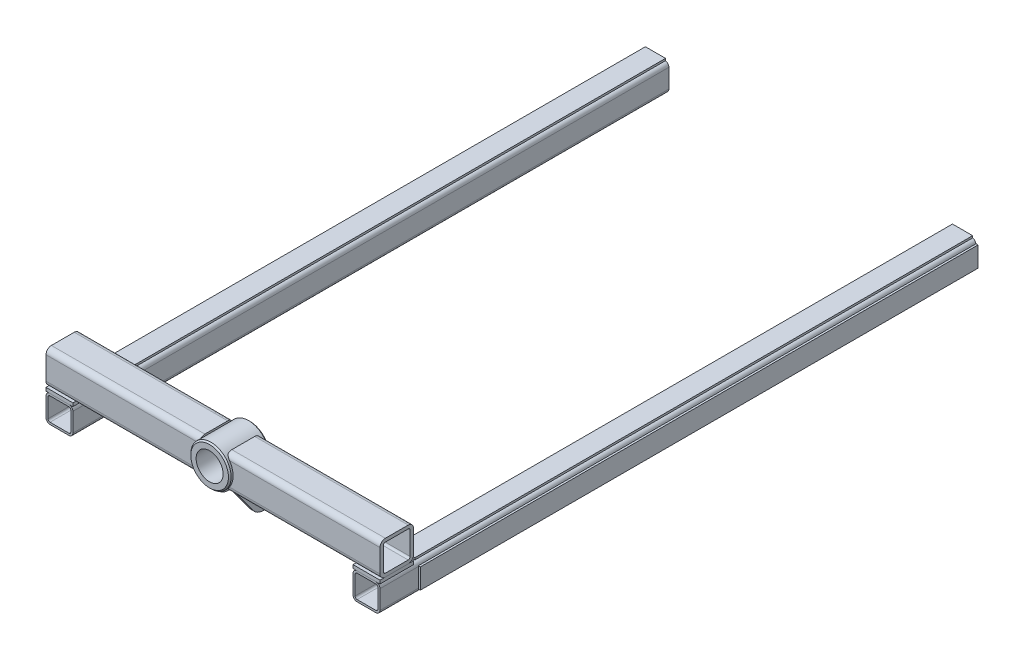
ISO-10303-21;
HEADER;
FILE_DESCRIPTION(('STEP AP214'),'2;1');
FILE_NAME('part.step','',(''),(''),'','','');
FILE_SCHEMA(('AUTOMOTIVE_DESIGN { 1 0 10303 214 1 1 1 1 }'));
ENDSEC;
DATA;
#1=APPLICATION_CONTEXT('core data for automotive mechanical design processes');
#2=APPLICATION_PROTOCOL_DEFINITION('international standard','automotive_design',2000,#1);
#3=PRODUCT_CONTEXT('',#1,'mechanical');
#4=PRODUCT('Part','Part','',(#3));
#5=PRODUCT_RELATED_PRODUCT_CATEGORY('part','',(#4));
#6=PRODUCT_DEFINITION_FORMATION('','',#4);
#7=PRODUCT_DEFINITION_CONTEXT('part definition',#1,'design');
#8=PRODUCT_DEFINITION('design','',#6,#7);
#9=PRODUCT_DEFINITION_SHAPE('','',#8);
#10=(LENGTH_UNIT() NAMED_UNIT(*) SI_UNIT(.MILLI.,.METRE.));
#11=(NAMED_UNIT(*) PLANE_ANGLE_UNIT() SI_UNIT($,.RADIAN.));
#12=(NAMED_UNIT(*) SI_UNIT($,.STERADIAN.) SOLID_ANGLE_UNIT());
#13=UNCERTAINTY_MEASURE_WITH_UNIT(LENGTH_MEASURE(1.E-05),#10,'distance_accuracy_value','');
#14=(GEOMETRIC_REPRESENTATION_CONTEXT(3) GLOBAL_UNCERTAINTY_ASSIGNED_CONTEXT((#13)) GLOBAL_UNIT_ASSIGNED_CONTEXT((#10,
#11,#12)) REPRESENTATION_CONTEXT('',''));
#15=CARTESIAN_POINT('',(0.,0.,0.));
#16=DIRECTION('',(0.,0.,1.));
#17=DIRECTION('',(1.,0.,0.));
#18=AXIS2_PLACEMENT_3D('',#15,#16,#17);
#19=CARTESIAN_POINT('',(23.,-50.,-20.6777472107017));
#20=DIRECTION('',(-1.,0.,0.));
#21=DIRECTION('',(0.,0.,1.));
#22=AXIS2_PLACEMENT_3D('',#19,#20,#21);
#23=PLANE('',#22);
#24=CARTESIAN_POINT('',(23.,-50.,-20.6777472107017));
#25=DIRECTION('',(-1.,0.,0.));
#26=DIRECTION('',(0.,0.,1.));
#27=AXIS2_PLACEMENT_3D('',#24,#25,#26);
#28=CIRCLE('',#27,18.);
#29=CARTESIAN_POINT('',(23.,-41.3732742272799,-36.475835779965));
#30=VERTEX_POINT('',#29);
#31=CARTESIAN_POINT('',(23.,-60.6029589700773,-6.13205159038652));
#32=VERTEX_POINT('',#31);
#33=EDGE_CURVE('E131',#30,#32,#28,.T.);
#34=ORIENTED_EDGE('',*,*,#33,.T.);
#35=DIRECTION('',(0.,0.808094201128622,0.589053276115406));
#36=VECTOR('',#35,1.);
#37=CARTESIAN_POINT('',(23.,-23.9,20.6222527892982));
#38=LINE('',#37,#36);
#39=CARTESIAN_POINT('',(23.,-23.9,20.6222527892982));
#40=VERTEX_POINT('',#39);
#41=EDGE_CURVE('E112',#32,#40,#38,.T.);
#42=ORIENTED_EDGE('',*,*,#41,.T.);
#43=CARTESIAN_POINT('',(23.,-15.5,16.1849112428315));
#44=DIRECTION('',(1.,0.,0.));
#45=DIRECTION('',(0.,0.,1.));
#46=AXIS2_PLACEMENT_3D('',#43,#44,#45);
#47=CIRCLE('',#46,9.5);
#48=CARTESIAN_POINT('',(23.,-25.,16.1849112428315));
#49=VERTEX_POINT('',#48);
#50=EDGE_CURVE('E134',#40,#49,#47,.T.);
#51=ORIENTED_EDGE('',*,*,#50,.T.);
#52=DIRECTION('',(0.,0.,-1.));
#53=VECTOR('',#52,1.);
#54=CARTESIAN_POINT('',(23.,-25.,-17.));
#55=LINE('',#54,#53);
#56=CARTESIAN_POINT('',(23.,-25.,-17.));
#57=VERTEX_POINT('',#56);
#58=EDGE_CURVE('E136',#49,#57,#55,.T.);
#59=ORIENTED_EDGE('',*,*,#58,.T.);
#60=CARTESIAN_POINT('',(23.,-15.5,-17.));
#61=DIRECTION('',(1.,0.,0.));
#62=DIRECTION('',(0.,0.,1.));
#63=AXIS2_PLACEMENT_3D('',#60,#61,#62);
#64=CIRCLE('',#63,9.5);
#65=CARTESIAN_POINT('',(23.,-20.5,-25.0777472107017));
#66=VERTEX_POINT('',#65);
#67=EDGE_CURVE('E65',#57,#66,#64,.T.);
#68=ORIENTED_EDGE('',*,*,#67,.T.);
#69=DIRECTION('',(0.,-0.877671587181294,-0.479262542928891));
#70=VECTOR('',#69,1.);
#71=CARTESIAN_POINT('',(23.,-41.3732742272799,-36.475835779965));
#72=LINE('',#71,#70);
#73=EDGE_CURVE('E60',#66,#30,#72,.T.);
#74=ORIENTED_EDGE('',*,*,#73,.T.);
#75=EDGE_LOOP('',(#34,#42,#51,#59,#68,#74));
#76=FACE_BOUND('',#75,.T.);
#77=CARTESIAN_POINT('',(23.,-50.,-20.6777472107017));
#78=DIRECTION('',(-1.,0.,0.));
#79=DIRECTION('',(0.,0.,1.));
#80=AXIS2_PLACEMENT_3D('',#77,#78,#79);
#81=CIRCLE('',#80,10.2);
#82=CARTESIAN_POINT('',(23.,-50.,-10.4777472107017));
#83=VERTEX_POINT('',#82);
#84=EDGE_CURVE('E117',#83,#83,#81,.T.);
#85=ORIENTED_EDGE('',*,*,#84,.F.);
#86=EDGE_LOOP('',(#85));
#87=FACE_BOUND('',#86,.T.);
#88=ADVANCED_FACE('F45',(#76,#87),#23,.T.);
#89=CARTESIAN_POINT('',(29.,-50.,-20.6777472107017));
#90=DIRECTION('',(-1.,0.,0.));
#91=DIRECTION('',(0.,0.,1.));
#92=AXIS2_PLACEMENT_3D('',#89,#90,#91);
#93=PLANE('',#92);
#94=CARTESIAN_POINT('',(29.,-50.,-20.6777472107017));
#95=DIRECTION('',(-1.,0.,0.));
#96=DIRECTION('',(0.,0.,1.));
#97=AXIS2_PLACEMENT_3D('',#94,#95,#96);
#98=CIRCLE('',#97,18.);
#99=CARTESIAN_POINT('',(29.,-41.3732742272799,-36.475835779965));
#100=VERTEX_POINT('',#99);
#101=CARTESIAN_POINT('',(29.,-60.6029589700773,-6.13205159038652));
#102=VERTEX_POINT('',#101);
#103=EDGE_CURVE('E103',#100,#102,#98,.T.);
#104=ORIENTED_EDGE('',*,*,#103,.F.);
#105=DIRECTION('',(0.,-0.877671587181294,-0.479262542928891));
#106=VECTOR('',#105,1.);
#107=CARTESIAN_POINT('',(29.,-41.3732742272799,-36.475835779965));
#108=LINE('',#107,#106);
#109=CARTESIAN_POINT('',(29.,-20.5,-25.0777472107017));
#110=VERTEX_POINT('',#109);
#111=EDGE_CURVE('E129',#110,#100,#108,.T.);
#112=ORIENTED_EDGE('',*,*,#111,.F.);
#113=CARTESIAN_POINT('',(29.,-15.5,-17.));
#114=DIRECTION('',(1.,0.,0.));
#115=DIRECTION('',(0.,0.,1.));
#116=AXIS2_PLACEMENT_3D('',#113,#114,#115);
#117=CIRCLE('',#116,9.5);
#118=CARTESIAN_POINT('',(29.,-25.,-17.));
#119=VERTEX_POINT('',#118);
#120=EDGE_CURVE('E127',#119,#110,#117,.T.);
#121=ORIENTED_EDGE('',*,*,#120,.F.);
#122=DIRECTION('',(0.,0.,-1.));
#123=VECTOR('',#122,1.);
#124=CARTESIAN_POINT('',(29.,-25.,-17.));
#125=LINE('',#124,#123);
#126=CARTESIAN_POINT('',(29.,-25.,16.1849112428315));
#127=VERTEX_POINT('',#126);
#128=EDGE_CURVE('E125',#127,#119,#125,.T.);
#129=ORIENTED_EDGE('',*,*,#128,.F.);
#130=CARTESIAN_POINT('',(29.,-15.5,16.1849112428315));
#131=DIRECTION('',(1.,0.,0.));
#132=DIRECTION('',(0.,0.,1.));
#133=AXIS2_PLACEMENT_3D('',#130,#131,#132);
#134=CIRCLE('',#133,9.5);
#135=CARTESIAN_POINT('',(29.,-23.9,20.6222527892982));
#136=VERTEX_POINT('',#135);
#137=EDGE_CURVE('E105',#136,#127,#134,.T.);
#138=ORIENTED_EDGE('',*,*,#137,.F.);
#139=DIRECTION('',(0.,0.808094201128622,0.589053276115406));
#140=VECTOR('',#139,1.);
#141=CARTESIAN_POINT('',(29.,-23.9,20.6222527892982));
#142=LINE('',#141,#140);
#143=EDGE_CURVE('E98',#102,#136,#142,.T.);
#144=ORIENTED_EDGE('',*,*,#143,.F.);
#145=EDGE_LOOP('',(#104,#112,#121,#129,#138,#144));
#146=FACE_BOUND('',#145,.T.);
#147=CARTESIAN_POINT('',(29.,-50.,-20.6777472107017));
#148=DIRECTION('',(-1.,0.,0.));
#149=DIRECTION('',(0.,0.,1.));
#150=AXIS2_PLACEMENT_3D('',#147,#148,#149);
#151=CIRCLE('',#150,10.2);
#152=CARTESIAN_POINT('',(29.,-50.,-10.4777472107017));
#153=VERTEX_POINT('',#152);
#154=EDGE_CURVE('E120',#153,#153,#151,.T.);
#155=ORIENTED_EDGE('',*,*,#154,.T.);
#156=EDGE_LOOP('',(#155));
#157=FACE_BOUND('',#156,.T.);
#158=ADVANCED_FACE('F99',(#146,#157),#93,.F.);
#159=CARTESIAN_POINT('',(23.,-50.,-20.6777472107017));
#160=DIRECTION('',(1.,0.,0.));
#161=DIRECTION('',(0.,0.,-1.));
#162=AXIS2_PLACEMENT_3D('',#159,#160,#161);
#163=CYLINDRICAL_SURFACE('',#162,18.);
#164=ORIENTED_EDGE('',*,*,#103,.T.);
#165=DIRECTION('',(1.,0.,0.));
#166=VECTOR('',#165,1.);
#167=CARTESIAN_POINT('',(23.,-60.6029589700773,-6.13205159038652));
#168=LINE('',#167,#166);
#169=EDGE_CURVE('E12',#32,#102,#168,.T.);
#170=ORIENTED_EDGE('',*,*,#169,.F.);
#171=ORIENTED_EDGE('',*,*,#33,.F.);
#172=DIRECTION('',(1.,0.,0.));
#173=VECTOR('',#172,1.);
#174=CARTESIAN_POINT('',(23.,-41.3732742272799,-36.475835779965));
#175=LINE('',#174,#173);
#176=EDGE_CURVE('E116',#30,#100,#175,.T.);
#177=ORIENTED_EDGE('',*,*,#176,.T.);
#178=EDGE_LOOP('',(#164,#170,#171,#177));
#179=FACE_BOUND('',#178,.T.);
#180=ADVANCED_FACE('F47',(#179),#163,.T.);
#181=CARTESIAN_POINT('',(23.,-23.9,20.6222527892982));
#182=DIRECTION('',(0.,0.589053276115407,-0.808094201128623));
#183=DIRECTION('',(0.,-0.808094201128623,-0.589053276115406));
#184=AXIS2_PLACEMENT_3D('',#181,#182,#183);
#185=PLANE('',#184);
#186=ORIENTED_EDGE('',*,*,#143,.T.);
#187=DIRECTION('',(1.,0.,0.));
#188=VECTOR('',#187,1.);
#189=CARTESIAN_POINT('',(23.,-23.9,20.6222527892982));
#190=LINE('',#189,#188);
#191=EDGE_CURVE('E53',#40,#136,#190,.T.);
#192=ORIENTED_EDGE('',*,*,#191,.F.);
#193=ORIENTED_EDGE('',*,*,#41,.F.);
#194=ORIENTED_EDGE('',*,*,#169,.T.);
#195=EDGE_LOOP('',(#186,#192,#193,#194));
#196=FACE_BOUND('',#195,.T.);
#197=ADVANCED_FACE('F111',(#196),#185,.F.);
#198=CARTESIAN_POINT('',(23.,-15.5,16.1849112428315));
#199=DIRECTION('',(1.,0.,0.));
#200=DIRECTION('',(0.,0.,-1.));
#201=AXIS2_PLACEMENT_3D('',#198,#199,#200);
#202=CYLINDRICAL_SURFACE('',#201,9.5);
#203=ORIENTED_EDGE('',*,*,#137,.T.);
#204=DIRECTION('',(1.,0.,0.));
#205=VECTOR('',#204,1.);
#206=CARTESIAN_POINT('',(23.,-25.,16.1849112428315));
#207=LINE('',#206,#205);
#208=EDGE_CURVE('E147',#49,#127,#207,.T.);
#209=ORIENTED_EDGE('',*,*,#208,.F.);
#210=ORIENTED_EDGE('',*,*,#50,.F.);
#211=ORIENTED_EDGE('',*,*,#191,.T.);
#212=EDGE_LOOP('',(#203,#209,#210,#211));
#213=FACE_BOUND('',#212,.T.);
#214=ADVANCED_FACE('F151',(#213),#202,.F.);
#215=CARTESIAN_POINT('',(23.,-25.,-17.));
#216=DIRECTION('',(0.,-1.,0.));
#217=DIRECTION('',(0.,0.,1.));
#218=AXIS2_PLACEMENT_3D('',#215,#216,#217);
#219=PLANE('',#218);
#220=ORIENTED_EDGE('',*,*,#128,.T.);
#221=DIRECTION('',(1.,0.,0.));
#222=VECTOR('',#221,1.);
#223=CARTESIAN_POINT('',(23.,-25.,-17.));
#224=LINE('',#223,#222);
#225=EDGE_CURVE('E144',#57,#119,#224,.T.);
#226=ORIENTED_EDGE('',*,*,#225,.F.);
#227=ORIENTED_EDGE('',*,*,#58,.F.);
#228=ORIENTED_EDGE('',*,*,#208,.T.);
#229=EDGE_LOOP('',(#220,#226,#227,#228));
#230=FACE_BOUND('',#229,.T.);
#231=ADVANCED_FACE('F157',(#230),#219,.F.);
#232=CARTESIAN_POINT('',(23.,-15.5,-17.));
#233=DIRECTION('',(1.,0.,0.));
#234=DIRECTION('',(0.,0.,-1.));
#235=AXIS2_PLACEMENT_3D('',#232,#233,#234);
#236=CYLINDRICAL_SURFACE('',#235,9.5);
#237=ORIENTED_EDGE('',*,*,#120,.T.);
#238=DIRECTION('',(1.,0.,0.));
#239=VECTOR('',#238,1.);
#240=CARTESIAN_POINT('',(23.,-20.5,-25.0777472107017));
#241=LINE('',#240,#239);
#242=EDGE_CURVE('E141',#66,#110,#241,.T.);
#243=ORIENTED_EDGE('',*,*,#242,.F.);
#244=ORIENTED_EDGE('',*,*,#67,.F.);
#245=ORIENTED_EDGE('',*,*,#225,.T.);
#246=EDGE_LOOP('',(#237,#243,#244,#245));
#247=FACE_BOUND('',#246,.T.);
#248=ADVANCED_FACE('F160',(#247),#236,.F.);
#249=CARTESIAN_POINT('',(23.,-41.3732742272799,-36.475835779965));
#250=DIRECTION('',(0.,-0.479262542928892,0.877671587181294));
#251=DIRECTION('',(0.,0.877671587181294,0.479262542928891));
#252=AXIS2_PLACEMENT_3D('',#249,#250,#251);
#253=PLANE('',#252);
#254=ORIENTED_EDGE('',*,*,#111,.T.);
#255=ORIENTED_EDGE('',*,*,#176,.F.);
#256=ORIENTED_EDGE('',*,*,#73,.F.);
#257=ORIENTED_EDGE('',*,*,#242,.T.);
#258=EDGE_LOOP('',(#254,#255,#256,#257));
#259=FACE_BOUND('',#258,.T.);
#260=ADVANCED_FACE('F162',(#259),#253,.F.);
#261=CARTESIAN_POINT('',(23.,-50.,-20.6777472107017));
#262=DIRECTION('',(1.,0.,0.));
#263=DIRECTION('',(0.,0.,-1.));
#264=AXIS2_PLACEMENT_3D('',#261,#262,#263);
#265=CYLINDRICAL_SURFACE('',#264,10.2);
#266=ORIENTED_EDGE('',*,*,#84,.T.);
#267=EDGE_LOOP('',(#266));
#268=FACE_BOUND('',#267,.T.);
#269=ORIENTED_EDGE('',*,*,#154,.F.);
#270=EDGE_LOOP('',(#269));
#271=FACE_BOUND('',#270,.T.);
#272=ADVANCED_FACE('F164',(#268,#271),#265,.F.);
#273=CLOSED_SHELL('',(#88,#158,#180,#197,#214,#231,#248,#260,#272));
#274=MANIFOLD_SOLID_BREP('B2',#273);
#275=CARTESIAN_POINT('',(-28.9999999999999,-50.,-20.6777472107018));
#276=DIRECTION('',(-1.,0.,0.));
#277=DIRECTION('',(0.,0.,1.));
#278=AXIS2_PLACEMENT_3D('',#275,#276,#277);
#279=PLANE('',#278);
#280=CARTESIAN_POINT('',(-28.9999999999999,-50.,-20.6777472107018));
#281=DIRECTION('',(-1.,0.,0.));
#282=DIRECTION('',(0.,0.,1.));
#283=AXIS2_PLACEMENT_3D('',#280,#281,#282);
#284=CIRCLE('',#283,18.);
#285=CARTESIAN_POINT('',(-28.9999999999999,-41.3732742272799,-36.4758357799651));
#286=VERTEX_POINT('',#285);
#287=CARTESIAN_POINT('',(-28.9999999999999,-60.6029589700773,-6.13205159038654));
#288=VERTEX_POINT('',#287);
#289=EDGE_CURVE('E337',#286,#288,#284,.T.);
#290=ORIENTED_EDGE('',*,*,#289,.T.);
#291=DIRECTION('',(0.,0.808094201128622,0.589053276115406));
#292=VECTOR('',#291,1.);
#293=CARTESIAN_POINT('',(-28.9999999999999,-23.8999999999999,20.6222527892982));
#294=LINE('',#293,#292);
#295=CARTESIAN_POINT('',(-28.9999999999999,-23.8999999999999,20.6222527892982));
#296=VERTEX_POINT('',#295);
#297=EDGE_CURVE('E318',#288,#296,#294,.T.);
#298=ORIENTED_EDGE('',*,*,#297,.T.);
#299=CARTESIAN_POINT('',(-28.9999999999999,-15.4999999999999,16.1849112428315));
#300=DIRECTION('',(1.,0.,0.));
#301=DIRECTION('',(0.,0.,1.));
#302=AXIS2_PLACEMENT_3D('',#299,#300,#301);
#303=CIRCLE('',#302,9.5);
#304=CARTESIAN_POINT('',(-28.9999999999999,-24.9999999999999,16.1849112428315));
#305=VERTEX_POINT('',#304);
#306=EDGE_CURVE('E340',#296,#305,#303,.T.);
#307=ORIENTED_EDGE('',*,*,#306,.T.);
#308=DIRECTION('',(0.,0.,-1.));
#309=VECTOR('',#308,1.);
#310=CARTESIAN_POINT('',(-28.9999999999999,-24.9999999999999,-17.));
#311=LINE('',#310,#309);
#312=CARTESIAN_POINT('',(-28.9999999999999,-24.9999999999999,-17.));
#313=VERTEX_POINT('',#312);
#314=EDGE_CURVE('E342',#305,#313,#311,.T.);
#315=ORIENTED_EDGE('',*,*,#314,.T.);
#316=CARTESIAN_POINT('',(-28.9999999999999,-15.4999999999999,-17.));
#317=DIRECTION('',(1.,0.,0.));
#318=DIRECTION('',(0.,0.,1.));
#319=AXIS2_PLACEMENT_3D('',#316,#317,#318);
#320=CIRCLE('',#319,9.5);
#321=CARTESIAN_POINT('',(-28.9999999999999,-20.4999999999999,-25.0777472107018));
#322=VERTEX_POINT('',#321);
#323=EDGE_CURVE('E271',#313,#322,#320,.T.);
#324=ORIENTED_EDGE('',*,*,#323,.T.);
#325=DIRECTION('',(0.,-0.877671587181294,-0.479262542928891));
#326=VECTOR('',#325,1.);
#327=CARTESIAN_POINT('',(-28.9999999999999,-41.3732742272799,-36.4758357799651));
#328=LINE('',#327,#326);
#329=EDGE_CURVE('E266',#322,#286,#328,.T.);
#330=ORIENTED_EDGE('',*,*,#329,.T.);
#331=EDGE_LOOP('',(#290,#298,#307,#315,#324,#330));
#332=FACE_BOUND('',#331,.T.);
#333=CARTESIAN_POINT('',(-28.9999999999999,-50.,-20.6777472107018));
#334=DIRECTION('',(-1.,0.,0.));
#335=DIRECTION('',(0.,0.,1.));
#336=AXIS2_PLACEMENT_3D('',#333,#334,#335);
#337=CIRCLE('',#336,10.2);
#338=CARTESIAN_POINT('',(-28.9999999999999,-50.,-10.4777472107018));
#339=VERTEX_POINT('',#338);
#340=EDGE_CURVE('E323',#339,#339,#337,.T.);
#341=ORIENTED_EDGE('',*,*,#340,.F.);
#342=EDGE_LOOP('',(#341));
#343=FACE_BOUND('',#342,.T.);
#344=ADVANCED_FACE('F251',(#332,#343),#279,.T.);
#345=CARTESIAN_POINT('',(-22.9999999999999,-50.,-20.6777472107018));
#346=DIRECTION('',(-1.,0.,0.));
#347=DIRECTION('',(0.,0.,1.));
#348=AXIS2_PLACEMENT_3D('',#345,#346,#347);
#349=PLANE('',#348);
#350=CARTESIAN_POINT('',(-22.9999999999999,-50.,-20.6777472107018));
#351=DIRECTION('',(-1.,0.,0.));
#352=DIRECTION('',(0.,0.,1.));
#353=AXIS2_PLACEMENT_3D('',#350,#351,#352);
#354=CIRCLE('',#353,18.);
#355=CARTESIAN_POINT('',(-22.9999999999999,-41.3732742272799,-36.4758357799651));
#356=VERTEX_POINT('',#355);
#357=CARTESIAN_POINT('',(-22.9999999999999,-60.6029589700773,-6.13205159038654));
#358=VERTEX_POINT('',#357);
#359=EDGE_CURVE('E309',#356,#358,#354,.T.);
#360=ORIENTED_EDGE('',*,*,#359,.F.);
#361=DIRECTION('',(0.,-0.877671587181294,-0.479262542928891));
#362=VECTOR('',#361,1.);
#363=CARTESIAN_POINT('',(-22.9999999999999,-41.3732742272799,-36.4758357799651));
#364=LINE('',#363,#362);
#365=CARTESIAN_POINT('',(-22.9999999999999,-20.4999999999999,-25.0777472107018));
#366=VERTEX_POINT('',#365);
#367=EDGE_CURVE('E335',#366,#356,#364,.T.);
#368=ORIENTED_EDGE('',*,*,#367,.F.);
#369=CARTESIAN_POINT('',(-22.9999999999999,-15.4999999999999,-17.));
#370=DIRECTION('',(1.,0.,0.));
#371=DIRECTION('',(0.,0.,1.));
#372=AXIS2_PLACEMENT_3D('',#369,#370,#371);
#373=CIRCLE('',#372,9.5);
#374=CARTESIAN_POINT('',(-22.9999999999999,-24.9999999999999,-17.));
#375=VERTEX_POINT('',#374);
#376=EDGE_CURVE('E333',#375,#366,#373,.T.);
#377=ORIENTED_EDGE('',*,*,#376,.F.);
#378=DIRECTION('',(0.,0.,-1.));
#379=VECTOR('',#378,1.);
#380=CARTESIAN_POINT('',(-22.9999999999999,-24.9999999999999,-17.));
#381=LINE('',#380,#379);
#382=CARTESIAN_POINT('',(-22.9999999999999,-24.9999999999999,16.1849112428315));
#383=VERTEX_POINT('',#382);
#384=EDGE_CURVE('E331',#383,#375,#381,.T.);
#385=ORIENTED_EDGE('',*,*,#384,.F.);
#386=CARTESIAN_POINT('',(-22.9999999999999,-15.4999999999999,16.1849112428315));
#387=DIRECTION('',(1.,0.,0.));
#388=DIRECTION('',(0.,0.,1.));
#389=AXIS2_PLACEMENT_3D('',#386,#387,#388);
#390=CIRCLE('',#389,9.5);
#391=CARTESIAN_POINT('',(-22.9999999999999,-23.8999999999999,20.6222527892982));
#392=VERTEX_POINT('',#391);
#393=EDGE_CURVE('E311',#392,#383,#390,.T.);
#394=ORIENTED_EDGE('',*,*,#393,.F.);
#395=DIRECTION('',(0.,0.808094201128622,0.589053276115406));
#396=VECTOR('',#395,1.);
#397=CARTESIAN_POINT('',(-22.9999999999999,-23.8999999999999,20.6222527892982));
#398=LINE('',#397,#396);
#399=EDGE_CURVE('E304',#358,#392,#398,.T.);
#400=ORIENTED_EDGE('',*,*,#399,.F.);
#401=EDGE_LOOP('',(#360,#368,#377,#385,#394,#400));
#402=FACE_BOUND('',#401,.T.);
#403=CARTESIAN_POINT('',(-22.9999999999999,-50.,-20.6777472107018));
#404=DIRECTION('',(-1.,0.,0.));
#405=DIRECTION('',(0.,0.,1.));
#406=AXIS2_PLACEMENT_3D('',#403,#404,#405);
#407=CIRCLE('',#406,10.2);
#408=CARTESIAN_POINT('',(-22.9999999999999,-50.,-10.4777472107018));
#409=VERTEX_POINT('',#408);
#410=EDGE_CURVE('E326',#409,#409,#407,.T.);
#411=ORIENTED_EDGE('',*,*,#410,.T.);
#412=EDGE_LOOP('',(#411));
#413=FACE_BOUND('',#412,.T.);
#414=ADVANCED_FACE('F305',(#402,#413),#349,.F.);
#415=CARTESIAN_POINT('',(-28.9999999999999,-50.,-20.6777472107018));
#416=DIRECTION('',(1.,0.,0.));
#417=DIRECTION('',(0.,0.,-1.));
#418=AXIS2_PLACEMENT_3D('',#415,#416,#417);
#419=CYLINDRICAL_SURFACE('',#418,18.);
#420=ORIENTED_EDGE('',*,*,#359,.T.);
#421=DIRECTION('',(1.,0.,0.));
#422=VECTOR('',#421,1.);
#423=CARTESIAN_POINT('',(-28.9999999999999,-60.6029589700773,-6.13205159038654));
#424=LINE('',#423,#422);
#425=EDGE_CURVE('E43',#288,#358,#424,.T.);
#426=ORIENTED_EDGE('',*,*,#425,.F.);
#427=ORIENTED_EDGE('',*,*,#289,.F.);
#428=DIRECTION('',(1.,0.,0.));
#429=VECTOR('',#428,1.);
#430=CARTESIAN_POINT('',(-28.9999999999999,-41.3732742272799,-36.4758357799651));
#431=LINE('',#430,#429);
#432=EDGE_CURVE('E322',#286,#356,#431,.T.);
#433=ORIENTED_EDGE('',*,*,#432,.T.);
#434=EDGE_LOOP('',(#420,#426,#427,#433));
#435=FACE_BOUND('',#434,.T.);
#436=ADVANCED_FACE('F253',(#435),#419,.T.);
#437=CARTESIAN_POINT('',(-28.9999999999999,-23.8999999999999,20.6222527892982));
#438=DIRECTION('',(0.,0.589053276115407,-0.808094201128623));
#439=DIRECTION('',(0.,-0.808094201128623,-0.589053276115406));
#440=AXIS2_PLACEMENT_3D('',#437,#438,#439);
#441=PLANE('',#440);
#442=ORIENTED_EDGE('',*,*,#399,.T.);
#443=DIRECTION('',(1.,0.,0.));
#444=VECTOR('',#443,1.);
#445=CARTESIAN_POINT('',(-28.9999999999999,-23.8999999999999,20.6222527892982));
#446=LINE('',#445,#444);
#447=EDGE_CURVE('E259',#296,#392,#446,.T.);
#448=ORIENTED_EDGE('',*,*,#447,.F.);
#449=ORIENTED_EDGE('',*,*,#297,.F.);
#450=ORIENTED_EDGE('',*,*,#425,.T.);
#451=EDGE_LOOP('',(#442,#448,#449,#450));
#452=FACE_BOUND('',#451,.T.);
#453=ADVANCED_FACE('F317',(#452),#441,.F.);
#454=CARTESIAN_POINT('',(-28.9999999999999,-15.4999999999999,16.1849112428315));
#455=DIRECTION('',(1.,0.,0.));
#456=DIRECTION('',(0.,0.,-1.));
#457=AXIS2_PLACEMENT_3D('',#454,#455,#456);
#458=CYLINDRICAL_SURFACE('',#457,9.5);
#459=ORIENTED_EDGE('',*,*,#393,.T.);
#460=DIRECTION('',(1.,0.,0.));
#461=VECTOR('',#460,1.);
#462=CARTESIAN_POINT('',(-28.9999999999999,-24.9999999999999,16.1849112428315));
#463=LINE('',#462,#461);
#464=EDGE_CURVE('E353',#305,#383,#463,.T.);
#465=ORIENTED_EDGE('',*,*,#464,.F.);
#466=ORIENTED_EDGE('',*,*,#306,.F.);
#467=ORIENTED_EDGE('',*,*,#447,.T.);
#468=EDGE_LOOP('',(#459,#465,#466,#467));
#469=FACE_BOUND('',#468,.T.);
#470=ADVANCED_FACE('F357',(#469),#458,.F.);
#471=CARTESIAN_POINT('',(-28.9999999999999,-24.9999999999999,-17.));
#472=DIRECTION('',(0.,-1.,0.));
#473=DIRECTION('',(0.,0.,1.));
#474=AXIS2_PLACEMENT_3D('',#471,#472,#473);
#475=PLANE('',#474);
#476=ORIENTED_EDGE('',*,*,#384,.T.);
#477=DIRECTION('',(1.,0.,0.));
#478=VECTOR('',#477,1.);
#479=CARTESIAN_POINT('',(-28.9999999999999,-24.9999999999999,-17.));
#480=LINE('',#479,#478);
#481=EDGE_CURVE('E350',#313,#375,#480,.T.);
#482=ORIENTED_EDGE('',*,*,#481,.F.);
#483=ORIENTED_EDGE('',*,*,#314,.F.);
#484=ORIENTED_EDGE('',*,*,#464,.T.);
#485=EDGE_LOOP('',(#476,#482,#483,#484));
#486=FACE_BOUND('',#485,.T.);
#487=ADVANCED_FACE('F363',(#486),#475,.F.);
#488=CARTESIAN_POINT('',(-28.9999999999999,-15.4999999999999,-17.));
#489=DIRECTION('',(1.,0.,0.));
#490=DIRECTION('',(0.,0.,-1.));
#491=AXIS2_PLACEMENT_3D('',#488,#489,#490);
#492=CYLINDRICAL_SURFACE('',#491,9.5);
#493=ORIENTED_EDGE('',*,*,#376,.T.);
#494=DIRECTION('',(1.,0.,0.));
#495=VECTOR('',#494,1.);
#496=CARTESIAN_POINT('',(-28.9999999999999,-20.4999999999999,-25.0777472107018));
#497=LINE('',#496,#495);
#498=EDGE_CURVE('E347',#322,#366,#497,.T.);
#499=ORIENTED_EDGE('',*,*,#498,.F.);
#500=ORIENTED_EDGE('',*,*,#323,.F.);
#501=ORIENTED_EDGE('',*,*,#481,.T.);
#502=EDGE_LOOP('',(#493,#499,#500,#501));
#503=FACE_BOUND('',#502,.T.);
#504=ADVANCED_FACE('F366',(#503),#492,.F.);
#505=CARTESIAN_POINT('',(-28.9999999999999,-41.3732742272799,-36.4758357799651));
#506=DIRECTION('',(0.,-0.479262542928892,0.877671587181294));
#507=DIRECTION('',(0.,0.877671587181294,0.479262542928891));
#508=AXIS2_PLACEMENT_3D('',#505,#506,#507);
#509=PLANE('',#508);
#510=ORIENTED_EDGE('',*,*,#367,.T.);
#511=ORIENTED_EDGE('',*,*,#432,.F.);
#512=ORIENTED_EDGE('',*,*,#329,.F.);
#513=ORIENTED_EDGE('',*,*,#498,.T.);
#514=EDGE_LOOP('',(#510,#511,#512,#513));
#515=FACE_BOUND('',#514,.T.);
#516=ADVANCED_FACE('F368',(#515),#509,.F.);
#517=CARTESIAN_POINT('',(-28.9999999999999,-50.,-20.6777472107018));
#518=DIRECTION('',(1.,0.,0.));
#519=DIRECTION('',(0.,0.,-1.));
#520=AXIS2_PLACEMENT_3D('',#517,#518,#519);
#521=CYLINDRICAL_SURFACE('',#520,10.2);
#522=ORIENTED_EDGE('',*,*,#340,.T.);
#523=EDGE_LOOP('',(#522));
#524=FACE_BOUND('',#523,.T.);
#525=ORIENTED_EDGE('',*,*,#410,.F.);
#526=EDGE_LOOP('',(#525));
#527=FACE_BOUND('',#526,.T.);
#528=ADVANCED_FACE('F370',(#524,#527),#521,.F.);
#529=CLOSED_SHELL('',(#344,#414,#436,#453,#470,#487,#504,#516,#528));
#530=MANIFOLD_SOLID_BREP('B6',#529);
#531=CARTESIAN_POINT('',(248.5,-35.,-32.));
#532=DIRECTION('',(0.,-1.,0.));
#533=DIRECTION('',(0.,0.,-1.));
#534=AXIS2_PLACEMENT_3D('',#531,#532,#533);
#535=PLANE('',#534);
#536=DIRECTION('',(1.,0.,0.));
#537=VECTOR('',#536,1.);
#538=CARTESIAN_POINT('',(248.5,-35.,-862.));
#539=LINE('',#538,#537);
#540=CARTESIAN_POINT('',(248.5,-35.,-862.));
#541=VERTEX_POINT('',#540);
#542=CARTESIAN_POINT('',(251.5,-35.,-862.));
#543=VERTEX_POINT('',#542);
#544=EDGE_CURVE('E505',#541,#543,#539,.T.);
#545=ORIENTED_EDGE('',*,*,#544,.F.);
#546=DIRECTION('',(0.,0.,-1.));
#547=VECTOR('',#546,1.);
#548=CARTESIAN_POINT('',(248.5,-35.,-32.));
#549=LINE('',#548,#547);
#550=CARTESIAN_POINT('',(248.5,-35.,-32.));
#551=VERTEX_POINT('',#550);
#552=EDGE_CURVE('E524',#551,#541,#549,.T.);
#553=ORIENTED_EDGE('',*,*,#552,.F.);
#554=DIRECTION('',(1.,0.,0.));
#555=VECTOR('',#554,1.);
#556=CARTESIAN_POINT('',(248.5,-35.,-32.));
#557=LINE('',#556,#555);
#558=CARTESIAN_POINT('',(251.5,-35.,-32.));
#559=VERTEX_POINT('',#558);
#560=EDGE_CURVE('E510',#551,#559,#557,.T.);
#561=ORIENTED_EDGE('',*,*,#560,.T.);
#562=DIRECTION('',(0.,0.,-1.));
#563=VECTOR('',#562,1.);
#564=CARTESIAN_POINT('',(251.5,-35.,-32.));
#565=LINE('',#564,#563);
#566=EDGE_CURVE('E249',#559,#543,#565,.T.);
#567=ORIENTED_EDGE('',*,*,#566,.T.);
#568=EDGE_LOOP('',(#545,#553,#561,#567));
#569=FACE_BOUND('',#568,.T.);
#570=ADVANCED_FACE('F457',(#569),#535,.F.);
#571=CARTESIAN_POINT('',(251.5,-35.,-32.));
#572=DIRECTION('',(-1.,0.,0.));
#573=DIRECTION('',(0.,0.,-1.));
#574=AXIS2_PLACEMENT_3D('',#571,#572,#573);
#575=PLANE('',#574);
#576=DIRECTION('',(0.,-1.,0.));
#577=VECTOR('',#576,1.);
#578=CARTESIAN_POINT('',(251.5,-35.,-862.));
#579=LINE('',#578,#577);
#580=CARTESIAN_POINT('',(251.5,-65.,-862.));
#581=VERTEX_POINT('',#580);
#582=EDGE_CURVE('E496',#543,#581,#579,.T.);
#583=ORIENTED_EDGE('',*,*,#582,.F.);
#584=ORIENTED_EDGE('',*,*,#566,.F.);
#585=DIRECTION('',(0.,-1.,0.));
#586=VECTOR('',#585,1.);
#587=CARTESIAN_POINT('',(251.5,-35.,-32.));
#588=LINE('',#587,#586);
#589=CARTESIAN_POINT('',(251.5,-65.,-32.));
#590=VERTEX_POINT('',#589);
#591=EDGE_CURVE('E518',#559,#590,#588,.T.);
#592=ORIENTED_EDGE('',*,*,#591,.T.);
#593=DIRECTION('',(0.,0.,-1.));
#594=VECTOR('',#593,1.);
#595=CARTESIAN_POINT('',(251.5,-65.,-32.));
#596=LINE('',#595,#594);
#597=EDGE_CURVE('E464',#590,#581,#596,.T.);
#598=ORIENTED_EDGE('',*,*,#597,.T.);
#599=EDGE_LOOP('',(#583,#584,#592,#598));
#600=FACE_BOUND('',#599,.T.);
#601=ADVANCED_FACE('F497',(#600),#575,.F.);
#602=CARTESIAN_POINT('',(248.5,-65.,-32.));
#603=DIRECTION('',(0.,1.,0.));
#604=DIRECTION('',(0.,0.,1.));
#605=AXIS2_PLACEMENT_3D('',#602,#603,#604);
#606=PLANE('',#605);
#607=DIRECTION('',(-1.,0.,0.));
#608=VECTOR('',#607,1.);
#609=CARTESIAN_POINT('',(248.5,-65.,-862.));
#610=LINE('',#609,#608);
#611=CARTESIAN_POINT('',(248.5,-65.,-862.));
#612=VERTEX_POINT('',#611);
#613=EDGE_CURVE('E504',#581,#612,#610,.T.);
#614=ORIENTED_EDGE('',*,*,#613,.F.);
#615=ORIENTED_EDGE('',*,*,#597,.F.);
#616=DIRECTION('',(-1.,0.,0.));
#617=VECTOR('',#616,1.);
#618=CARTESIAN_POINT('',(248.5,-65.,-32.));
#619=LINE('',#618,#617);
#620=CARTESIAN_POINT('',(248.5,-65.,-32.));
#621=VERTEX_POINT('',#620);
#622=EDGE_CURVE('E520',#590,#621,#619,.T.);
#623=ORIENTED_EDGE('',*,*,#622,.T.);
#624=DIRECTION('',(0.,0.,-1.));
#625=VECTOR('',#624,1.);
#626=CARTESIAN_POINT('',(248.5,-65.,-32.));
#627=LINE('',#626,#625);
#628=EDGE_CURVE('E526',#621,#612,#627,.T.);
#629=ORIENTED_EDGE('',*,*,#628,.T.);
#630=EDGE_LOOP('',(#614,#615,#623,#629));
#631=FACE_BOUND('',#630,.T.);
#632=ADVANCED_FACE('F529',(#631),#606,.F.);
#633=CARTESIAN_POINT('',(248.5,-35.,-32.));
#634=DIRECTION('',(1.,0.,0.));
#635=DIRECTION('',(0.,0.,1.));
#636=AXIS2_PLACEMENT_3D('',#633,#634,#635);
#637=PLANE('',#636);
#638=DIRECTION('',(0.,1.,0.));
#639=VECTOR('',#638,1.);
#640=CARTESIAN_POINT('',(248.5,-35.,-862.));
#641=LINE('',#640,#639);
#642=EDGE_CURVE('E512',#612,#541,#641,.T.);
#643=ORIENTED_EDGE('',*,*,#642,.F.);
#644=ORIENTED_EDGE('',*,*,#628,.F.);
#645=DIRECTION('',(0.,1.,0.));
#646=VECTOR('',#645,1.);
#647=CARTESIAN_POINT('',(248.5,-35.,-32.));
#648=LINE('',#647,#646);
#649=EDGE_CURVE('E471',#621,#551,#648,.T.);
#650=ORIENTED_EDGE('',*,*,#649,.T.);
#651=ORIENTED_EDGE('',*,*,#552,.T.);
#652=EDGE_LOOP('',(#643,#644,#650,#651));
#653=FACE_BOUND('',#652,.T.);
#654=ADVANCED_FACE('F530',(#653),#637,.F.);
#655=CARTESIAN_POINT('',(251.5,-35.,-32.));
#656=DIRECTION('',(0.,0.,1.));
#657=DIRECTION('',(-1.,0.,0.));
#658=AXIS2_PLACEMENT_3D('',#655,#656,#657);
#659=PLANE('',#658);
#660=ORIENTED_EDGE('',*,*,#560,.F.);
#661=ORIENTED_EDGE('',*,*,#649,.F.);
#662=ORIENTED_EDGE('',*,*,#622,.F.);
#663=ORIENTED_EDGE('',*,*,#591,.F.);
#664=EDGE_LOOP('',(#660,#661,#662,#663));
#665=FACE_BOUND('',#664,.T.);
#666=ADVANCED_FACE('F532',(#665),#659,.T.);
#667=CARTESIAN_POINT('',(251.5,-35.,-862.));
#668=DIRECTION('',(0.,0.,1.));
#669=DIRECTION('',(-1.,0.,0.));
#670=AXIS2_PLACEMENT_3D('',#667,#668,#669);
#671=PLANE('',#670);
#672=ORIENTED_EDGE('',*,*,#544,.T.);
#673=ORIENTED_EDGE('',*,*,#582,.T.);
#674=ORIENTED_EDGE('',*,*,#613,.T.);
#675=ORIENTED_EDGE('',*,*,#642,.T.);
#676=EDGE_LOOP('',(#672,#673,#674,#675));
#677=FACE_BOUND('',#676,.T.);
#678=ADVANCED_FACE('F511',(#677),#671,.F.);
#679=CLOSED_SHELL('',(#570,#601,#632,#654,#666,#678));
#680=MANIFOLD_SOLID_BREP('B37',#679);
#681=CARTESIAN_POINT('',(243.5,-27.,-32.));
#682=DIRECTION('',(-1.,0.,0.));
#683=DIRECTION('',(0.,1.,0.));
#684=AXIS2_PLACEMENT_3D('',#681,#682,#683);
#685=PLANE('',#684);
#686=DIRECTION('',(0.,-1.,0.));
#687=VECTOR('',#686,1.);
#688=CARTESIAN_POINT('',(243.5,-27.,-862.));
#689=LINE('',#688,#687);
#690=CARTESIAN_POINT('',(243.5,-27.,-862.));
#691=VERTEX_POINT('',#690);
#692=CARTESIAN_POINT('',(243.5,-30.,-862.));
#693=VERTEX_POINT('',#692);
#694=EDGE_CURVE('E650',#691,#693,#689,.T.);
#695=ORIENTED_EDGE('',*,*,#694,.F.);
#696=DIRECTION('',(0.,0.,-1.));
#697=VECTOR('',#696,1.);
#698=CARTESIAN_POINT('',(243.5,-27.,-32.));
#699=LINE('',#698,#697);
#700=CARTESIAN_POINT('',(243.5,-27.,-32.));
#701=VERTEX_POINT('',#700);
#702=EDGE_CURVE('E669',#701,#691,#699,.T.);
#703=ORIENTED_EDGE('',*,*,#702,.F.);
#704=DIRECTION('',(0.,-1.,0.));
#705=VECTOR('',#704,1.);
#706=CARTESIAN_POINT('',(243.5,-27.,-32.));
#707=LINE('',#706,#705);
#708=CARTESIAN_POINT('',(243.5,-30.,-32.));
#709=VERTEX_POINT('',#708);
#710=EDGE_CURVE('E655',#701,#709,#707,.T.);
#711=ORIENTED_EDGE('',*,*,#710,.T.);
#712=DIRECTION('',(0.,0.,-1.));
#713=VECTOR('',#712,1.);
#714=CARTESIAN_POINT('',(243.5,-30.,-32.));
#715=LINE('',#714,#713);
#716=EDGE_CURVE('E455',#709,#693,#715,.T.);
#717=ORIENTED_EDGE('',*,*,#716,.T.);
#718=EDGE_LOOP('',(#695,#703,#711,#717));
#719=FACE_BOUND('',#718,.T.);
#720=ADVANCED_FACE('F602',(#719),#685,.F.);
#721=CARTESIAN_POINT('',(243.5,-30.,-32.));
#722=DIRECTION('',(0.,1.,0.));
#723=DIRECTION('',(0.,0.,1.));
#724=AXIS2_PLACEMENT_3D('',#721,#722,#723);
#725=PLANE('',#724);
#726=DIRECTION('',(-1.,0.,0.));
#727=VECTOR('',#726,1.);
#728=CARTESIAN_POINT('',(243.5,-30.,-862.));
#729=LINE('',#728,#727);
#730=CARTESIAN_POINT('',(213.5,-30.,-862.));
#731=VERTEX_POINT('',#730);
#732=EDGE_CURVE('E641',#693,#731,#729,.T.);
#733=ORIENTED_EDGE('',*,*,#732,.F.);
#734=ORIENTED_EDGE('',*,*,#716,.F.);
#735=DIRECTION('',(-1.,0.,0.));
#736=VECTOR('',#735,1.);
#737=CARTESIAN_POINT('',(243.5,-30.,-32.));
#738=LINE('',#737,#736);
#739=CARTESIAN_POINT('',(213.5,-30.,-32.));
#740=VERTEX_POINT('',#739);
#741=EDGE_CURVE('E663',#709,#740,#738,.T.);
#742=ORIENTED_EDGE('',*,*,#741,.T.);
#743=DIRECTION('',(0.,0.,-1.));
#744=VECTOR('',#743,1.);
#745=CARTESIAN_POINT('',(213.5,-30.,-32.));
#746=LINE('',#745,#744);
#747=EDGE_CURVE('E609',#740,#731,#746,.T.);
#748=ORIENTED_EDGE('',*,*,#747,.T.);
#749=EDGE_LOOP('',(#733,#734,#742,#748));
#750=FACE_BOUND('',#749,.T.);
#751=ADVANCED_FACE('F642',(#750),#725,.F.);
#752=CARTESIAN_POINT('',(213.5,-27.,-32.));
#753=DIRECTION('',(1.,0.,0.));
#754=DIRECTION('',(0.,0.,1.));
#755=AXIS2_PLACEMENT_3D('',#752,#753,#754);
#756=PLANE('',#755);
#757=DIRECTION('',(0.,1.,0.));
#758=VECTOR('',#757,1.);
#759=CARTESIAN_POINT('',(213.5,-27.,-862.));
#760=LINE('',#759,#758);
#761=CARTESIAN_POINT('',(213.5,-27.,-862.));
#762=VERTEX_POINT('',#761);
#763=EDGE_CURVE('E649',#731,#762,#760,.T.);
#764=ORIENTED_EDGE('',*,*,#763,.F.);
#765=ORIENTED_EDGE('',*,*,#747,.F.);
#766=DIRECTION('',(0.,1.,0.));
#767=VECTOR('',#766,1.);
#768=CARTESIAN_POINT('',(213.5,-27.,-32.));
#769=LINE('',#768,#767);
#770=CARTESIAN_POINT('',(213.5,-27.,-32.));
#771=VERTEX_POINT('',#770);
#772=EDGE_CURVE('E665',#740,#771,#769,.T.);
#773=ORIENTED_EDGE('',*,*,#772,.T.);
#774=DIRECTION('',(0.,0.,-1.));
#775=VECTOR('',#774,1.);
#776=CARTESIAN_POINT('',(213.5,-27.,-32.));
#777=LINE('',#776,#775);
#778=EDGE_CURVE('E671',#771,#762,#777,.T.);
#779=ORIENTED_EDGE('',*,*,#778,.T.);
#780=EDGE_LOOP('',(#764,#765,#773,#779));
#781=FACE_BOUND('',#780,.T.);
#782=ADVANCED_FACE('F674',(#781),#756,.F.);
#783=CARTESIAN_POINT('',(243.5,-27.,-32.));
#784=DIRECTION('',(0.,-1.,0.));
#785=DIRECTION('',(0.,0.,-1.));
#786=AXIS2_PLACEMENT_3D('',#783,#784,#785);
#787=PLANE('',#786);
#788=DIRECTION('',(1.,0.,0.));
#789=VECTOR('',#788,1.);
#790=CARTESIAN_POINT('',(243.5,-27.,-862.));
#791=LINE('',#790,#789);
#792=EDGE_CURVE('E657',#762,#691,#791,.T.);
#793=ORIENTED_EDGE('',*,*,#792,.F.);
#794=ORIENTED_EDGE('',*,*,#778,.F.);
#795=DIRECTION('',(1.,0.,0.));
#796=VECTOR('',#795,1.);
#797=CARTESIAN_POINT('',(243.5,-27.,-32.));
#798=LINE('',#797,#796);
#799=EDGE_CURVE('E616',#771,#701,#798,.T.);
#800=ORIENTED_EDGE('',*,*,#799,.T.);
#801=ORIENTED_EDGE('',*,*,#702,.T.);
#802=EDGE_LOOP('',(#793,#794,#800,#801));
#803=FACE_BOUND('',#802,.T.);
#804=ADVANCED_FACE('F675',(#803),#787,.F.);
#805=CARTESIAN_POINT('',(243.5,-30.,-32.));
#806=DIRECTION('',(0.,0.,1.));
#807=DIRECTION('',(-1.,0.,0.));
#808=AXIS2_PLACEMENT_3D('',#805,#806,#807);
#809=PLANE('',#808);
#810=ORIENTED_EDGE('',*,*,#710,.F.);
#811=ORIENTED_EDGE('',*,*,#799,.F.);
#812=ORIENTED_EDGE('',*,*,#772,.F.);
#813=ORIENTED_EDGE('',*,*,#741,.F.);
#814=EDGE_LOOP('',(#810,#811,#812,#813));
#815=FACE_BOUND('',#814,.T.);
#816=ADVANCED_FACE('F677',(#815),#809,.T.);
#817=CARTESIAN_POINT('',(243.5,-30.,-862.));
#818=DIRECTION('',(0.,0.,1.));
#819=DIRECTION('',(-1.,0.,0.));
#820=AXIS2_PLACEMENT_3D('',#817,#818,#819);
#821=PLANE('',#820);
#822=ORIENTED_EDGE('',*,*,#694,.T.);
#823=ORIENTED_EDGE('',*,*,#732,.T.);
#824=ORIENTED_EDGE('',*,*,#763,.T.);
#825=ORIENTED_EDGE('',*,*,#792,.T.);
#826=EDGE_LOOP('',(#822,#823,#824,#825));
#827=FACE_BOUND('',#826,.T.);
#828=ADVANCED_FACE('F656',(#827),#821,.F.);
#829=CLOSED_SHELL('',(#720,#751,#782,#804,#816,#828));
#830=MANIFOLD_SOLID_BREP('B243',#829);
#831=CARTESIAN_POINT('',(-243.5,-27.,-32.));
#832=DIRECTION('',(1.,0.,0.));
#833=DIRECTION('',(0.,1.,0.));
#834=AXIS2_PLACEMENT_3D('',#831,#832,#833);
#835=PLANE('',#834);
#836=DIRECTION('',(0.,-1.,0.));
#837=VECTOR('',#836,1.);
#838=CARTESIAN_POINT('',(-243.5,-27.,-862.));
#839=LINE('',#838,#837);
#840=CARTESIAN_POINT('',(-243.5,-27.,-862.));
#841=VERTEX_POINT('',#840);
#842=CARTESIAN_POINT('',(-243.5,-30.,-862.));
#843=VERTEX_POINT('',#842);
#844=EDGE_CURVE('E791',#841,#843,#839,.T.);
#845=ORIENTED_EDGE('',*,*,#844,.T.);
#846=DIRECTION('',(0.,0.,-1.));
#847=VECTOR('',#846,1.);
#848=CARTESIAN_POINT('',(-243.5,-30.,-32.));
#849=LINE('',#848,#847);
#850=CARTESIAN_POINT('',(-243.5,-30.,-32.));
#851=VERTEX_POINT('',#850);
#852=EDGE_CURVE('E600',#851,#843,#849,.T.);
#853=ORIENTED_EDGE('',*,*,#852,.F.);
#854=DIRECTION('',(0.,-1.,0.));
#855=VECTOR('',#854,1.);
#856=CARTESIAN_POINT('',(-243.5,-27.,-32.));
#857=LINE('',#856,#855);
#858=CARTESIAN_POINT('',(-243.5,-27.,-32.));
#859=VERTEX_POINT('',#858);
#860=EDGE_CURVE('E809',#859,#851,#857,.T.);
#861=ORIENTED_EDGE('',*,*,#860,.F.);
#862=DIRECTION('',(0.,0.,-1.));
#863=VECTOR('',#862,1.);
#864=CARTESIAN_POINT('',(-243.5,-27.,-32.));
#865=LINE('',#864,#863);
#866=EDGE_CURVE('E803',#859,#841,#865,.T.);
#867=ORIENTED_EDGE('',*,*,#866,.T.);
#868=EDGE_LOOP('',(#845,#853,#861,#867));
#869=FACE_BOUND('',#868,.T.);
#870=ADVANCED_FACE('F747',(#869),#835,.F.);
#871=CARTESIAN_POINT('',(-243.5,-30.,-32.));
#872=DIRECTION('',(0.,1.,0.));
#873=DIRECTION('',(0.,0.,1.));
#874=AXIS2_PLACEMENT_3D('',#871,#872,#873);
#875=PLANE('',#874);
#876=DIRECTION('',(1.,0.,0.));
#877=VECTOR('',#876,1.);
#878=CARTESIAN_POINT('',(-243.5,-30.,-862.));
#879=LINE('',#878,#877);
#880=CARTESIAN_POINT('',(-213.5,-30.,-862.));
#881=VERTEX_POINT('',#880);
#882=EDGE_CURVE('E787',#843,#881,#879,.T.);
#883=ORIENTED_EDGE('',*,*,#882,.T.);
#884=DIRECTION('',(0.,0.,-1.));
#885=VECTOR('',#884,1.);
#886=CARTESIAN_POINT('',(-213.5,-30.,-32.));
#887=LINE('',#886,#885);
#888=CARTESIAN_POINT('',(-213.5,-30.,-32.));
#889=VERTEX_POINT('',#888);
#890=EDGE_CURVE('E754',#889,#881,#887,.T.);
#891=ORIENTED_EDGE('',*,*,#890,.F.);
#892=DIRECTION('',(1.,0.,0.));
#893=VECTOR('',#892,1.);
#894=CARTESIAN_POINT('',(-243.5,-30.,-32.));
#895=LINE('',#894,#893);
#896=EDGE_CURVE('E799',#851,#889,#895,.T.);
#897=ORIENTED_EDGE('',*,*,#896,.F.);
#898=ORIENTED_EDGE('',*,*,#852,.T.);
#899=EDGE_LOOP('',(#883,#891,#897,#898));
#900=FACE_BOUND('',#899,.T.);
#901=ADVANCED_FACE('F798',(#900),#875,.F.);
#902=CARTESIAN_POINT('',(-213.5,-27.,-32.));
#903=DIRECTION('',(-1.,0.,0.));
#904=DIRECTION('',(0.,0.,1.));
#905=AXIS2_PLACEMENT_3D('',#902,#903,#904);
#906=PLANE('',#905);
#907=DIRECTION('',(0.,1.,0.));
#908=VECTOR('',#907,1.);
#909=CARTESIAN_POINT('',(-213.5,-27.,-862.));
#910=LINE('',#909,#908);
#911=CARTESIAN_POINT('',(-213.5,-27.,-862.));
#912=VERTEX_POINT('',#911);
#913=EDGE_CURVE('E792',#881,#912,#910,.T.);
#914=ORIENTED_EDGE('',*,*,#913,.T.);
#915=DIRECTION('',(0.,0.,-1.));
#916=VECTOR('',#915,1.);
#917=CARTESIAN_POINT('',(-213.5,-27.,-32.));
#918=LINE('',#917,#916);
#919=CARTESIAN_POINT('',(-213.5,-27.,-32.));
#920=VERTEX_POINT('',#919);
#921=EDGE_CURVE('E815',#920,#912,#918,.T.);
#922=ORIENTED_EDGE('',*,*,#921,.F.);
#923=DIRECTION('',(0.,1.,0.));
#924=VECTOR('',#923,1.);
#925=CARTESIAN_POINT('',(-213.5,-27.,-32.));
#926=LINE('',#925,#924);
#927=EDGE_CURVE('E766',#889,#920,#926,.T.);
#928=ORIENTED_EDGE('',*,*,#927,.F.);
#929=ORIENTED_EDGE('',*,*,#890,.T.);
#930=EDGE_LOOP('',(#914,#922,#928,#929));
#931=FACE_BOUND('',#930,.T.);
#932=ADVANCED_FACE('F818',(#931),#906,.F.);
#933=CARTESIAN_POINT('',(-243.5,-27.,-32.));
#934=DIRECTION('',(0.,-1.,0.));
#935=DIRECTION('',(0.,0.,-1.));
#936=AXIS2_PLACEMENT_3D('',#933,#934,#935);
#937=PLANE('',#936);
#938=DIRECTION('',(-1.,0.,0.));
#939=VECTOR('',#938,1.);
#940=CARTESIAN_POINT('',(-243.5,-27.,-862.));
#941=LINE('',#940,#939);
#942=EDGE_CURVE('E807',#912,#841,#941,.T.);
#943=ORIENTED_EDGE('',*,*,#942,.T.);
#944=ORIENTED_EDGE('',*,*,#866,.F.);
#945=DIRECTION('',(-1.,0.,0.));
#946=VECTOR('',#945,1.);
#947=CARTESIAN_POINT('',(-243.5,-27.,-32.));
#948=LINE('',#947,#946);
#949=EDGE_CURVE('E761',#920,#859,#948,.T.);
#950=ORIENTED_EDGE('',*,*,#949,.F.);
#951=ORIENTED_EDGE('',*,*,#921,.T.);
#952=EDGE_LOOP('',(#943,#944,#950,#951));
#953=FACE_BOUND('',#952,.T.);
#954=ADVANCED_FACE('F820',(#953),#937,.F.);
#955=CARTESIAN_POINT('',(-243.5,-30.,-32.));
#956=DIRECTION('',(0.,0.,1.));
#957=DIRECTION('',(1.,0.,0.));
#958=AXIS2_PLACEMENT_3D('',#955,#956,#957);
#959=PLANE('',#958);
#960=ORIENTED_EDGE('',*,*,#860,.T.);
#961=ORIENTED_EDGE('',*,*,#896,.T.);
#962=ORIENTED_EDGE('',*,*,#927,.T.);
#963=ORIENTED_EDGE('',*,*,#949,.T.);
#964=EDGE_LOOP('',(#960,#961,#962,#963));
#965=FACE_BOUND('',#964,.T.);
#966=ADVANCED_FACE('F821',(#965),#959,.T.);
#967=CARTESIAN_POINT('',(-243.5,-30.,-862.));
#968=DIRECTION('',(0.,0.,1.));
#969=DIRECTION('',(1.,0.,0.));
#970=AXIS2_PLACEMENT_3D('',#967,#968,#969);
#971=PLANE('',#970);
#972=ORIENTED_EDGE('',*,*,#844,.F.);
#973=ORIENTED_EDGE('',*,*,#942,.F.);
#974=ORIENTED_EDGE('',*,*,#913,.F.);
#975=ORIENTED_EDGE('',*,*,#882,.F.);
#976=EDGE_LOOP('',(#972,#973,#974,#975));
#977=FACE_BOUND('',#976,.T.);
#978=ADVANCED_FACE('F788',(#977),#971,.F.);
#979=CLOSED_SHELL('',(#870,#901,#932,#954,#966,#978));
#980=MANIFOLD_SOLID_BREP('B449',#979);
#981=CARTESIAN_POINT('',(-248.5,-35.,-32.));
#982=DIRECTION('',(0.,-1.,0.));
#983=DIRECTION('',(0.,0.,-1.));
#984=AXIS2_PLACEMENT_3D('',#981,#982,#983);
#985=PLANE('',#984);
#986=DIRECTION('',(-1.,0.,0.));
#987=VECTOR('',#986,1.);
#988=CARTESIAN_POINT('',(-248.5,-35.,-862.));
#989=LINE('',#988,#987);
#990=CARTESIAN_POINT('',(-248.5,-35.,-862.));
#991=VERTEX_POINT('',#990);
#992=CARTESIAN_POINT('',(-251.5,-35.,-862.));
#993=VERTEX_POINT('',#992);
#994=EDGE_CURVE('E936',#991,#993,#989,.T.);
#995=ORIENTED_EDGE('',*,*,#994,.T.);
#996=DIRECTION('',(0.,0.,-1.));
#997=VECTOR('',#996,1.);
#998=CARTESIAN_POINT('',(-251.5,-35.,-32.));
#999=LINE('',#998,#997);
#1000=CARTESIAN_POINT('',(-251.5,-35.,-32.));
#1001=VERTEX_POINT('',#1000);
#1002=EDGE_CURVE('E745',#1001,#993,#999,.T.);
#1003=ORIENTED_EDGE('',*,*,#1002,.F.);
#1004=DIRECTION('',(-1.,0.,0.));
#1005=VECTOR('',#1004,1.);
#1006=CARTESIAN_POINT('',(-248.5,-35.,-32.));
#1007=LINE('',#1006,#1005);
#1008=CARTESIAN_POINT('',(-248.5,-35.,-32.));
#1009=VERTEX_POINT('',#1008);
#1010=EDGE_CURVE('E954',#1009,#1001,#1007,.T.);
#1011=ORIENTED_EDGE('',*,*,#1010,.F.);
#1012=DIRECTION('',(0.,0.,-1.));
#1013=VECTOR('',#1012,1.);
#1014=CARTESIAN_POINT('',(-248.5,-35.,-32.));
#1015=LINE('',#1014,#1013);
#1016=EDGE_CURVE('E948',#1009,#991,#1015,.T.);
#1017=ORIENTED_EDGE('',*,*,#1016,.T.);
#1018=EDGE_LOOP('',(#995,#1003,#1011,#1017));
#1019=FACE_BOUND('',#1018,.T.);
#1020=ADVANCED_FACE('F892',(#1019),#985,.F.);
#1021=CARTESIAN_POINT('',(-251.5,-35.,-32.));
#1022=DIRECTION('',(1.,0.,0.));
#1023=DIRECTION('',(0.,0.,-1.));
#1024=AXIS2_PLACEMENT_3D('',#1021,#1022,#1023);
#1025=PLANE('',#1024);
#1026=DIRECTION('',(0.,-1.,0.));
#1027=VECTOR('',#1026,1.);
#1028=CARTESIAN_POINT('',(-251.5,-35.,-862.));
#1029=LINE('',#1028,#1027);
#1030=CARTESIAN_POINT('',(-251.5,-65.,-862.));
#1031=VERTEX_POINT('',#1030);
#1032=EDGE_CURVE('E932',#993,#1031,#1029,.T.);
#1033=ORIENTED_EDGE('',*,*,#1032,.T.);
#1034=DIRECTION('',(0.,0.,-1.));
#1035=VECTOR('',#1034,1.);
#1036=CARTESIAN_POINT('',(-251.5,-65.,-32.));
#1037=LINE('',#1036,#1035);
#1038=CARTESIAN_POINT('',(-251.5,-65.,-32.));
#1039=VERTEX_POINT('',#1038);
#1040=EDGE_CURVE('E899',#1039,#1031,#1037,.T.);
#1041=ORIENTED_EDGE('',*,*,#1040,.F.);
#1042=DIRECTION('',(0.,-1.,0.));
#1043=VECTOR('',#1042,1.);
#1044=CARTESIAN_POINT('',(-251.5,-35.,-32.));
#1045=LINE('',#1044,#1043);
#1046=EDGE_CURVE('E944',#1001,#1039,#1045,.T.);
#1047=ORIENTED_EDGE('',*,*,#1046,.F.);
#1048=ORIENTED_EDGE('',*,*,#1002,.T.);
#1049=EDGE_LOOP('',(#1033,#1041,#1047,#1048));
#1050=FACE_BOUND('',#1049,.T.);
#1051=ADVANCED_FACE('F943',(#1050),#1025,.F.);
#1052=CARTESIAN_POINT('',(-248.5,-65.,-32.));
#1053=DIRECTION('',(0.,1.,0.));
#1054=DIRECTION('',(0.,0.,1.));
#1055=AXIS2_PLACEMENT_3D('',#1052,#1053,#1054);
#1056=PLANE('',#1055);
#1057=DIRECTION('',(1.,0.,0.));
#1058=VECTOR('',#1057,1.);
#1059=CARTESIAN_POINT('',(-248.5,-65.,-862.));
#1060=LINE('',#1059,#1058);
#1061=CARTESIAN_POINT('',(-248.5,-65.,-862.));
#1062=VERTEX_POINT('',#1061);
#1063=EDGE_CURVE('E937',#1031,#1062,#1060,.T.);
#1064=ORIENTED_EDGE('',*,*,#1063,.T.);
#1065=DIRECTION('',(0.,0.,-1.));
#1066=VECTOR('',#1065,1.);
#1067=CARTESIAN_POINT('',(-248.5,-65.,-32.));
#1068=LINE('',#1067,#1066);
#1069=CARTESIAN_POINT('',(-248.5,-65.,-32.));
#1070=VERTEX_POINT('',#1069);
#1071=EDGE_CURVE('E960',#1070,#1062,#1068,.T.);
#1072=ORIENTED_EDGE('',*,*,#1071,.F.);
#1073=DIRECTION('',(1.,0.,0.));
#1074=VECTOR('',#1073,1.);
#1075=CARTESIAN_POINT('',(-248.5,-65.,-32.));
#1076=LINE('',#1075,#1074);
#1077=EDGE_CURVE('E911',#1039,#1070,#1076,.T.);
#1078=ORIENTED_EDGE('',*,*,#1077,.F.);
#1079=ORIENTED_EDGE('',*,*,#1040,.T.);
#1080=EDGE_LOOP('',(#1064,#1072,#1078,#1079));
#1081=FACE_BOUND('',#1080,.T.);
#1082=ADVANCED_FACE('F963',(#1081),#1056,.F.);
#1083=CARTESIAN_POINT('',(-248.5,-35.,-32.));
#1084=DIRECTION('',(-1.,0.,0.));
#1085=DIRECTION('',(0.,0.,1.));
#1086=AXIS2_PLACEMENT_3D('',#1083,#1084,#1085);
#1087=PLANE('',#1086);
#1088=DIRECTION('',(0.,1.,0.));
#1089=VECTOR('',#1088,1.);
#1090=CARTESIAN_POINT('',(-248.5,-35.,-862.));
#1091=LINE('',#1090,#1089);
#1092=EDGE_CURVE('E952',#1062,#991,#1091,.T.);
#1093=ORIENTED_EDGE('',*,*,#1092,.T.);
#1094=ORIENTED_EDGE('',*,*,#1016,.F.);
#1095=DIRECTION('',(0.,1.,0.));
#1096=VECTOR('',#1095,1.);
#1097=CARTESIAN_POINT('',(-248.5,-35.,-32.));
#1098=LINE('',#1097,#1096);
#1099=EDGE_CURVE('E906',#1070,#1009,#1098,.T.);
#1100=ORIENTED_EDGE('',*,*,#1099,.F.);
#1101=ORIENTED_EDGE('',*,*,#1071,.T.);
#1102=EDGE_LOOP('',(#1093,#1094,#1100,#1101));
#1103=FACE_BOUND('',#1102,.T.);
#1104=ADVANCED_FACE('F965',(#1103),#1087,.F.);
#1105=CARTESIAN_POINT('',(-251.5,-35.,-32.));
#1106=DIRECTION('',(0.,0.,1.));
#1107=DIRECTION('',(1.,0.,0.));
#1108=AXIS2_PLACEMENT_3D('',#1105,#1106,#1107);
#1109=PLANE('',#1108);
#1110=ORIENTED_EDGE('',*,*,#1010,.T.);
#1111=ORIENTED_EDGE('',*,*,#1046,.T.);
#1112=ORIENTED_EDGE('',*,*,#1077,.T.);
#1113=ORIENTED_EDGE('',*,*,#1099,.T.);
#1114=EDGE_LOOP('',(#1110,#1111,#1112,#1113));
#1115=FACE_BOUND('',#1114,.T.);
#1116=ADVANCED_FACE('F966',(#1115),#1109,.T.);
#1117=CARTESIAN_POINT('',(-251.5,-35.,-862.));
#1118=DIRECTION('',(0.,0.,1.));
#1119=DIRECTION('',(1.,0.,0.));
#1120=AXIS2_PLACEMENT_3D('',#1117,#1118,#1119);
#1121=PLANE('',#1120);
#1122=ORIENTED_EDGE('',*,*,#994,.F.);
#1123=ORIENTED_EDGE('',*,*,#1092,.F.);
#1124=ORIENTED_EDGE('',*,*,#1063,.F.);
#1125=ORIENTED_EDGE('',*,*,#1032,.F.);
#1126=EDGE_LOOP('',(#1122,#1123,#1124,#1125));
#1127=FACE_BOUND('',#1126,.T.);
#1128=ADVANCED_FACE('F933',(#1127),#1121,.F.);
#1129=CLOSED_SHELL('',(#1020,#1051,#1082,#1104,#1116,#1128));
#1130=MANIFOLD_SOLID_BREP('B594',#1129);
#1131=CARTESIAN_POINT('',(214.5,-36.,-862.));
#1132=DIRECTION('',(0.,0.,1.));
#1133=DIRECTION('',(1.,0.,0.));
#1134=AXIS2_PLACEMENT_3D('',#1131,#1132,#1133);
#1135=CYLINDRICAL_SURFACE('',#1134,6.);
#1136=CARTESIAN_POINT('',(214.5,-36.,25.0000000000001));
#1137=DIRECTION('',(0.,0.,-1.));
#1138=DIRECTION('',(-1.,0.,0.));
#1139=AXIS2_PLACEMENT_3D('',#1136,#1137,#1138);
#1140=CIRCLE('',#1139,6.);
#1141=CARTESIAN_POINT('',(208.5,-36.,25.0000000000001));
#1142=VERTEX_POINT('',#1141);
#1143=CARTESIAN_POINT('',(214.5,-30.,25.0000000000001));
#1144=VERTEX_POINT('',#1143);
#1145=EDGE_CURVE('E1192',#1142,#1144,#1140,.T.);
#1146=ORIENTED_EDGE('',*,*,#1145,.T.);
#1147=DIRECTION('',(0.,0.,1.));
#1148=VECTOR('',#1147,1.);
#1149=CARTESIAN_POINT('',(214.5,-30.,-862.));
#1150=LINE('',#1149,#1148);
#1151=CARTESIAN_POINT('',(214.5,-30.,-862.));
#1152=VERTEX_POINT('',#1151);
#1153=EDGE_CURVE('E890',#1152,#1144,#1150,.T.);
#1154=ORIENTED_EDGE('',*,*,#1153,.F.);
#1155=CARTESIAN_POINT('',(214.5,-36.,-862.));
#1156=DIRECTION('',(0.,0.,-1.));
#1157=DIRECTION('',(-1.,0.,0.));
#1158=AXIS2_PLACEMENT_3D('',#1155,#1156,#1157);
#1159=CIRCLE('',#1158,6.);
#1160=CARTESIAN_POINT('',(208.5,-36.,-862.));
#1161=VERTEX_POINT('',#1160);
#1162=EDGE_CURVE('E1230',#1161,#1152,#1159,.T.);
#1163=ORIENTED_EDGE('',*,*,#1162,.F.);
#1164=DIRECTION('',(0.,0.,1.));
#1165=VECTOR('',#1164,1.);
#1166=CARTESIAN_POINT('',(208.5,-36.,-862.));
#1167=LINE('',#1166,#1165);
#1168=EDGE_CURVE('E1162',#1161,#1142,#1167,.T.);
#1169=ORIENTED_EDGE('',*,*,#1168,.T.);
#1170=EDGE_LOOP('',(#1146,#1154,#1163,#1169));
#1171=FACE_BOUND('',#1170,.T.);
#1172=ADVANCED_FACE('F1037',(#1171),#1135,.T.);
#1173=CARTESIAN_POINT('',(214.5,-30.,-862.));
#1174=DIRECTION('',(0.,-1.,0.));
#1175=DIRECTION('',(0.,0.,-1.));
#1176=AXIS2_PLACEMENT_3D('',#1173,#1174,#1175);
#1177=PLANE('',#1176);
#1178=DIRECTION('',(1.,0.,0.));
#1179=VECTOR('',#1178,1.);
#1180=CARTESIAN_POINT('',(214.5,-30.,25.0000000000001));
#1181=LINE('',#1180,#1179);
#1182=CARTESIAN_POINT('',(242.5,-30.,25.0000000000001));
#1183=VERTEX_POINT('',#1182);
#1184=EDGE_CURVE('E1195',#1144,#1183,#1181,.T.);
#1185=ORIENTED_EDGE('',*,*,#1184,.T.);
#1186=DIRECTION('',(0.,0.,1.));
#1187=VECTOR('',#1186,1.);
#1188=CARTESIAN_POINT('',(242.5,-30.,-862.));
#1189=LINE('',#1188,#1187);
#1190=CARTESIAN_POINT('',(242.5,-30.,-862.));
#1191=VERTEX_POINT('',#1190);
#1192=EDGE_CURVE('E1046',#1191,#1183,#1189,.T.);
#1193=ORIENTED_EDGE('',*,*,#1192,.F.);
#1194=DIRECTION('',(1.,0.,0.));
#1195=VECTOR('',#1194,1.);
#1196=CARTESIAN_POINT('',(214.5,-30.,-862.));
#1197=LINE('',#1196,#1195);
#1198=EDGE_CURVE('E1232',#1152,#1191,#1197,.T.);
#1199=ORIENTED_EDGE('',*,*,#1198,.F.);
#1200=ORIENTED_EDGE('',*,*,#1153,.T.);
#1201=EDGE_LOOP('',(#1185,#1193,#1199,#1200));
#1202=FACE_BOUND('',#1201,.T.);
#1203=ADVANCED_FACE('F1306',(#1202),#1177,.F.);
#1204=CARTESIAN_POINT('',(242.5,-36.,-862.));
#1205=DIRECTION('',(0.,0.,1.));
#1206=DIRECTION('',(1.,0.,0.));
#1207=AXIS2_PLACEMENT_3D('',#1204,#1205,#1206);
#1208=CYLINDRICAL_SURFACE('',#1207,6.);
#1209=CARTESIAN_POINT('',(242.5,-36.,25.0000000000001));
#1210=DIRECTION('',(0.,0.,-1.));
#1211=DIRECTION('',(-1.,0.,0.));
#1212=AXIS2_PLACEMENT_3D('',#1209,#1210,#1211);
#1213=CIRCLE('',#1212,6.);
#1214=CARTESIAN_POINT('',(248.5,-36.,25.0000000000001));
#1215=VERTEX_POINT('',#1214);
#1216=EDGE_CURVE('E1197',#1183,#1215,#1213,.T.);
#1217=ORIENTED_EDGE('',*,*,#1216,.T.);
#1218=DIRECTION('',(0.,0.,1.));
#1219=VECTOR('',#1218,1.);
#1220=CARTESIAN_POINT('',(248.5,-36.,-862.));
#1221=LINE('',#1220,#1219);
#1222=CARTESIAN_POINT('',(248.5,-36.,-862.));
#1223=VERTEX_POINT('',#1222);
#1224=EDGE_CURVE('E1258',#1223,#1215,#1221,.T.);
#1225=ORIENTED_EDGE('',*,*,#1224,.F.);
#1226=CARTESIAN_POINT('',(242.5,-36.,-862.));
#1227=DIRECTION('',(0.,0.,-1.));
#1228=DIRECTION('',(-1.,0.,0.));
#1229=AXIS2_PLACEMENT_3D('',#1226,#1227,#1228);
#1230=CIRCLE('',#1229,6.);
#1231=EDGE_CURVE('E1234',#1191,#1223,#1230,.T.);
#1232=ORIENTED_EDGE('',*,*,#1231,.F.);
#1233=ORIENTED_EDGE('',*,*,#1192,.T.);
#1234=EDGE_LOOP('',(#1217,#1225,#1232,#1233));
#1235=FACE_BOUND('',#1234,.T.);
#1236=ADVANCED_FACE('F1312',(#1235),#1208,.T.);
#1237=CARTESIAN_POINT('',(248.5,-64.,-862.));
#1238=DIRECTION('',(-1.,0.,0.));
#1239=DIRECTION('',(0.,0.,1.));
#1240=AXIS2_PLACEMENT_3D('',#1237,#1238,#1239);
#1241=PLANE('',#1240);
#1242=DIRECTION('',(0.,-1.,0.));
#1243=VECTOR('',#1242,1.);
#1244=CARTESIAN_POINT('',(248.5,-64.,25.0000000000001));
#1245=LINE('',#1244,#1243);
#1246=CARTESIAN_POINT('',(248.5,-64.,25.0000000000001));
#1247=VERTEX_POINT('',#1246);
#1248=EDGE_CURVE('E1199',#1215,#1247,#1245,.T.);
#1249=ORIENTED_EDGE('',*,*,#1248,.T.);
#1250=DIRECTION('',(0.,0.,1.));
#1251=VECTOR('',#1250,1.);
#1252=CARTESIAN_POINT('',(248.5,-64.,-862.));
#1253=LINE('',#1252,#1251);
#1254=CARTESIAN_POINT('',(248.5,-64.,-862.));
#1255=VERTEX_POINT('',#1254);
#1256=EDGE_CURVE('E1255',#1255,#1247,#1253,.T.);
#1257=ORIENTED_EDGE('',*,*,#1256,.F.);
#1258=DIRECTION('',(0.,-1.,0.));
#1259=VECTOR('',#1258,1.);
#1260=CARTESIAN_POINT('',(248.5,-64.,-862.));
#1261=LINE('',#1260,#1259);
#1262=EDGE_CURVE('E1236',#1223,#1255,#1261,.T.);
#1263=ORIENTED_EDGE('',*,*,#1262,.F.);
#1264=ORIENTED_EDGE('',*,*,#1224,.T.);
#1265=EDGE_LOOP('',(#1249,#1257,#1263,#1264));
#1266=FACE_BOUND('',#1265,.T.);
#1267=ADVANCED_FACE('F1446',(#1266),#1241,.F.);
#1268=CARTESIAN_POINT('',(242.5,-64.,-862.));
#1269=DIRECTION('',(0.,0.,1.));
#1270=DIRECTION('',(1.,0.,0.));
#1271=AXIS2_PLACEMENT_3D('',#1268,#1269,#1270);
#1272=CYLINDRICAL_SURFACE('',#1271,6.);
#1273=CARTESIAN_POINT('',(242.5,-64.,25.0000000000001));
#1274=DIRECTION('',(0.,0.,-1.));
#1275=DIRECTION('',(-1.,0.,0.));
#1276=AXIS2_PLACEMENT_3D('',#1273,#1274,#1275);
#1277=CIRCLE('',#1276,6.);
#1278=CARTESIAN_POINT('',(242.5,-70.,25.0000000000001));
#1279=VERTEX_POINT('',#1278);
#1280=EDGE_CURVE('E1201',#1247,#1279,#1277,.T.);
#1281=ORIENTED_EDGE('',*,*,#1280,.T.);
#1282=DIRECTION('',(0.,0.,1.));
#1283=VECTOR('',#1282,1.);
#1284=CARTESIAN_POINT('',(242.5,-70.,-862.));
#1285=LINE('',#1284,#1283);
#1286=CARTESIAN_POINT('',(242.5,-70.,-862.));
#1287=VERTEX_POINT('',#1286);
#1288=EDGE_CURVE('E1252',#1287,#1279,#1285,.T.);
#1289=ORIENTED_EDGE('',*,*,#1288,.F.);
#1290=CARTESIAN_POINT('',(242.5,-64.,-862.));
#1291=DIRECTION('',(0.,0.,-1.));
#1292=DIRECTION('',(-1.,0.,0.));
#1293=AXIS2_PLACEMENT_3D('',#1290,#1291,#1292);
#1294=CIRCLE('',#1293,6.);
#1295=EDGE_CURVE('E1238',#1255,#1287,#1294,.T.);
#1296=ORIENTED_EDGE('',*,*,#1295,.F.);
#1297=ORIENTED_EDGE('',*,*,#1256,.T.);
#1298=EDGE_LOOP('',(#1281,#1289,#1296,#1297));
#1299=FACE_BOUND('',#1298,.T.);
#1300=ADVANCED_FACE('F1435',(#1299),#1272,.T.);
#1301=CARTESIAN_POINT('',(242.5,-70.,-862.));
#1302=DIRECTION('',(0.,1.,0.));
#1303=DIRECTION('',(0.,0.,1.));
#1304=AXIS2_PLACEMENT_3D('',#1301,#1302,#1303);
#1305=PLANE('',#1304);
#1306=DIRECTION('',(-1.,0.,0.));
#1307=VECTOR('',#1306,1.);
#1308=CARTESIAN_POINT('',(242.5,-70.,25.0000000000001));
#1309=LINE('',#1308,#1307);
#1310=CARTESIAN_POINT('',(214.5,-70.,25.0000000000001));
#1311=VERTEX_POINT('',#1310);
#1312=EDGE_CURVE('E1203',#1279,#1311,#1309,.T.);
#1313=ORIENTED_EDGE('',*,*,#1312,.T.);
#1314=DIRECTION('',(0.,0.,1.));
#1315=VECTOR('',#1314,1.);
#1316=CARTESIAN_POINT('',(214.5,-70.,-862.));
#1317=LINE('',#1316,#1315);
#1318=CARTESIAN_POINT('',(214.5,-70.,-862.));
#1319=VERTEX_POINT('',#1318);
#1320=EDGE_CURVE('E1249',#1319,#1311,#1317,.T.);
#1321=ORIENTED_EDGE('',*,*,#1320,.F.);
#1322=DIRECTION('',(-1.,0.,0.));
#1323=VECTOR('',#1322,1.);
#1324=CARTESIAN_POINT('',(242.5,-70.,-862.));
#1325=LINE('',#1324,#1323);
#1326=EDGE_CURVE('E1240',#1287,#1319,#1325,.T.);
#1327=ORIENTED_EDGE('',*,*,#1326,.F.);
#1328=ORIENTED_EDGE('',*,*,#1288,.T.);
#1329=EDGE_LOOP('',(#1313,#1321,#1327,#1328));
#1330=FACE_BOUND('',#1329,.T.);
#1331=ADVANCED_FACE('F1424',(#1330),#1305,.F.);
#1332=CARTESIAN_POINT('',(214.5,-64.,-862.));
#1333=DIRECTION('',(0.,0.,1.));
#1334=DIRECTION('',(1.,0.,0.));
#1335=AXIS2_PLACEMENT_3D('',#1332,#1333,#1334);
#1336=CYLINDRICAL_SURFACE('',#1335,6.);
#1337=CARTESIAN_POINT('',(214.5,-64.,25.0000000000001));
#1338=DIRECTION('',(0.,0.,-1.));
#1339=DIRECTION('',(-1.,0.,0.));
#1340=AXIS2_PLACEMENT_3D('',#1337,#1338,#1339);
#1341=CIRCLE('',#1340,6.);
#1342=CARTESIAN_POINT('',(208.5,-64.,25.0000000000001));
#1343=VERTEX_POINT('',#1342);
#1344=EDGE_CURVE('E1205',#1311,#1343,#1341,.T.);
#1345=ORIENTED_EDGE('',*,*,#1344,.T.);
#1346=DIRECTION('',(0.,0.,1.));
#1347=VECTOR('',#1346,1.);
#1348=CARTESIAN_POINT('',(208.5,-64.,-862.));
#1349=LINE('',#1348,#1347);
#1350=CARTESIAN_POINT('',(208.5,-64.,-862.));
#1351=VERTEX_POINT('',#1350);
#1352=EDGE_CURVE('E1246',#1351,#1343,#1349,.T.);
#1353=ORIENTED_EDGE('',*,*,#1352,.F.);
#1354=CARTESIAN_POINT('',(214.5,-64.,-862.));
#1355=DIRECTION('',(0.,0.,-1.));
#1356=DIRECTION('',(-1.,0.,0.));
#1357=AXIS2_PLACEMENT_3D('',#1354,#1355,#1356);
#1358=CIRCLE('',#1357,6.);
#1359=EDGE_CURVE('E1059',#1319,#1351,#1358,.T.);
#1360=ORIENTED_EDGE('',*,*,#1359,.F.);
#1361=ORIENTED_EDGE('',*,*,#1320,.T.);
#1362=EDGE_LOOP('',(#1345,#1353,#1360,#1361));
#1363=FACE_BOUND('',#1362,.T.);
#1364=ADVANCED_FACE('F1416',(#1363),#1336,.T.);
#1365=CARTESIAN_POINT('',(242.5,-36.,-862.));
#1366=DIRECTION('',(0.,0.,1.));
#1367=DIRECTION('',(1.,0.,0.));
#1368=AXIS2_PLACEMENT_3D('',#1365,#1366,#1367);
#1369=CYLINDRICAL_SURFACE('',#1368,3.);
#1370=CARTESIAN_POINT('',(242.5,-36.,25.0000000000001));
#1371=DIRECTION('',(0.,0.,-1.));
#1372=DIRECTION('',(-1.,0.,0.));
#1373=AXIS2_PLACEMENT_3D('',#1370,#1371,#1372);
#1374=CIRCLE('',#1373,3.);
#1375=CARTESIAN_POINT('',(242.5,-33.,25.0000000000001));
#1376=VERTEX_POINT('',#1375);
#1377=CARTESIAN_POINT('',(245.5,-36.,25.0000000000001));
#1378=VERTEX_POINT('',#1377);
#1379=EDGE_CURVE('E1165',#1376,#1378,#1374,.T.);
#1380=ORIENTED_EDGE('',*,*,#1379,.F.);
#1381=DIRECTION('',(0.,0.,1.));
#1382=VECTOR('',#1381,1.);
#1383=CARTESIAN_POINT('',(242.5,-33.,-862.));
#1384=LINE('',#1383,#1382);
#1385=CARTESIAN_POINT('',(242.5,-33.,-862.));
#1386=VERTEX_POINT('',#1385);
#1387=EDGE_CURVE('E1041',#1386,#1376,#1384,.T.);
#1388=ORIENTED_EDGE('',*,*,#1387,.F.);
#1389=CARTESIAN_POINT('',(242.5,-36.,-862.));
#1390=DIRECTION('',(0.,0.,-1.));
#1391=DIRECTION('',(-1.,0.,0.));
#1392=AXIS2_PLACEMENT_3D('',#1389,#1390,#1391);
#1393=CIRCLE('',#1392,3.);
#1394=CARTESIAN_POINT('',(245.5,-36.,-862.));
#1395=VERTEX_POINT('',#1394);
#1396=EDGE_CURVE('E1209',#1386,#1395,#1393,.T.);
#1397=ORIENTED_EDGE('',*,*,#1396,.T.);
#1398=DIRECTION('',(0.,0.,1.));
#1399=VECTOR('',#1398,1.);
#1400=CARTESIAN_POINT('',(245.5,-36.,-862.));
#1401=LINE('',#1400,#1399);
#1402=EDGE_CURVE('E1166',#1395,#1378,#1401,.T.);
#1403=ORIENTED_EDGE('',*,*,#1402,.T.);
#1404=EDGE_LOOP('',(#1380,#1388,#1397,#1403));
#1405=FACE_BOUND('',#1404,.T.);
#1406=ADVANCED_FACE('F1039',(#1405),#1369,.F.);
#1407=CARTESIAN_POINT('',(214.5,-33.,-862.));
#1408=DIRECTION('',(0.,-1.,0.));
#1409=DIRECTION('',(0.,0.,-1.));
#1410=AXIS2_PLACEMENT_3D('',#1407,#1408,#1409);
#1411=PLANE('',#1410);
#1412=DIRECTION('',(1.,0.,0.));
#1413=VECTOR('',#1412,1.);
#1414=CARTESIAN_POINT('',(214.5,-33.,25.0000000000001));
#1415=LINE('',#1414,#1413);
#1416=CARTESIAN_POINT('',(214.5,-33.,25.0000000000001));
#1417=VERTEX_POINT('',#1416);
#1418=EDGE_CURVE('E1155',#1417,#1376,#1415,.T.);
#1419=ORIENTED_EDGE('',*,*,#1418,.F.);
#1420=DIRECTION('',(0.,0.,1.));
#1421=VECTOR('',#1420,1.);
#1422=CARTESIAN_POINT('',(214.5,-33.,-862.));
#1423=LINE('',#1422,#1421);
#1424=CARTESIAN_POINT('',(214.5,-33.,-862.));
#1425=VERTEX_POINT('',#1424);
#1426=EDGE_CURVE('E1163',#1425,#1417,#1423,.T.);
#1427=ORIENTED_EDGE('',*,*,#1426,.F.);
#1428=DIRECTION('',(1.,0.,0.));
#1429=VECTOR('',#1428,1.);
#1430=CARTESIAN_POINT('',(214.5,-33.,-862.));
#1431=LINE('',#1430,#1429);
#1432=EDGE_CURVE('E1158',#1425,#1386,#1431,.T.);
#1433=ORIENTED_EDGE('',*,*,#1432,.T.);
#1434=ORIENTED_EDGE('',*,*,#1387,.T.);
#1435=EDGE_LOOP('',(#1419,#1427,#1433,#1434));
#1436=FACE_BOUND('',#1435,.T.);
#1437=ADVANCED_FACE('F1153',(#1436),#1411,.T.);
#1438=CARTESIAN_POINT('',(214.5,-36.,-862.));
#1439=DIRECTION('',(0.,0.,1.));
#1440=DIRECTION('',(1.,0.,0.));
#1441=AXIS2_PLACEMENT_3D('',#1438,#1439,#1440);
#1442=CYLINDRICAL_SURFACE('',#1441,3.);
#1443=CARTESIAN_POINT('',(214.5,-36.,25.0000000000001));
#1444=DIRECTION('',(0.,0.,-1.));
#1445=DIRECTION('',(-1.,0.,0.));
#1446=AXIS2_PLACEMENT_3D('',#1443,#1444,#1445);
#1447=CIRCLE('',#1446,3.);
#1448=CARTESIAN_POINT('',(211.5,-36.,25.0000000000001));
#1449=VERTEX_POINT('',#1448);
#1450=EDGE_CURVE('E1175',#1449,#1417,#1447,.T.);
#1451=ORIENTED_EDGE('',*,*,#1450,.F.);
#1452=DIRECTION('',(0.,0.,1.));
#1453=VECTOR('',#1452,1.);
#1454=CARTESIAN_POINT('',(211.5,-36.,-862.));
#1455=LINE('',#1454,#1453);
#1456=CARTESIAN_POINT('',(211.5,-36.,-862.));
#1457=VERTEX_POINT('',#1456);
#1458=EDGE_CURVE('E1272',#1457,#1449,#1455,.T.);
#1459=ORIENTED_EDGE('',*,*,#1458,.F.);
#1460=CARTESIAN_POINT('',(214.5,-36.,-862.));
#1461=DIRECTION('',(0.,0.,-1.));
#1462=DIRECTION('',(-1.,0.,0.));
#1463=AXIS2_PLACEMENT_3D('',#1460,#1461,#1462);
#1464=CIRCLE('',#1463,3.);
#1465=EDGE_CURVE('E1212',#1457,#1425,#1464,.T.);
#1466=ORIENTED_EDGE('',*,*,#1465,.T.);
#1467=ORIENTED_EDGE('',*,*,#1426,.T.);
#1468=EDGE_LOOP('',(#1451,#1459,#1466,#1467));
#1469=FACE_BOUND('',#1468,.T.);
#1470=ADVANCED_FACE('F1274',(#1469),#1442,.F.);
#1471=CARTESIAN_POINT('',(211.5,-36.,-862.));
#1472=DIRECTION('',(1.,0.,0.));
#1473=DIRECTION('',(0.,0.,-1.));
#1474=AXIS2_PLACEMENT_3D('',#1471,#1472,#1473);
#1475=PLANE('',#1474);
#1476=DIRECTION('',(0.,1.,0.));
#1477=VECTOR('',#1476,1.);
#1478=CARTESIAN_POINT('',(211.5,-36.,25.0000000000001));
#1479=LINE('',#1478,#1477);
#1480=CARTESIAN_POINT('',(211.5,-64.,25.0000000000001));
#1481=VERTEX_POINT('',#1480);
#1482=EDGE_CURVE('E1177',#1481,#1449,#1479,.T.);
#1483=ORIENTED_EDGE('',*,*,#1482,.F.);
#1484=DIRECTION('',(0.,0.,1.));
#1485=VECTOR('',#1484,1.);
#1486=CARTESIAN_POINT('',(211.5,-64.,-862.));
#1487=LINE('',#1486,#1485);
#1488=CARTESIAN_POINT('',(211.5,-64.,-862.));
#1489=VERTEX_POINT('',#1488);
#1490=EDGE_CURVE('E1270',#1489,#1481,#1487,.T.);
#1491=ORIENTED_EDGE('',*,*,#1490,.F.);
#1492=DIRECTION('',(0.,1.,0.));
#1493=VECTOR('',#1492,1.);
#1494=CARTESIAN_POINT('',(211.5,-36.,-862.));
#1495=LINE('',#1494,#1493);
#1496=EDGE_CURVE('E1215',#1489,#1457,#1495,.T.);
#1497=ORIENTED_EDGE('',*,*,#1496,.T.);
#1498=ORIENTED_EDGE('',*,*,#1458,.T.);
#1499=EDGE_LOOP('',(#1483,#1491,#1497,#1498));
#1500=FACE_BOUND('',#1499,.T.);
#1501=ADVANCED_FACE('F1296',(#1500),#1475,.T.);
#1502=CARTESIAN_POINT('',(214.5,-64.,-862.));
#1503=DIRECTION('',(0.,0.,1.));
#1504=DIRECTION('',(1.,0.,0.));
#1505=AXIS2_PLACEMENT_3D('',#1502,#1503,#1504);
#1506=CYLINDRICAL_SURFACE('',#1505,3.);
#1507=CARTESIAN_POINT('',(214.5,-64.,25.0000000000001));
#1508=DIRECTION('',(0.,0.,-1.));
#1509=DIRECTION('',(-1.,0.,0.));
#1510=AXIS2_PLACEMENT_3D('',#1507,#1508,#1509);
#1511=CIRCLE('',#1510,3.);
#1512=CARTESIAN_POINT('',(214.5,-67.,25.0000000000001));
#1513=VERTEX_POINT('',#1512);
#1514=EDGE_CURVE('E1181',#1513,#1481,#1511,.T.);
#1515=ORIENTED_EDGE('',*,*,#1514,.F.);
#1516=DIRECTION('',(0.,0.,1.));
#1517=VECTOR('',#1516,1.);
#1518=CARTESIAN_POINT('',(214.5,-67.,-862.));
#1519=LINE('',#1518,#1517);
#1520=CARTESIAN_POINT('',(214.5,-67.,-862.));
#1521=VERTEX_POINT('',#1520);
#1522=EDGE_CURVE('E1268',#1521,#1513,#1519,.T.);
#1523=ORIENTED_EDGE('',*,*,#1522,.F.);
#1524=CARTESIAN_POINT('',(214.5,-64.,-862.));
#1525=DIRECTION('',(0.,0.,-1.));
#1526=DIRECTION('',(-1.,0.,0.));
#1527=AXIS2_PLACEMENT_3D('',#1524,#1525,#1526);
#1528=CIRCLE('',#1527,3.);
#1529=EDGE_CURVE('E1218',#1521,#1489,#1528,.T.);
#1530=ORIENTED_EDGE('',*,*,#1529,.T.);
#1531=ORIENTED_EDGE('',*,*,#1490,.T.);
#1532=EDGE_LOOP('',(#1515,#1523,#1530,#1531));
#1533=FACE_BOUND('',#1532,.T.);
#1534=ADVANCED_FACE('F1293',(#1533),#1506,.F.);
#1535=CARTESIAN_POINT('',(242.5,-67.,-862.));
#1536=DIRECTION('',(0.,1.,0.));
#1537=DIRECTION('',(0.,0.,1.));
#1538=AXIS2_PLACEMENT_3D('',#1535,#1536,#1537);
#1539=PLANE('',#1538);
#1540=DIRECTION('',(-1.,0.,0.));
#1541=VECTOR('',#1540,1.);
#1542=CARTESIAN_POINT('',(242.5,-67.,25.0000000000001));
#1543=LINE('',#1542,#1541);
#1544=CARTESIAN_POINT('',(242.5,-67.,25.0000000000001));
#1545=VERTEX_POINT('',#1544);
#1546=EDGE_CURVE('E1184',#1545,#1513,#1543,.T.);
#1547=ORIENTED_EDGE('',*,*,#1546,.F.);
#1548=DIRECTION('',(0.,0.,1.));
#1549=VECTOR('',#1548,1.);
#1550=CARTESIAN_POINT('',(242.5,-67.,-862.));
#1551=LINE('',#1550,#1549);
#1552=CARTESIAN_POINT('',(242.5,-67.,-862.));
#1553=VERTEX_POINT('',#1552);
#1554=EDGE_CURVE('E1266',#1553,#1545,#1551,.T.);
#1555=ORIENTED_EDGE('',*,*,#1554,.F.);
#1556=DIRECTION('',(-1.,0.,0.));
#1557=VECTOR('',#1556,1.);
#1558=CARTESIAN_POINT('',(242.5,-67.,-862.));
#1559=LINE('',#1558,#1557);
#1560=EDGE_CURVE('E1221',#1553,#1521,#1559,.T.);
#1561=ORIENTED_EDGE('',*,*,#1560,.T.);
#1562=ORIENTED_EDGE('',*,*,#1522,.T.);
#1563=EDGE_LOOP('',(#1547,#1555,#1561,#1562));
#1564=FACE_BOUND('',#1563,.T.);
#1565=ADVANCED_FACE('F1289',(#1564),#1539,.T.);
#1566=CARTESIAN_POINT('',(242.5,-64.,-862.));
#1567=DIRECTION('',(0.,0.,1.));
#1568=DIRECTION('',(1.,0.,0.));
#1569=AXIS2_PLACEMENT_3D('',#1566,#1567,#1568);
#1570=CYLINDRICAL_SURFACE('',#1569,3.);
#1571=CARTESIAN_POINT('',(242.5,-64.,25.0000000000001));
#1572=DIRECTION('',(0.,0.,-1.));
#1573=DIRECTION('',(-1.,0.,0.));
#1574=AXIS2_PLACEMENT_3D('',#1571,#1572,#1573);
#1575=CIRCLE('',#1574,3.);
#1576=CARTESIAN_POINT('',(245.5,-64.,25.0000000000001));
#1577=VERTEX_POINT('',#1576);
#1578=EDGE_CURVE('E1187',#1577,#1545,#1575,.T.);
#1579=ORIENTED_EDGE('',*,*,#1578,.F.);
#1580=DIRECTION('',(0.,0.,1.));
#1581=VECTOR('',#1580,1.);
#1582=CARTESIAN_POINT('',(245.5,-64.,-862.));
#1583=LINE('',#1582,#1581);
#1584=CARTESIAN_POINT('',(245.5,-64.,-862.));
#1585=VERTEX_POINT('',#1584);
#1586=EDGE_CURVE('E1264',#1585,#1577,#1583,.T.);
#1587=ORIENTED_EDGE('',*,*,#1586,.F.);
#1588=CARTESIAN_POINT('',(242.5,-64.,-862.));
#1589=DIRECTION('',(0.,0.,-1.));
#1590=DIRECTION('',(-1.,0.,0.));
#1591=AXIS2_PLACEMENT_3D('',#1588,#1589,#1590);
#1592=CIRCLE('',#1591,3.);
#1593=EDGE_CURVE('E1224',#1585,#1553,#1592,.T.);
#1594=ORIENTED_EDGE('',*,*,#1593,.T.);
#1595=ORIENTED_EDGE('',*,*,#1554,.T.);
#1596=EDGE_LOOP('',(#1579,#1587,#1594,#1595));
#1597=FACE_BOUND('',#1596,.T.);
#1598=ADVANCED_FACE('F1287',(#1597),#1570,.F.);
#1599=CARTESIAN_POINT('',(245.5,-64.,-862.));
#1600=DIRECTION('',(-1.,0.,0.));
#1601=DIRECTION('',(0.,0.,1.));
#1602=AXIS2_PLACEMENT_3D('',#1599,#1600,#1601);
#1603=PLANE('',#1602);
#1604=DIRECTION('',(0.,-1.,0.));
#1605=VECTOR('',#1604,1.);
#1606=CARTESIAN_POINT('',(245.5,-64.,25.0000000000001));
#1607=LINE('',#1606,#1605);
#1608=EDGE_CURVE('E1190',#1378,#1577,#1607,.T.);
#1609=ORIENTED_EDGE('',*,*,#1608,.F.);
#1610=ORIENTED_EDGE('',*,*,#1402,.F.);
#1611=DIRECTION('',(0.,-1.,0.));
#1612=VECTOR('',#1611,1.);
#1613=CARTESIAN_POINT('',(245.5,-64.,-862.));
#1614=LINE('',#1613,#1612);
#1615=EDGE_CURVE('E1227',#1395,#1585,#1614,.T.);
#1616=ORIENTED_EDGE('',*,*,#1615,.T.);
#1617=ORIENTED_EDGE('',*,*,#1586,.T.);
#1618=EDGE_LOOP('',(#1609,#1610,#1616,#1617));
#1619=FACE_BOUND('',#1618,.T.);
#1620=ADVANCED_FACE('F1283',(#1619),#1603,.T.);
#1621=CARTESIAN_POINT('',(208.5,-36.,-862.));
#1622=DIRECTION('',(1.,0.,0.));
#1623=DIRECTION('',(0.,0.,-1.));
#1624=AXIS2_PLACEMENT_3D('',#1621,#1622,#1623);
#1625=PLANE('',#1624);
#1626=DIRECTION('',(0.,1.,0.));
#1627=VECTOR('',#1626,1.);
#1628=CARTESIAN_POINT('',(208.5,-36.,25.0000000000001));
#1629=LINE('',#1628,#1627);
#1630=EDGE_CURVE('E1207',#1343,#1142,#1629,.T.);
#1631=ORIENTED_EDGE('',*,*,#1630,.T.);
#1632=ORIENTED_EDGE('',*,*,#1168,.F.);
#1633=DIRECTION('',(0.,1.,0.));
#1634=VECTOR('',#1633,1.);
#1635=CARTESIAN_POINT('',(208.5,-36.,-862.));
#1636=LINE('',#1635,#1634);
#1637=EDGE_CURVE('E1054',#1351,#1161,#1636,.T.);
#1638=ORIENTED_EDGE('',*,*,#1637,.F.);
#1639=ORIENTED_EDGE('',*,*,#1352,.T.);
#1640=EDGE_LOOP('',(#1631,#1632,#1638,#1639));
#1641=FACE_BOUND('',#1640,.T.);
#1642=ADVANCED_FACE('F1319',(#1641),#1625,.F.);
#1643=CARTESIAN_POINT('',(214.5,-36.,-862.));
#1644=DIRECTION('',(0.,0.,-1.));
#1645=DIRECTION('',(-1.,0.,0.));
#1646=AXIS2_PLACEMENT_3D('',#1643,#1644,#1645);
#1647=PLANE('',#1646);
#1648=ORIENTED_EDGE('',*,*,#1396,.F.);
#1649=ORIENTED_EDGE('',*,*,#1432,.F.);
#1650=ORIENTED_EDGE('',*,*,#1465,.F.);
#1651=ORIENTED_EDGE('',*,*,#1496,.F.);
#1652=ORIENTED_EDGE('',*,*,#1529,.F.);
#1653=ORIENTED_EDGE('',*,*,#1560,.F.);
#1654=ORIENTED_EDGE('',*,*,#1593,.F.);
#1655=ORIENTED_EDGE('',*,*,#1615,.F.);
#1656=EDGE_LOOP('',(#1648,#1649,#1650,#1651,#1652,#1653,#1654,#1655));
#1657=FACE_BOUND('',#1656,.T.);
#1658=ORIENTED_EDGE('',*,*,#1162,.T.);
#1659=ORIENTED_EDGE('',*,*,#1198,.T.);
#1660=ORIENTED_EDGE('',*,*,#1231,.T.);
#1661=ORIENTED_EDGE('',*,*,#1262,.T.);
#1662=ORIENTED_EDGE('',*,*,#1295,.T.);
#1663=ORIENTED_EDGE('',*,*,#1326,.T.);
#1664=ORIENTED_EDGE('',*,*,#1359,.T.);
#1665=ORIENTED_EDGE('',*,*,#1637,.T.);
#1666=EDGE_LOOP('',(#1658,#1659,#1660,#1661,#1662,#1663,#1664,#1665));
#1667=FACE_BOUND('',#1666,.T.);
#1668=ADVANCED_FACE('F1277',(#1657,#1667),#1647,.T.);
#1669=CARTESIAN_POINT('',(214.5,-36.,25.0000000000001));
#1670=DIRECTION('',(0.,0.,-1.));
#1671=DIRECTION('',(-1.,0.,0.));
#1672=AXIS2_PLACEMENT_3D('',#1669,#1670,#1671);
#1673=PLANE('',#1672);
#1674=ORIENTED_EDGE('',*,*,#1379,.T.);
#1675=ORIENTED_EDGE('',*,*,#1608,.T.);
#1676=ORIENTED_EDGE('',*,*,#1578,.T.);
#1677=ORIENTED_EDGE('',*,*,#1546,.T.);
#1678=ORIENTED_EDGE('',*,*,#1514,.T.);
#1679=ORIENTED_EDGE('',*,*,#1482,.T.);
#1680=ORIENTED_EDGE('',*,*,#1450,.T.);
#1681=ORIENTED_EDGE('',*,*,#1418,.T.);
#1682=EDGE_LOOP('',(#1674,#1675,#1676,#1677,#1678,#1679,#1680,#1681));
#1683=FACE_BOUND('',#1682,.T.);
#1684=ORIENTED_EDGE('',*,*,#1145,.F.);
#1685=ORIENTED_EDGE('',*,*,#1630,.F.);
#1686=ORIENTED_EDGE('',*,*,#1344,.F.);
#1687=ORIENTED_EDGE('',*,*,#1312,.F.);
#1688=ORIENTED_EDGE('',*,*,#1280,.F.);
#1689=ORIENTED_EDGE('',*,*,#1248,.F.);
#1690=ORIENTED_EDGE('',*,*,#1216,.F.);
#1691=ORIENTED_EDGE('',*,*,#1184,.F.);
#1692=EDGE_LOOP('',(#1684,#1685,#1686,#1687,#1688,#1689,#1690,#1691));
#1693=FACE_BOUND('',#1692,.T.);
#1694=ADVANCED_FACE('F1171',(#1683,#1693),#1673,.F.);
#1695=CLOSED_SHELL('',(#1172,#1203,#1236,#1267,#1300,#1331,#1364,#1406,#1437,#1470,#1501,#1534,
#1565,#1598,#1620,#1642,#1668,#1694));
#1696=MANIFOLD_SOLID_BREP('B739',#1695);
#1697=CARTESIAN_POINT('',(-242.5,-36.,-862.));
#1698=DIRECTION('',(0.,0.,1.));
#1699=DIRECTION('',(1.,0.,0.));
#1700=AXIS2_PLACEMENT_3D('',#1697,#1698,#1699);
#1701=CYLINDRICAL_SURFACE('',#1700,6.);
#1702=CARTESIAN_POINT('',(-242.5,-36.,25.));
#1703=DIRECTION('',(0.,0.,-1.));
#1704=DIRECTION('',(-1.,0.,0.));
#1705=AXIS2_PLACEMENT_3D('',#1702,#1703,#1704);
#1706=CIRCLE('',#1705,6.);
#1707=CARTESIAN_POINT('',(-248.5,-36.,25.));
#1708=VERTEX_POINT('',#1707);
#1709=CARTESIAN_POINT('',(-242.5,-30.,25.));
#1710=VERTEX_POINT('',#1709);
#1711=EDGE_CURVE('E1675',#1708,#1710,#1706,.T.);
#1712=ORIENTED_EDGE('',*,*,#1711,.T.);
#1713=DIRECTION('',(0.,0.,1.));
#1714=VECTOR('',#1713,1.);
#1715=CARTESIAN_POINT('',(-242.5,-30.,-862.));
#1716=LINE('',#1715,#1714);
#1717=CARTESIAN_POINT('',(-242.5,-30.,-862.));
#1718=VERTEX_POINT('',#1717);
#1719=EDGE_CURVE('E1035',#1718,#1710,#1716,.T.);
#1720=ORIENTED_EDGE('',*,*,#1719,.F.);
#1721=CARTESIAN_POINT('',(-242.5,-36.,-862.));
#1722=DIRECTION('',(0.,0.,-1.));
#1723=DIRECTION('',(-1.,0.,0.));
#1724=AXIS2_PLACEMENT_3D('',#1721,#1722,#1723);
#1725=CIRCLE('',#1724,6.);
#1726=CARTESIAN_POINT('',(-248.5,-36.,-862.));
#1727=VERTEX_POINT('',#1726);
#1728=EDGE_CURVE('E1713',#1727,#1718,#1725,.T.);
#1729=ORIENTED_EDGE('',*,*,#1728,.F.);
#1730=DIRECTION('',(0.,0.,1.));
#1731=VECTOR('',#1730,1.);
#1732=CARTESIAN_POINT('',(-248.5,-36.,-862.));
#1733=LINE('',#1732,#1731);
#1734=EDGE_CURVE('E1645',#1727,#1708,#1733,.T.);
#1735=ORIENTED_EDGE('',*,*,#1734,.T.);
#1736=EDGE_LOOP('',(#1712,#1720,#1729,#1735));
#1737=FACE_BOUND('',#1736,.T.);
#1738=ADVANCED_FACE('F1520',(#1737),#1701,.T.);
#1739=CARTESIAN_POINT('',(-242.5,-30.,-862.));
#1740=DIRECTION('',(0.,-1.,0.));
#1741=DIRECTION('',(0.,0.,-1.));
#1742=AXIS2_PLACEMENT_3D('',#1739,#1740,#1741);
#1743=PLANE('',#1742);
#1744=DIRECTION('',(1.,0.,0.));
#1745=VECTOR('',#1744,1.);
#1746=CARTESIAN_POINT('',(-242.5,-30.,25.));
#1747=LINE('',#1746,#1745);
#1748=CARTESIAN_POINT('',(-214.5,-30.,25.));
#1749=VERTEX_POINT('',#1748);
#1750=EDGE_CURVE('E1678',#1710,#1749,#1747,.T.);
#1751=ORIENTED_EDGE('',*,*,#1750,.T.);
#1752=DIRECTION('',(0.,0.,1.));
#1753=VECTOR('',#1752,1.);
#1754=CARTESIAN_POINT('',(-214.5,-30.,-862.));
#1755=LINE('',#1754,#1753);
#1756=CARTESIAN_POINT('',(-214.5,-30.,-862.));
#1757=VERTEX_POINT('',#1756);
#1758=EDGE_CURVE('E1529',#1757,#1749,#1755,.T.);
#1759=ORIENTED_EDGE('',*,*,#1758,.F.);
#1760=DIRECTION('',(1.,0.,0.));
#1761=VECTOR('',#1760,1.);
#1762=CARTESIAN_POINT('',(-242.5,-30.,-862.));
#1763=LINE('',#1762,#1761);
#1764=EDGE_CURVE('E1715',#1718,#1757,#1763,.T.);
#1765=ORIENTED_EDGE('',*,*,#1764,.F.);
#1766=ORIENTED_EDGE('',*,*,#1719,.T.);
#1767=EDGE_LOOP('',(#1751,#1759,#1765,#1766));
#1768=FACE_BOUND('',#1767,.T.);
#1769=ADVANCED_FACE('F1789',(#1768),#1743,.F.);
#1770=CARTESIAN_POINT('',(-214.5,-36.,-862.));
#1771=DIRECTION('',(0.,0.,1.));
#1772=DIRECTION('',(1.,0.,0.));
#1773=AXIS2_PLACEMENT_3D('',#1770,#1771,#1772);
#1774=CYLINDRICAL_SURFACE('',#1773,6.);
#1775=CARTESIAN_POINT('',(-214.5,-36.,25.));
#1776=DIRECTION('',(0.,0.,-1.));
#1777=DIRECTION('',(-1.,0.,0.));
#1778=AXIS2_PLACEMENT_3D('',#1775,#1776,#1777);
#1779=CIRCLE('',#1778,6.);
#1780=CARTESIAN_POINT('',(-208.5,-36.,25.));
#1781=VERTEX_POINT('',#1780);
#1782=EDGE_CURVE('E1680',#1749,#1781,#1779,.T.);
#1783=ORIENTED_EDGE('',*,*,#1782,.T.);
#1784=DIRECTION('',(0.,0.,1.));
#1785=VECTOR('',#1784,1.);
#1786=CARTESIAN_POINT('',(-208.5,-36.,-862.));
#1787=LINE('',#1786,#1785);
#1788=CARTESIAN_POINT('',(-208.5,-36.,-862.));
#1789=VERTEX_POINT('',#1788);
#1790=EDGE_CURVE('E1741',#1789,#1781,#1787,.T.);
#1791=ORIENTED_EDGE('',*,*,#1790,.F.);
#1792=CARTESIAN_POINT('',(-214.5,-36.,-862.));
#1793=DIRECTION('',(0.,0.,-1.));
#1794=DIRECTION('',(-1.,0.,0.));
#1795=AXIS2_PLACEMENT_3D('',#1792,#1793,#1794);
#1796=CIRCLE('',#1795,6.);
#1797=EDGE_CURVE('E1717',#1757,#1789,#1796,.T.);
#1798=ORIENTED_EDGE('',*,*,#1797,.F.);
#1799=ORIENTED_EDGE('',*,*,#1758,.T.);
#1800=EDGE_LOOP('',(#1783,#1791,#1798,#1799));
#1801=FACE_BOUND('',#1800,.T.);
#1802=ADVANCED_FACE('F1795',(#1801),#1774,.T.);
#1803=CARTESIAN_POINT('',(-208.5,-64.,-862.));
#1804=DIRECTION('',(-1.,0.,0.));
#1805=DIRECTION('',(0.,0.,1.));
#1806=AXIS2_PLACEMENT_3D('',#1803,#1804,#1805);
#1807=PLANE('',#1806);
#1808=DIRECTION('',(0.,-1.,0.));
#1809=VECTOR('',#1808,1.);
#1810=CARTESIAN_POINT('',(-208.5,-64.,25.));
#1811=LINE('',#1810,#1809);
#1812=CARTESIAN_POINT('',(-208.5,-64.,25.));
#1813=VERTEX_POINT('',#1812);
#1814=EDGE_CURVE('E1682',#1781,#1813,#1811,.T.);
#1815=ORIENTED_EDGE('',*,*,#1814,.T.);
#1816=DIRECTION('',(0.,0.,1.));
#1817=VECTOR('',#1816,1.);
#1818=CARTESIAN_POINT('',(-208.5,-64.,-862.));
#1819=LINE('',#1818,#1817);
#1820=CARTESIAN_POINT('',(-208.5,-64.,-862.));
#1821=VERTEX_POINT('',#1820);
#1822=EDGE_CURVE('E1738',#1821,#1813,#1819,.T.);
#1823=ORIENTED_EDGE('',*,*,#1822,.F.);
#1824=DIRECTION('',(0.,-1.,0.));
#1825=VECTOR('',#1824,1.);
#1826=CARTESIAN_POINT('',(-208.5,-64.,-862.));
#1827=LINE('',#1826,#1825);
#1828=EDGE_CURVE('E1719',#1789,#1821,#1827,.T.);
#1829=ORIENTED_EDGE('',*,*,#1828,.F.);
#1830=ORIENTED_EDGE('',*,*,#1790,.T.);
#1831=EDGE_LOOP('',(#1815,#1823,#1829,#1830));
#1832=FACE_BOUND('',#1831,.T.);
#1833=ADVANCED_FACE('F1929',(#1832),#1807,.F.);
#1834=CARTESIAN_POINT('',(-214.5,-64.,-862.));
#1835=DIRECTION('',(0.,0.,1.));
#1836=DIRECTION('',(1.,0.,0.));
#1837=AXIS2_PLACEMENT_3D('',#1834,#1835,#1836);
#1838=CYLINDRICAL_SURFACE('',#1837,6.);
#1839=CARTESIAN_POINT('',(-214.5,-64.,25.));
#1840=DIRECTION('',(0.,0.,-1.));
#1841=DIRECTION('',(-1.,0.,0.));
#1842=AXIS2_PLACEMENT_3D('',#1839,#1840,#1841);
#1843=CIRCLE('',#1842,6.);
#1844=CARTESIAN_POINT('',(-214.5,-70.,25.));
#1845=VERTEX_POINT('',#1844);
#1846=EDGE_CURVE('E1684',#1813,#1845,#1843,.T.);
#1847=ORIENTED_EDGE('',*,*,#1846,.T.);
#1848=DIRECTION('',(0.,0.,1.));
#1849=VECTOR('',#1848,1.);
#1850=CARTESIAN_POINT('',(-214.5,-70.,-862.));
#1851=LINE('',#1850,#1849);
#1852=CARTESIAN_POINT('',(-214.5,-70.,-862.));
#1853=VERTEX_POINT('',#1852);
#1854=EDGE_CURVE('E1735',#1853,#1845,#1851,.T.);
#1855=ORIENTED_EDGE('',*,*,#1854,.F.);
#1856=CARTESIAN_POINT('',(-214.5,-64.,-862.));
#1857=DIRECTION('',(0.,0.,-1.));
#1858=DIRECTION('',(-1.,0.,0.));
#1859=AXIS2_PLACEMENT_3D('',#1856,#1857,#1858);
#1860=CIRCLE('',#1859,6.);
#1861=EDGE_CURVE('E1721',#1821,#1853,#1860,.T.);
#1862=ORIENTED_EDGE('',*,*,#1861,.F.);
#1863=ORIENTED_EDGE('',*,*,#1822,.T.);
#1864=EDGE_LOOP('',(#1847,#1855,#1862,#1863));
#1865=FACE_BOUND('',#1864,.T.);
#1866=ADVANCED_FACE('F1918',(#1865),#1838,.T.);
#1867=CARTESIAN_POINT('',(-214.5,-70.,-862.));
#1868=DIRECTION('',(0.,1.,0.));
#1869=DIRECTION('',(0.,0.,1.));
#1870=AXIS2_PLACEMENT_3D('',#1867,#1868,#1869);
#1871=PLANE('',#1870);
#1872=DIRECTION('',(-1.,0.,0.));
#1873=VECTOR('',#1872,1.);
#1874=CARTESIAN_POINT('',(-214.5,-70.,25.));
#1875=LINE('',#1874,#1873);
#1876=CARTESIAN_POINT('',(-242.5,-70.,25.));
#1877=VERTEX_POINT('',#1876);
#1878=EDGE_CURVE('E1686',#1845,#1877,#1875,.T.);
#1879=ORIENTED_EDGE('',*,*,#1878,.T.);
#1880=DIRECTION('',(0.,0.,1.));
#1881=VECTOR('',#1880,1.);
#1882=CARTESIAN_POINT('',(-242.5,-70.,-862.));
#1883=LINE('',#1882,#1881);
#1884=CARTESIAN_POINT('',(-242.5,-70.,-862.));
#1885=VERTEX_POINT('',#1884);
#1886=EDGE_CURVE('E1732',#1885,#1877,#1883,.T.);
#1887=ORIENTED_EDGE('',*,*,#1886,.F.);
#1888=DIRECTION('',(-1.,0.,0.));
#1889=VECTOR('',#1888,1.);
#1890=CARTESIAN_POINT('',(-214.5,-70.,-862.));
#1891=LINE('',#1890,#1889);
#1892=EDGE_CURVE('E1723',#1853,#1885,#1891,.T.);
#1893=ORIENTED_EDGE('',*,*,#1892,.F.);
#1894=ORIENTED_EDGE('',*,*,#1854,.T.);
#1895=EDGE_LOOP('',(#1879,#1887,#1893,#1894));
#1896=FACE_BOUND('',#1895,.T.);
#1897=ADVANCED_FACE('F1907',(#1896),#1871,.F.);
#1898=CARTESIAN_POINT('',(-242.5,-64.,-862.));
#1899=DIRECTION('',(0.,0.,1.));
#1900=DIRECTION('',(1.,0.,0.));
#1901=AXIS2_PLACEMENT_3D('',#1898,#1899,#1900);
#1902=CYLINDRICAL_SURFACE('',#1901,6.);
#1903=CARTESIAN_POINT('',(-242.5,-64.,25.));
#1904=DIRECTION('',(0.,0.,-1.));
#1905=DIRECTION('',(-1.,0.,0.));
#1906=AXIS2_PLACEMENT_3D('',#1903,#1904,#1905);
#1907=CIRCLE('',#1906,6.);
#1908=CARTESIAN_POINT('',(-248.5,-64.,25.));
#1909=VERTEX_POINT('',#1908);
#1910=EDGE_CURVE('E1688',#1877,#1909,#1907,.T.);
#1911=ORIENTED_EDGE('',*,*,#1910,.T.);
#1912=DIRECTION('',(0.,0.,1.));
#1913=VECTOR('',#1912,1.);
#1914=CARTESIAN_POINT('',(-248.5,-64.,-862.));
#1915=LINE('',#1914,#1913);
#1916=CARTESIAN_POINT('',(-248.5,-64.,-862.));
#1917=VERTEX_POINT('',#1916);
#1918=EDGE_CURVE('E1729',#1917,#1909,#1915,.T.);
#1919=ORIENTED_EDGE('',*,*,#1918,.F.);
#1920=CARTESIAN_POINT('',(-242.5,-64.,-862.));
#1921=DIRECTION('',(0.,0.,-1.));
#1922=DIRECTION('',(-1.,0.,0.));
#1923=AXIS2_PLACEMENT_3D('',#1920,#1921,#1922);
#1924=CIRCLE('',#1923,6.);
#1925=EDGE_CURVE('E1542',#1885,#1917,#1924,.T.);
#1926=ORIENTED_EDGE('',*,*,#1925,.F.);
#1927=ORIENTED_EDGE('',*,*,#1886,.T.);
#1928=EDGE_LOOP('',(#1911,#1919,#1926,#1927));
#1929=FACE_BOUND('',#1928,.T.);
#1930=ADVANCED_FACE('F1899',(#1929),#1902,.T.);
#1931=CARTESIAN_POINT('',(-214.5,-36.,-862.));
#1932=DIRECTION('',(0.,0.,1.));
#1933=DIRECTION('',(1.,0.,0.));
#1934=AXIS2_PLACEMENT_3D('',#1931,#1932,#1933);
#1935=CYLINDRICAL_SURFACE('',#1934,3.);
#1936=CARTESIAN_POINT('',(-214.5,-36.,25.));
#1937=DIRECTION('',(0.,0.,-1.));
#1938=DIRECTION('',(-1.,0.,0.));
#1939=AXIS2_PLACEMENT_3D('',#1936,#1937,#1938);
#1940=CIRCLE('',#1939,3.);
#1941=CARTESIAN_POINT('',(-214.5,-33.,25.));
#1942=VERTEX_POINT('',#1941);
#1943=CARTESIAN_POINT('',(-211.5,-36.,25.));
#1944=VERTEX_POINT('',#1943);
#1945=EDGE_CURVE('E1648',#1942,#1944,#1940,.T.);
#1946=ORIENTED_EDGE('',*,*,#1945,.F.);
#1947=DIRECTION('',(0.,0.,1.));
#1948=VECTOR('',#1947,1.);
#1949=CARTESIAN_POINT('',(-214.5,-33.,-862.));
#1950=LINE('',#1949,#1948);
#1951=CARTESIAN_POINT('',(-214.5,-33.,-862.));
#1952=VERTEX_POINT('',#1951);
#1953=EDGE_CURVE('E1524',#1952,#1942,#1950,.T.);
#1954=ORIENTED_EDGE('',*,*,#1953,.F.);
#1955=CARTESIAN_POINT('',(-214.5,-36.,-862.));
#1956=DIRECTION('',(0.,0.,-1.));
#1957=DIRECTION('',(-1.,0.,0.));
#1958=AXIS2_PLACEMENT_3D('',#1955,#1956,#1957);
#1959=CIRCLE('',#1958,3.);
#1960=CARTESIAN_POINT('',(-211.5,-36.,-862.));
#1961=VERTEX_POINT('',#1960);
#1962=EDGE_CURVE('E1692',#1952,#1961,#1959,.T.);
#1963=ORIENTED_EDGE('',*,*,#1962,.T.);
#1964=DIRECTION('',(0.,0.,1.));
#1965=VECTOR('',#1964,1.);
#1966=CARTESIAN_POINT('',(-211.5,-36.,-862.));
#1967=LINE('',#1966,#1965);
#1968=EDGE_CURVE('E1649',#1961,#1944,#1967,.T.);
#1969=ORIENTED_EDGE('',*,*,#1968,.T.);
#1970=EDGE_LOOP('',(#1946,#1954,#1963,#1969));
#1971=FACE_BOUND('',#1970,.T.);
#1972=ADVANCED_FACE('F1522',(#1971),#1935,.F.);
#1973=CARTESIAN_POINT('',(-242.5,-33.,-862.));
#1974=DIRECTION('',(0.,-1.,0.));
#1975=DIRECTION('',(0.,0.,-1.));
#1976=AXIS2_PLACEMENT_3D('',#1973,#1974,#1975);
#1977=PLANE('',#1976);
#1978=DIRECTION('',(1.,0.,0.));
#1979=VECTOR('',#1978,1.);
#1980=CARTESIAN_POINT('',(-242.5,-33.,25.));
#1981=LINE('',#1980,#1979);
#1982=CARTESIAN_POINT('',(-242.5,-33.,25.));
#1983=VERTEX_POINT('',#1982);
#1984=EDGE_CURVE('E1638',#1983,#1942,#1981,.T.);
#1985=ORIENTED_EDGE('',*,*,#1984,.F.);
#1986=DIRECTION('',(0.,0.,1.));
#1987=VECTOR('',#1986,1.);
#1988=CARTESIAN_POINT('',(-242.5,-33.,-862.));
#1989=LINE('',#1988,#1987);
#1990=CARTESIAN_POINT('',(-242.5,-33.,-862.));
#1991=VERTEX_POINT('',#1990);
#1992=EDGE_CURVE('E1646',#1991,#1983,#1989,.T.);
#1993=ORIENTED_EDGE('',*,*,#1992,.F.);
#1994=DIRECTION('',(1.,0.,0.));
#1995=VECTOR('',#1994,1.);
#1996=CARTESIAN_POINT('',(-242.5,-33.,-862.));
#1997=LINE('',#1996,#1995);
#1998=EDGE_CURVE('E1641',#1991,#1952,#1997,.T.);
#1999=ORIENTED_EDGE('',*,*,#1998,.T.);
#2000=ORIENTED_EDGE('',*,*,#1953,.T.);
#2001=EDGE_LOOP('',(#1985,#1993,#1999,#2000));
#2002=FACE_BOUND('',#2001,.T.);
#2003=ADVANCED_FACE('F1636',(#2002),#1977,.T.);
#2004=CARTESIAN_POINT('',(-242.5,-36.,-862.));
#2005=DIRECTION('',(0.,0.,1.));
#2006=DIRECTION('',(1.,0.,0.));
#2007=AXIS2_PLACEMENT_3D('',#2004,#2005,#2006);
#2008=CYLINDRICAL_SURFACE('',#2007,3.);
#2009=CARTESIAN_POINT('',(-242.5,-36.,25.));
#2010=DIRECTION('',(0.,0.,-1.));
#2011=DIRECTION('',(-1.,0.,0.));
#2012=AXIS2_PLACEMENT_3D('',#2009,#2010,#2011);
#2013=CIRCLE('',#2012,3.);
#2014=CARTESIAN_POINT('',(-245.5,-36.,25.));
#2015=VERTEX_POINT('',#2014);
#2016=EDGE_CURVE('E1658',#2015,#1983,#2013,.T.);
#2017=ORIENTED_EDGE('',*,*,#2016,.F.);
#2018=DIRECTION('',(0.,0.,1.));
#2019=VECTOR('',#2018,1.);
#2020=CARTESIAN_POINT('',(-245.5,-36.,-862.));
#2021=LINE('',#2020,#2019);
#2022=CARTESIAN_POINT('',(-245.5,-36.,-862.));
#2023=VERTEX_POINT('',#2022);
#2024=EDGE_CURVE('E1755',#2023,#2015,#2021,.T.);
#2025=ORIENTED_EDGE('',*,*,#2024,.F.);
#2026=CARTESIAN_POINT('',(-242.5,-36.,-862.));
#2027=DIRECTION('',(0.,0.,-1.));
#2028=DIRECTION('',(-1.,0.,0.));
#2029=AXIS2_PLACEMENT_3D('',#2026,#2027,#2028);
#2030=CIRCLE('',#2029,3.);
#2031=EDGE_CURVE('E1695',#2023,#1991,#2030,.T.);
#2032=ORIENTED_EDGE('',*,*,#2031,.T.);
#2033=ORIENTED_EDGE('',*,*,#1992,.T.);
#2034=EDGE_LOOP('',(#2017,#2025,#2032,#2033));
#2035=FACE_BOUND('',#2034,.T.);
#2036=ADVANCED_FACE('F1757',(#2035),#2008,.F.);
#2037=CARTESIAN_POINT('',(-245.5,-36.,-862.));
#2038=DIRECTION('',(1.,0.,0.));
#2039=DIRECTION('',(0.,0.,-1.));
#2040=AXIS2_PLACEMENT_3D('',#2037,#2038,#2039);
#2041=PLANE('',#2040);
#2042=DIRECTION('',(0.,1.,0.));
#2043=VECTOR('',#2042,1.);
#2044=CARTESIAN_POINT('',(-245.5,-36.,25.));
#2045=LINE('',#2044,#2043);
#2046=CARTESIAN_POINT('',(-245.5,-64.,25.));
#2047=VERTEX_POINT('',#2046);
#2048=EDGE_CURVE('E1660',#2047,#2015,#2045,.T.);
#2049=ORIENTED_EDGE('',*,*,#2048,.F.);
#2050=DIRECTION('',(0.,0.,1.));
#2051=VECTOR('',#2050,1.);
#2052=CARTESIAN_POINT('',(-245.5,-64.,-862.));
#2053=LINE('',#2052,#2051);
#2054=CARTESIAN_POINT('',(-245.5,-64.,-862.));
#2055=VERTEX_POINT('',#2054);
#2056=EDGE_CURVE('E1753',#2055,#2047,#2053,.T.);
#2057=ORIENTED_EDGE('',*,*,#2056,.F.);
#2058=DIRECTION('',(0.,1.,0.));
#2059=VECTOR('',#2058,1.);
#2060=CARTESIAN_POINT('',(-245.5,-36.,-862.));
#2061=LINE('',#2060,#2059);
#2062=EDGE_CURVE('E1698',#2055,#2023,#2061,.T.);
#2063=ORIENTED_EDGE('',*,*,#2062,.T.);
#2064=ORIENTED_EDGE('',*,*,#2024,.T.);
#2065=EDGE_LOOP('',(#2049,#2057,#2063,#2064));
#2066=FACE_BOUND('',#2065,.T.);
#2067=ADVANCED_FACE('F1779',(#2066),#2041,.T.);
#2068=CARTESIAN_POINT('',(-242.5,-64.,-862.));
#2069=DIRECTION('',(0.,0.,1.));
#2070=DIRECTION('',(1.,0.,0.));
#2071=AXIS2_PLACEMENT_3D('',#2068,#2069,#2070);
#2072=CYLINDRICAL_SURFACE('',#2071,3.);
#2073=CARTESIAN_POINT('',(-242.5,-64.,25.));
#2074=DIRECTION('',(0.,0.,-1.));
#2075=DIRECTION('',(-1.,0.,0.));
#2076=AXIS2_PLACEMENT_3D('',#2073,#2074,#2075);
#2077=CIRCLE('',#2076,3.);
#2078=CARTESIAN_POINT('',(-242.5,-67.,25.));
#2079=VERTEX_POINT('',#2078);
#2080=EDGE_CURVE('E1664',#2079,#2047,#2077,.T.);
#2081=ORIENTED_EDGE('',*,*,#2080,.F.);
#2082=DIRECTION('',(0.,0.,1.));
#2083=VECTOR('',#2082,1.);
#2084=CARTESIAN_POINT('',(-242.5,-67.,-862.));
#2085=LINE('',#2084,#2083);
#2086=CARTESIAN_POINT('',(-242.5,-67.,-862.));
#2087=VERTEX_POINT('',#2086);
#2088=EDGE_CURVE('E1751',#2087,#2079,#2085,.T.);
#2089=ORIENTED_EDGE('',*,*,#2088,.F.);
#2090=CARTESIAN_POINT('',(-242.5,-64.,-862.));
#2091=DIRECTION('',(0.,0.,-1.));
#2092=DIRECTION('',(-1.,0.,0.));
#2093=AXIS2_PLACEMENT_3D('',#2090,#2091,#2092);
#2094=CIRCLE('',#2093,3.);
#2095=EDGE_CURVE('E1701',#2087,#2055,#2094,.T.);
#2096=ORIENTED_EDGE('',*,*,#2095,.T.);
#2097=ORIENTED_EDGE('',*,*,#2056,.T.);
#2098=EDGE_LOOP('',(#2081,#2089,#2096,#2097));
#2099=FACE_BOUND('',#2098,.T.);
#2100=ADVANCED_FACE('F1776',(#2099),#2072,.F.);
#2101=CARTESIAN_POINT('',(-214.5,-67.,-862.));
#2102=DIRECTION('',(0.,1.,0.));
#2103=DIRECTION('',(0.,0.,1.));
#2104=AXIS2_PLACEMENT_3D('',#2101,#2102,#2103);
#2105=PLANE('',#2104);
#2106=DIRECTION('',(-1.,0.,0.));
#2107=VECTOR('',#2106,1.);
#2108=CARTESIAN_POINT('',(-214.5,-67.,25.));
#2109=LINE('',#2108,#2107);
#2110=CARTESIAN_POINT('',(-214.5,-67.,25.));
#2111=VERTEX_POINT('',#2110);
#2112=EDGE_CURVE('E1667',#2111,#2079,#2109,.T.);
#2113=ORIENTED_EDGE('',*,*,#2112,.F.);
#2114=DIRECTION('',(0.,0.,1.));
#2115=VECTOR('',#2114,1.);
#2116=CARTESIAN_POINT('',(-214.5,-67.,-862.));
#2117=LINE('',#2116,#2115);
#2118=CARTESIAN_POINT('',(-214.5,-67.,-862.));
#2119=VERTEX_POINT('',#2118);
#2120=EDGE_CURVE('E1749',#2119,#2111,#2117,.T.);
#2121=ORIENTED_EDGE('',*,*,#2120,.F.);
#2122=DIRECTION('',(-1.,0.,0.));
#2123=VECTOR('',#2122,1.);
#2124=CARTESIAN_POINT('',(-214.5,-67.,-862.));
#2125=LINE('',#2124,#2123);
#2126=EDGE_CURVE('E1704',#2119,#2087,#2125,.T.);
#2127=ORIENTED_EDGE('',*,*,#2126,.T.);
#2128=ORIENTED_EDGE('',*,*,#2088,.T.);
#2129=EDGE_LOOP('',(#2113,#2121,#2127,#2128));
#2130=FACE_BOUND('',#2129,.T.);
#2131=ADVANCED_FACE('F1772',(#2130),#2105,.T.);
#2132=CARTESIAN_POINT('',(-214.5,-64.,-862.));
#2133=DIRECTION('',(0.,0.,1.));
#2134=DIRECTION('',(1.,0.,0.));
#2135=AXIS2_PLACEMENT_3D('',#2132,#2133,#2134);
#2136=CYLINDRICAL_SURFACE('',#2135,3.);
#2137=CARTESIAN_POINT('',(-214.5,-64.,25.));
#2138=DIRECTION('',(0.,0.,-1.));
#2139=DIRECTION('',(-1.,0.,0.));
#2140=AXIS2_PLACEMENT_3D('',#2137,#2138,#2139);
#2141=CIRCLE('',#2140,3.);
#2142=CARTESIAN_POINT('',(-211.5,-64.,25.));
#2143=VERTEX_POINT('',#2142);
#2144=EDGE_CURVE('E1670',#2143,#2111,#2141,.T.);
#2145=ORIENTED_EDGE('',*,*,#2144,.F.);
#2146=DIRECTION('',(0.,0.,1.));
#2147=VECTOR('',#2146,1.);
#2148=CARTESIAN_POINT('',(-211.5,-64.,-862.));
#2149=LINE('',#2148,#2147);
#2150=CARTESIAN_POINT('',(-211.5,-64.,-862.));
#2151=VERTEX_POINT('',#2150);
#2152=EDGE_CURVE('E1747',#2151,#2143,#2149,.T.);
#2153=ORIENTED_EDGE('',*,*,#2152,.F.);
#2154=CARTESIAN_POINT('',(-214.5,-64.,-862.));
#2155=DIRECTION('',(0.,0.,-1.));
#2156=DIRECTION('',(-1.,0.,0.));
#2157=AXIS2_PLACEMENT_3D('',#2154,#2155,#2156);
#2158=CIRCLE('',#2157,3.);
#2159=EDGE_CURVE('E1707',#2151,#2119,#2158,.T.);
#2160=ORIENTED_EDGE('',*,*,#2159,.T.);
#2161=ORIENTED_EDGE('',*,*,#2120,.T.);
#2162=EDGE_LOOP('',(#2145,#2153,#2160,#2161));
#2163=FACE_BOUND('',#2162,.T.);
#2164=ADVANCED_FACE('F1770',(#2163),#2136,.F.);
#2165=CARTESIAN_POINT('',(-211.5,-64.,-862.));
#2166=DIRECTION('',(-1.,0.,0.));
#2167=DIRECTION('',(0.,0.,1.));
#2168=AXIS2_PLACEMENT_3D('',#2165,#2166,#2167);
#2169=PLANE('',#2168);
#2170=DIRECTION('',(0.,-1.,0.));
#2171=VECTOR('',#2170,1.);
#2172=CARTESIAN_POINT('',(-211.5,-64.,25.));
#2173=LINE('',#2172,#2171);
#2174=EDGE_CURVE('E1673',#1944,#2143,#2173,.T.);
#2175=ORIENTED_EDGE('',*,*,#2174,.F.);
#2176=ORIENTED_EDGE('',*,*,#1968,.F.);
#2177=DIRECTION('',(0.,-1.,0.));
#2178=VECTOR('',#2177,1.);
#2179=CARTESIAN_POINT('',(-211.5,-64.,-862.));
#2180=LINE('',#2179,#2178);
#2181=EDGE_CURVE('E1710',#1961,#2151,#2180,.T.);
#2182=ORIENTED_EDGE('',*,*,#2181,.T.);
#2183=ORIENTED_EDGE('',*,*,#2152,.T.);
#2184=EDGE_LOOP('',(#2175,#2176,#2182,#2183));
#2185=FACE_BOUND('',#2184,.T.);
#2186=ADVANCED_FACE('F1766',(#2185),#2169,.T.);
#2187=CARTESIAN_POINT('',(-248.5,-36.,-862.));
#2188=DIRECTION('',(1.,0.,0.));
#2189=DIRECTION('',(0.,0.,-1.));
#2190=AXIS2_PLACEMENT_3D('',#2187,#2188,#2189);
#2191=PLANE('',#2190);
#2192=DIRECTION('',(0.,1.,0.));
#2193=VECTOR('',#2192,1.);
#2194=CARTESIAN_POINT('',(-248.5,-36.,25.));
#2195=LINE('',#2194,#2193);
#2196=EDGE_CURVE('E1690',#1909,#1708,#2195,.T.);
#2197=ORIENTED_EDGE('',*,*,#2196,.T.);
#2198=ORIENTED_EDGE('',*,*,#1734,.F.);
#2199=DIRECTION('',(0.,1.,0.));
#2200=VECTOR('',#2199,1.);
#2201=CARTESIAN_POINT('',(-248.5,-36.,-862.));
#2202=LINE('',#2201,#2200);
#2203=EDGE_CURVE('E1537',#1917,#1727,#2202,.T.);
#2204=ORIENTED_EDGE('',*,*,#2203,.F.);
#2205=ORIENTED_EDGE('',*,*,#1918,.T.);
#2206=EDGE_LOOP('',(#2197,#2198,#2204,#2205));
#2207=FACE_BOUND('',#2206,.T.);
#2208=ADVANCED_FACE('F1802',(#2207),#2191,.F.);
#2209=CARTESIAN_POINT('',(-242.5,-36.,-862.));
#2210=DIRECTION('',(0.,0.,-1.));
#2211=DIRECTION('',(-1.,0.,0.));
#2212=AXIS2_PLACEMENT_3D('',#2209,#2210,#2211);
#2213=PLANE('',#2212);
#2214=ORIENTED_EDGE('',*,*,#1962,.F.);
#2215=ORIENTED_EDGE('',*,*,#1998,.F.);
#2216=ORIENTED_EDGE('',*,*,#2031,.F.);
#2217=ORIENTED_EDGE('',*,*,#2062,.F.);
#2218=ORIENTED_EDGE('',*,*,#2095,.F.);
#2219=ORIENTED_EDGE('',*,*,#2126,.F.);
#2220=ORIENTED_EDGE('',*,*,#2159,.F.);
#2221=ORIENTED_EDGE('',*,*,#2181,.F.);
#2222=EDGE_LOOP('',(#2214,#2215,#2216,#2217,#2218,#2219,#2220,#2221));
#2223=FACE_BOUND('',#2222,.T.);
#2224=ORIENTED_EDGE('',*,*,#1728,.T.);
#2225=ORIENTED_EDGE('',*,*,#1764,.T.);
#2226=ORIENTED_EDGE('',*,*,#1797,.T.);
#2227=ORIENTED_EDGE('',*,*,#1828,.T.);
#2228=ORIENTED_EDGE('',*,*,#1861,.T.);
#2229=ORIENTED_EDGE('',*,*,#1892,.T.);
#2230=ORIENTED_EDGE('',*,*,#1925,.T.);
#2231=ORIENTED_EDGE('',*,*,#2203,.T.);
#2232=EDGE_LOOP('',(#2224,#2225,#2226,#2227,#2228,#2229,#2230,#2231));
#2233=FACE_BOUND('',#2232,.T.);
#2234=ADVANCED_FACE('F1760',(#2223,#2233),#2213,.T.);
#2235=CARTESIAN_POINT('',(-242.5,-36.,25.));
#2236=DIRECTION('',(0.,0.,-1.));
#2237=DIRECTION('',(-1.,0.,0.));
#2238=AXIS2_PLACEMENT_3D('',#2235,#2236,#2237);
#2239=PLANE('',#2238);
#2240=ORIENTED_EDGE('',*,*,#1945,.T.);
#2241=ORIENTED_EDGE('',*,*,#2174,.T.);
#2242=ORIENTED_EDGE('',*,*,#2144,.T.);
#2243=ORIENTED_EDGE('',*,*,#2112,.T.);
#2244=ORIENTED_EDGE('',*,*,#2080,.T.);
#2245=ORIENTED_EDGE('',*,*,#2048,.T.);
#2246=ORIENTED_EDGE('',*,*,#2016,.T.);
#2247=ORIENTED_EDGE('',*,*,#1984,.T.);
#2248=EDGE_LOOP('',(#2240,#2241,#2242,#2243,#2244,#2245,#2246,#2247));
#2249=FACE_BOUND('',#2248,.T.);
#2250=ORIENTED_EDGE('',*,*,#1711,.F.);
#2251=ORIENTED_EDGE('',*,*,#2196,.F.);
#2252=ORIENTED_EDGE('',*,*,#1910,.F.);
#2253=ORIENTED_EDGE('',*,*,#1878,.F.);
#2254=ORIENTED_EDGE('',*,*,#1846,.F.);
#2255=ORIENTED_EDGE('',*,*,#1814,.F.);
#2256=ORIENTED_EDGE('',*,*,#1782,.F.);
#2257=ORIENTED_EDGE('',*,*,#1750,.F.);
#2258=EDGE_LOOP('',(#2250,#2251,#2252,#2253,#2254,#2255,#2256,#2257));
#2259=FACE_BOUND('',#2258,.T.);
#2260=ADVANCED_FACE('F1654',(#2249,#2259),#2239,.F.);
#2261=CLOSED_SHELL('',(#1738,#1769,#1802,#1833,#1866,#1897,#1930,#1972,#2003,#2036,#2067,#2100,
#2131,#2164,#2186,#2208,#2234,#2260));
#2262=MANIFOLD_SOLID_BREP('B884',#2261);
#2263=CARTESIAN_POINT('',(248.5,-30.,-25.));
#2264=DIRECTION('',(-1.,0.,0.));
#2265=DIRECTION('',(0.,0.,1.));
#2266=AXIS2_PLACEMENT_3D('',#2263,#2264,#2265);
#2267=PLANE('',#2266);
#2268=DIRECTION('',(0.,-1.,0.));
#2269=VECTOR('',#2268,1.);
#2270=CARTESIAN_POINT('',(248.5,-30.,25.));
#2271=LINE('',#2270,#2269);
#2272=CARTESIAN_POINT('',(248.5,-25.,25.));
#2273=VERTEX_POINT('',#2272);
#2274=CARTESIAN_POINT('',(248.5,-30.,25.));
#2275=VERTEX_POINT('',#2274);
#2276=EDGE_CURVE('E2047',#2273,#2275,#2271,.T.);
#2277=ORIENTED_EDGE('',*,*,#2276,.T.);
#2278=DIRECTION('',(0.,0.,1.));
#2279=VECTOR('',#2278,1.);
#2280=CARTESIAN_POINT('',(248.5,-30.,-25.));
#2281=LINE('',#2280,#2279);
#2282=CARTESIAN_POINT('',(248.5,-30.,-25.));
#2283=VERTEX_POINT('',#2282);
#2284=EDGE_CURVE('E1518',#2283,#2275,#2281,.T.);
#2285=ORIENTED_EDGE('',*,*,#2284,.F.);
#2286=DIRECTION('',(0.,-1.,0.));
#2287=VECTOR('',#2286,1.);
#2288=CARTESIAN_POINT('',(248.5,-30.,-25.));
#2289=LINE('',#2288,#2287);
#2290=CARTESIAN_POINT('',(248.5,-25.,-25.));
#2291=VERTEX_POINT('',#2290);
#2292=EDGE_CURVE('E2065',#2291,#2283,#2289,.T.);
#2293=ORIENTED_EDGE('',*,*,#2292,.F.);
#2294=DIRECTION('',(0.,0.,1.));
#2295=VECTOR('',#2294,1.);
#2296=CARTESIAN_POINT('',(248.5,-25.,-25.));
#2297=LINE('',#2296,#2295);
#2298=EDGE_CURVE('E2059',#2291,#2273,#2297,.T.);
#2299=ORIENTED_EDGE('',*,*,#2298,.T.);
#2300=EDGE_LOOP('',(#2277,#2285,#2293,#2299));
#2301=FACE_BOUND('',#2300,.T.);
#2302=ADVANCED_FACE('F2003',(#2301),#2267,.F.);
#2303=CARTESIAN_POINT('',(248.5,-30.,-25.));
#2304=DIRECTION('',(0.,1.,0.));
#2305=DIRECTION('',(0.,0.,1.));
#2306=AXIS2_PLACEMENT_3D('',#2303,#2304,#2305);
#2307=PLANE('',#2306);
#2308=DIRECTION('',(-1.,0.,0.));
#2309=VECTOR('',#2308,1.);
#2310=CARTESIAN_POINT('',(248.5,-30.,25.));
#2311=LINE('',#2310,#2309);
#2312=CARTESIAN_POINT('',(208.5,-30.,25.));
#2313=VERTEX_POINT('',#2312);
#2314=EDGE_CURVE('E2043',#2275,#2313,#2311,.T.);
#2315=ORIENTED_EDGE('',*,*,#2314,.T.);
#2316=DIRECTION('',(0.,0.,1.));
#2317=VECTOR('',#2316,1.);
#2318=CARTESIAN_POINT('',(208.5,-30.,-25.));
#2319=LINE('',#2318,#2317);
#2320=CARTESIAN_POINT('',(208.5,-30.,-25.));
#2321=VERTEX_POINT('',#2320);
#2322=EDGE_CURVE('E2010',#2321,#2313,#2319,.T.);
#2323=ORIENTED_EDGE('',*,*,#2322,.F.);
#2324=DIRECTION('',(-1.,0.,0.));
#2325=VECTOR('',#2324,1.);
#2326=CARTESIAN_POINT('',(248.5,-30.,-25.));
#2327=LINE('',#2326,#2325);
#2328=EDGE_CURVE('E2055',#2283,#2321,#2327,.T.);
#2329=ORIENTED_EDGE('',*,*,#2328,.F.);
#2330=ORIENTED_EDGE('',*,*,#2284,.T.);
#2331=EDGE_LOOP('',(#2315,#2323,#2329,#2330));
#2332=FACE_BOUND('',#2331,.T.);
#2333=ADVANCED_FACE('F2054',(#2332),#2307,.F.);
#2334=CARTESIAN_POINT('',(208.5,-30.,-25.));
#2335=DIRECTION('',(1.,0.,0.));
#2336=DIRECTION('',(0.,0.,-1.));
#2337=AXIS2_PLACEMENT_3D('',#2334,#2335,#2336);
#2338=PLANE('',#2337);
#2339=DIRECTION('',(0.,1.,0.));
#2340=VECTOR('',#2339,1.);
#2341=CARTESIAN_POINT('',(208.5,-30.,25.));
#2342=LINE('',#2341,#2340);
#2343=CARTESIAN_POINT('',(208.5,-25.,25.));
#2344=VERTEX_POINT('',#2343);
#2345=EDGE_CURVE('E2048',#2313,#2344,#2342,.T.);
#2346=ORIENTED_EDGE('',*,*,#2345,.T.);
#2347=DIRECTION('',(0.,0.,1.));
#2348=VECTOR('',#2347,1.);
#2349=CARTESIAN_POINT('',(208.5,-25.,-25.));
#2350=LINE('',#2349,#2348);
#2351=CARTESIAN_POINT('',(208.5,-25.,-25.));
#2352=VERTEX_POINT('',#2351);
#2353=EDGE_CURVE('E2071',#2352,#2344,#2350,.T.);
#2354=ORIENTED_EDGE('',*,*,#2353,.F.);
#2355=DIRECTION('',(0.,1.,0.));
#2356=VECTOR('',#2355,1.);
#2357=CARTESIAN_POINT('',(208.5,-30.,-25.));
#2358=LINE('',#2357,#2356);
#2359=EDGE_CURVE('E2022',#2321,#2352,#2358,.T.);
#2360=ORIENTED_EDGE('',*,*,#2359,.F.);
#2361=ORIENTED_EDGE('',*,*,#2322,.T.);
#2362=EDGE_LOOP('',(#2346,#2354,#2360,#2361));
#2363=FACE_BOUND('',#2362,.T.);
#2364=ADVANCED_FACE('F2074',(#2363),#2338,.F.);
#2365=CARTESIAN_POINT('',(248.5,-25.,-25.));
#2366=DIRECTION('',(0.,-1.,0.));
#2367=DIRECTION('',(0.,0.,-1.));
#2368=AXIS2_PLACEMENT_3D('',#2365,#2366,#2367);
#2369=PLANE('',#2368);
#2370=DIRECTION('',(1.,0.,0.));
#2371=VECTOR('',#2370,1.);
#2372=CARTESIAN_POINT('',(248.5,-25.,25.));
#2373=LINE('',#2372,#2371);
#2374=EDGE_CURVE('E2063',#2344,#2273,#2373,.T.);
#2375=ORIENTED_EDGE('',*,*,#2374,.T.);
#2376=ORIENTED_EDGE('',*,*,#2298,.F.);
#2377=DIRECTION('',(1.,0.,0.));
#2378=VECTOR('',#2377,1.);
#2379=CARTESIAN_POINT('',(248.5,-25.,-25.));
#2380=LINE('',#2379,#2378);
#2381=EDGE_CURVE('E2017',#2352,#2291,#2380,.T.);
#2382=ORIENTED_EDGE('',*,*,#2381,.F.);
#2383=ORIENTED_EDGE('',*,*,#2353,.T.);
#2384=EDGE_LOOP('',(#2375,#2376,#2382,#2383));
#2385=FACE_BOUND('',#2384,.T.);
#2386=ADVANCED_FACE('F2076',(#2385),#2369,.F.);
#2387=CARTESIAN_POINT('',(248.5,-25.,-25.));
#2388=DIRECTION('',(0.,0.,1.));
#2389=DIRECTION('',(1.,0.,0.));
#2390=AXIS2_PLACEMENT_3D('',#2387,#2388,#2389);
#2391=PLANE('',#2390);
#2392=ORIENTED_EDGE('',*,*,#2292,.T.);
#2393=ORIENTED_EDGE('',*,*,#2328,.T.);
#2394=ORIENTED_EDGE('',*,*,#2359,.T.);
#2395=ORIENTED_EDGE('',*,*,#2381,.T.);
#2396=EDGE_LOOP('',(#2392,#2393,#2394,#2395));
#2397=FACE_BOUND('',#2396,.T.);
#2398=ADVANCED_FACE('F2077',(#2397),#2391,.F.);
#2399=CARTESIAN_POINT('',(248.5,-25.,25.));
#2400=DIRECTION('',(0.,0.,1.));
#2401=DIRECTION('',(1.,0.,0.));
#2402=AXIS2_PLACEMENT_3D('',#2399,#2400,#2401);
#2403=PLANE('',#2402);
#2404=ORIENTED_EDGE('',*,*,#2276,.F.);
#2405=ORIENTED_EDGE('',*,*,#2374,.F.);
#2406=ORIENTED_EDGE('',*,*,#2345,.F.);
#2407=ORIENTED_EDGE('',*,*,#2314,.F.);
#2408=EDGE_LOOP('',(#2404,#2405,#2406,#2407));
#2409=FACE_BOUND('',#2408,.T.);
#2410=ADVANCED_FACE('F2044',(#2409),#2403,.T.);
#2411=CLOSED_SHELL('',(#2302,#2333,#2364,#2386,#2398,#2410));
#2412=MANIFOLD_SOLID_BREP('B1029',#2411);
#2413=CARTESIAN_POINT('',(-208.5,-30.,-25.));
#2414=DIRECTION('',(-1.,0.,0.));
#2415=DIRECTION('',(0.,0.,1.));
#2416=AXIS2_PLACEMENT_3D('',#2413,#2414,#2415);
#2417=PLANE('',#2416);
#2418=DIRECTION('',(0.,-1.,0.));
#2419=VECTOR('',#2418,1.);
#2420=CARTESIAN_POINT('',(-208.5,-30.,25.));
#2421=LINE('',#2420,#2419);
#2422=CARTESIAN_POINT('',(-208.5,-25.,25.));
#2423=VERTEX_POINT('',#2422);
#2424=CARTESIAN_POINT('',(-208.5,-30.,25.));
#2425=VERTEX_POINT('',#2424);
#2426=EDGE_CURVE('E2192',#2423,#2425,#2421,.T.);
#2427=ORIENTED_EDGE('',*,*,#2426,.T.);
#2428=DIRECTION('',(0.,0.,1.));
#2429=VECTOR('',#2428,1.);
#2430=CARTESIAN_POINT('',(-208.5,-30.,-25.));
#2431=LINE('',#2430,#2429);
#2432=CARTESIAN_POINT('',(-208.5,-30.,-25.));
#2433=VERTEX_POINT('',#2432);
#2434=EDGE_CURVE('E2001',#2433,#2425,#2431,.T.);
#2435=ORIENTED_EDGE('',*,*,#2434,.F.);
#2436=DIRECTION('',(0.,-1.,0.));
#2437=VECTOR('',#2436,1.);
#2438=CARTESIAN_POINT('',(-208.5,-30.,-25.));
#2439=LINE('',#2438,#2437);
#2440=CARTESIAN_POINT('',(-208.5,-25.,-25.));
#2441=VERTEX_POINT('',#2440);
#2442=EDGE_CURVE('E2210',#2441,#2433,#2439,.T.);
#2443=ORIENTED_EDGE('',*,*,#2442,.F.);
#2444=DIRECTION('',(0.,0.,1.));
#2445=VECTOR('',#2444,1.);
#2446=CARTESIAN_POINT('',(-208.5,-25.,-25.));
#2447=LINE('',#2446,#2445);
#2448=EDGE_CURVE('E2204',#2441,#2423,#2447,.T.);
#2449=ORIENTED_EDGE('',*,*,#2448,.T.);
#2450=EDGE_LOOP('',(#2427,#2435,#2443,#2449));
#2451=FACE_BOUND('',#2450,.T.);
#2452=ADVANCED_FACE('F2148',(#2451),#2417,.F.);
#2453=CARTESIAN_POINT('',(-208.5,-30.,-25.));
#2454=DIRECTION('',(0.,1.,0.));
#2455=DIRECTION('',(0.,0.,1.));
#2456=AXIS2_PLACEMENT_3D('',#2453,#2454,#2455);
#2457=PLANE('',#2456);
#2458=DIRECTION('',(-1.,0.,0.));
#2459=VECTOR('',#2458,1.);
#2460=CARTESIAN_POINT('',(-208.5,-30.,25.));
#2461=LINE('',#2460,#2459);
#2462=CARTESIAN_POINT('',(-248.5,-30.,25.));
#2463=VERTEX_POINT('',#2462);
#2464=EDGE_CURVE('E2188',#2425,#2463,#2461,.T.);
#2465=ORIENTED_EDGE('',*,*,#2464,.T.);
#2466=DIRECTION('',(0.,0.,1.));
#2467=VECTOR('',#2466,1.);
#2468=CARTESIAN_POINT('',(-248.5,-30.,-25.));
#2469=LINE('',#2468,#2467);
#2470=CARTESIAN_POINT('',(-248.5,-30.,-25.));
#2471=VERTEX_POINT('',#2470);
#2472=EDGE_CURVE('E2155',#2471,#2463,#2469,.T.);
#2473=ORIENTED_EDGE('',*,*,#2472,.F.);
#2474=DIRECTION('',(-1.,0.,0.));
#2475=VECTOR('',#2474,1.);
#2476=CARTESIAN_POINT('',(-208.5,-30.,-25.));
#2477=LINE('',#2476,#2475);
#2478=EDGE_CURVE('E2200',#2433,#2471,#2477,.T.);
#2479=ORIENTED_EDGE('',*,*,#2478,.F.);
#2480=ORIENTED_EDGE('',*,*,#2434,.T.);
#2481=EDGE_LOOP('',(#2465,#2473,#2479,#2480));
#2482=FACE_BOUND('',#2481,.T.);
#2483=ADVANCED_FACE('F2199',(#2482),#2457,.F.);
#2484=CARTESIAN_POINT('',(-248.5,-30.,-25.));
#2485=DIRECTION('',(1.,0.,0.));
#2486=DIRECTION('',(0.,0.,-1.));
#2487=AXIS2_PLACEMENT_3D('',#2484,#2485,#2486);
#2488=PLANE('',#2487);
#2489=DIRECTION('',(0.,1.,0.));
#2490=VECTOR('',#2489,1.);
#2491=CARTESIAN_POINT('',(-248.5,-30.,25.));
#2492=LINE('',#2491,#2490);
#2493=CARTESIAN_POINT('',(-248.5,-25.,25.));
#2494=VERTEX_POINT('',#2493);
#2495=EDGE_CURVE('E2193',#2463,#2494,#2492,.T.);
#2496=ORIENTED_EDGE('',*,*,#2495,.T.);
#2497=DIRECTION('',(0.,0.,1.));
#2498=VECTOR('',#2497,1.);
#2499=CARTESIAN_POINT('',(-248.5,-25.,-25.));
#2500=LINE('',#2499,#2498);
#2501=CARTESIAN_POINT('',(-248.5,-25.,-25.));
#2502=VERTEX_POINT('',#2501);
#2503=EDGE_CURVE('E2216',#2502,#2494,#2500,.T.);
#2504=ORIENTED_EDGE('',*,*,#2503,.F.);
#2505=DIRECTION('',(0.,1.,0.));
#2506=VECTOR('',#2505,1.);
#2507=CARTESIAN_POINT('',(-248.5,-30.,-25.));
#2508=LINE('',#2507,#2506);
#2509=EDGE_CURVE('E2167',#2471,#2502,#2508,.T.);
#2510=ORIENTED_EDGE('',*,*,#2509,.F.);
#2511=ORIENTED_EDGE('',*,*,#2472,.T.);
#2512=EDGE_LOOP('',(#2496,#2504,#2510,#2511));
#2513=FACE_BOUND('',#2512,.T.);
#2514=ADVANCED_FACE('F2219',(#2513),#2488,.F.);
#2515=CARTESIAN_POINT('',(-208.5,-25.,-25.));
#2516=DIRECTION('',(0.,-1.,0.));
#2517=DIRECTION('',(0.,0.,-1.));
#2518=AXIS2_PLACEMENT_3D('',#2515,#2516,#2517);
#2519=PLANE('',#2518);
#2520=DIRECTION('',(1.,0.,0.));
#2521=VECTOR('',#2520,1.);
#2522=CARTESIAN_POINT('',(-208.5,-25.,25.));
#2523=LINE('',#2522,#2521);
#2524=EDGE_CURVE('E2208',#2494,#2423,#2523,.T.);
#2525=ORIENTED_EDGE('',*,*,#2524,.T.);
#2526=ORIENTED_EDGE('',*,*,#2448,.F.);
#2527=DIRECTION('',(1.,0.,0.));
#2528=VECTOR('',#2527,1.);
#2529=CARTESIAN_POINT('',(-208.5,-25.,-25.));
#2530=LINE('',#2529,#2528);
#2531=EDGE_CURVE('E2162',#2502,#2441,#2530,.T.);
#2532=ORIENTED_EDGE('',*,*,#2531,.F.);
#2533=ORIENTED_EDGE('',*,*,#2503,.T.);
#2534=EDGE_LOOP('',(#2525,#2526,#2532,#2533));
#2535=FACE_BOUND('',#2534,.T.);
#2536=ADVANCED_FACE('F2221',(#2535),#2519,.F.);
#2537=CARTESIAN_POINT('',(-208.5,-25.,-25.));
#2538=DIRECTION('',(0.,0.,1.));
#2539=DIRECTION('',(1.,0.,0.));
#2540=AXIS2_PLACEMENT_3D('',#2537,#2538,#2539);
#2541=PLANE('',#2540);
#2542=ORIENTED_EDGE('',*,*,#2442,.T.);
#2543=ORIENTED_EDGE('',*,*,#2478,.T.);
#2544=ORIENTED_EDGE('',*,*,#2509,.T.);
#2545=ORIENTED_EDGE('',*,*,#2531,.T.);
#2546=EDGE_LOOP('',(#2542,#2543,#2544,#2545));
#2547=FACE_BOUND('',#2546,.T.);
#2548=ADVANCED_FACE('F2222',(#2547),#2541,.F.);
#2549=CARTESIAN_POINT('',(-208.5,-25.,25.));
#2550=DIRECTION('',(0.,0.,1.));
#2551=DIRECTION('',(1.,0.,0.));
#2552=AXIS2_PLACEMENT_3D('',#2549,#2550,#2551);
#2553=PLANE('',#2552);
#2554=ORIENTED_EDGE('',*,*,#2426,.F.);
#2555=ORIENTED_EDGE('',*,*,#2524,.F.);
#2556=ORIENTED_EDGE('',*,*,#2495,.F.);
#2557=ORIENTED_EDGE('',*,*,#2464,.F.);
#2558=EDGE_LOOP('',(#2554,#2555,#2556,#2557));
#2559=FACE_BOUND('',#2558,.T.);
#2560=ADVANCED_FACE('F2189',(#2559),#2553,.T.);
#2561=CLOSED_SHELL('',(#2452,#2483,#2514,#2536,#2548,#2560));
#2562=MANIFOLD_SOLID_BREP('B1512',#2561);
#2563=CARTESIAN_POINT('',(-20.1,17.,-17.));
#2564=DIRECTION('',(-1.,0.,0.));
#2565=DIRECTION('',(0.,-1.,0.));
#2566=AXIS2_PLACEMENT_3D('',#2563,#2564,#2565);
#2567=CYLINDRICAL_SURFACE('',#2566,8.00000000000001);
#2568=CARTESIAN_POINT('',(-248.5,17.,-17.));
#2569=DIRECTION('',(1.,0.,0.));
#2570=DIRECTION('',(0.,1.,0.));
#2571=AXIS2_PLACEMENT_3D('',#2568,#2569,#2570);
#2572=CIRCLE('',#2571,8.00000000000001);
#2573=CARTESIAN_POINT('',(-248.5,17.,-25.));
#2574=VERTEX_POINT('',#2573);
#2575=CARTESIAN_POINT('',(-248.5,25.,-17.));
#2576=VERTEX_POINT('',#2575);
#2577=EDGE_CURVE('E2448',#2574,#2576,#2572,.T.);
#2578=ORIENTED_EDGE('',*,*,#2577,.T.);
#2579=DIRECTION('',(-1.,0.,0.));
#2580=VECTOR('',#2579,1.);
#2581=CARTESIAN_POINT('',(-20.1,25.,-17.));
#2582=LINE('',#2581,#2580);
#2583=CARTESIAN_POINT('',(-20.1,25.,-17.));
#2584=VERTEX_POINT('',#2583);
#2585=EDGE_CURVE('E2146',#2584,#2576,#2582,.T.);
#2586=ORIENTED_EDGE('',*,*,#2585,.F.);
#2587=CARTESIAN_POINT('',(-20.1,17.,-17.));
#2588=DIRECTION('',(1.,0.,0.));
#2589=DIRECTION('',(0.,1.,0.));
#2590=AXIS2_PLACEMENT_3D('',#2587,#2588,#2589);
#2591=CIRCLE('',#2590,8.00000000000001);
#2592=CARTESIAN_POINT('',(-20.1,17.,-25.));
#2593=VERTEX_POINT('',#2592);
#2594=EDGE_CURVE('E2486',#2593,#2584,#2591,.T.);
#2595=ORIENTED_EDGE('',*,*,#2594,.F.);
#2596=DIRECTION('',(-1.,0.,0.));
#2597=VECTOR('',#2596,1.);
#2598=CARTESIAN_POINT('',(-20.1,17.,-25.));
#2599=LINE('',#2598,#2597);
#2600=EDGE_CURVE('E2418',#2593,#2574,#2599,.T.);
#2601=ORIENTED_EDGE('',*,*,#2600,.T.);
#2602=EDGE_LOOP('',(#2578,#2586,#2595,#2601));
#2603=FACE_BOUND('',#2602,.T.);
#2604=ADVANCED_FACE('F2293',(#2603),#2567,.T.);
#2605=CARTESIAN_POINT('',(-20.1,25.,-17.));
#2606=DIRECTION('',(0.,-1.,0.));
#2607=DIRECTION('',(1.,0.,0.));
#2608=AXIS2_PLACEMENT_3D('',#2605,#2606,#2607);
#2609=PLANE('',#2608);
#2610=DIRECTION('',(0.,0.,1.));
#2611=VECTOR('',#2610,1.);
#2612=CARTESIAN_POINT('',(-248.5,25.,-17.));
#2613=LINE('',#2612,#2611);
#2614=CARTESIAN_POINT('',(-248.5,25.,17.));
#2615=VERTEX_POINT('',#2614);
#2616=EDGE_CURVE('E2451',#2576,#2615,#2613,.T.);
#2617=ORIENTED_EDGE('',*,*,#2616,.T.);
#2618=DIRECTION('',(-1.,0.,0.));
#2619=VECTOR('',#2618,1.);
#2620=CARTESIAN_POINT('',(-20.1,25.,17.));
#2621=LINE('',#2620,#2619);
#2622=CARTESIAN_POINT('',(-20.1,25.,17.));
#2623=VERTEX_POINT('',#2622);
#2624=EDGE_CURVE('E2302',#2623,#2615,#2621,.T.);
#2625=ORIENTED_EDGE('',*,*,#2624,.F.);
#2626=DIRECTION('',(0.,0.,1.));
#2627=VECTOR('',#2626,1.);
#2628=CARTESIAN_POINT('',(-20.1,25.,-17.));
#2629=LINE('',#2628,#2627);
#2630=EDGE_CURVE('E2488',#2584,#2623,#2629,.T.);
#2631=ORIENTED_EDGE('',*,*,#2630,.F.);
#2632=ORIENTED_EDGE('',*,*,#2585,.T.);
#2633=EDGE_LOOP('',(#2617,#2625,#2631,#2632));
#2634=FACE_BOUND('',#2633,.T.);
#2635=ADVANCED_FACE('F2562',(#2634),#2609,.F.);
#2636=CARTESIAN_POINT('',(-20.1,17.,17.));
#2637=DIRECTION('',(-1.,0.,0.));
#2638=DIRECTION('',(0.,-1.,0.));
#2639=AXIS2_PLACEMENT_3D('',#2636,#2637,#2638);
#2640=CYLINDRICAL_SURFACE('',#2639,8.00000000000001);
#2641=CARTESIAN_POINT('',(-248.5,17.,17.));
#2642=DIRECTION('',(1.,0.,0.));
#2643=DIRECTION('',(0.,1.,0.));
#2644=AXIS2_PLACEMENT_3D('',#2641,#2642,#2643);
#2645=CIRCLE('',#2644,8.00000000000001);
#2646=CARTESIAN_POINT('',(-248.5,17.,25.));
#2647=VERTEX_POINT('',#2646);
#2648=EDGE_CURVE('E2453',#2615,#2647,#2645,.T.);
#2649=ORIENTED_EDGE('',*,*,#2648,.T.);
#2650=DIRECTION('',(-1.,0.,0.));
#2651=VECTOR('',#2650,1.);
#2652=CARTESIAN_POINT('',(-20.1,17.,25.));
#2653=LINE('',#2652,#2651);
#2654=CARTESIAN_POINT('',(-20.1,17.,25.));
#2655=VERTEX_POINT('',#2654);
#2656=EDGE_CURVE('E2514',#2655,#2647,#2653,.T.);
#2657=ORIENTED_EDGE('',*,*,#2656,.F.);
#2658=CARTESIAN_POINT('',(-20.1,17.,17.));
#2659=DIRECTION('',(1.,0.,0.));
#2660=DIRECTION('',(0.,1.,0.));
#2661=AXIS2_PLACEMENT_3D('',#2658,#2659,#2660);
#2662=CIRCLE('',#2661,8.00000000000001);
#2663=EDGE_CURVE('E2490',#2623,#2655,#2662,.T.);
#2664=ORIENTED_EDGE('',*,*,#2663,.F.);
#2665=ORIENTED_EDGE('',*,*,#2624,.T.);
#2666=EDGE_LOOP('',(#2649,#2657,#2664,#2665));
#2667=FACE_BOUND('',#2666,.T.);
#2668=ADVANCED_FACE('F2568',(#2667),#2640,.T.);
#2669=CARTESIAN_POINT('',(-20.1,-17.,25.));
#2670=DIRECTION('',(0.,0.,-1.));
#2671=DIRECTION('',(-1.,0.,0.));
#2672=AXIS2_PLACEMENT_3D('',#2669,#2670,#2671);
#2673=PLANE('',#2672);
#2674=DIRECTION('',(0.,-1.,0.));
#2675=VECTOR('',#2674,1.);
#2676=CARTESIAN_POINT('',(-248.5,-17.,25.));
#2677=LINE('',#2676,#2675);
#2678=CARTESIAN_POINT('',(-248.5,-17.,25.));
#2679=VERTEX_POINT('',#2678);
#2680=EDGE_CURVE('E2455',#2647,#2679,#2677,.T.);
#2681=ORIENTED_EDGE('',*,*,#2680,.T.);
#2682=DIRECTION('',(-1.,0.,0.));
#2683=VECTOR('',#2682,1.);
#2684=CARTESIAN_POINT('',(-20.1,-17.,25.));
#2685=LINE('',#2684,#2683);
#2686=CARTESIAN_POINT('',(-20.1,-17.,25.));
#2687=VERTEX_POINT('',#2686);
#2688=EDGE_CURVE('E2511',#2687,#2679,#2685,.T.);
#2689=ORIENTED_EDGE('',*,*,#2688,.F.);
#2690=DIRECTION('',(0.,-1.,0.));
#2691=VECTOR('',#2690,1.);
#2692=CARTESIAN_POINT('',(-20.1,-17.,25.));
#2693=LINE('',#2692,#2691);
#2694=EDGE_CURVE('E2492',#2655,#2687,#2693,.T.);
#2695=ORIENTED_EDGE('',*,*,#2694,.F.);
#2696=ORIENTED_EDGE('',*,*,#2656,.T.);
#2697=EDGE_LOOP('',(#2681,#2689,#2695,#2696));
#2698=FACE_BOUND('',#2697,.T.);
#2699=ADVANCED_FACE('F2702',(#2698),#2673,.F.);
#2700=CARTESIAN_POINT('',(-20.1,-17.,17.));
#2701=DIRECTION('',(-1.,0.,0.));
#2702=DIRECTION('',(0.,-1.,0.));
#2703=AXIS2_PLACEMENT_3D('',#2700,#2701,#2702);
#2704=CYLINDRICAL_SURFACE('',#2703,8.);
#2705=CARTESIAN_POINT('',(-248.5,-17.,17.));
#2706=DIRECTION('',(1.,0.,0.));
#2707=DIRECTION('',(0.,1.,0.));
#2708=AXIS2_PLACEMENT_3D('',#2705,#2706,#2707);
#2709=CIRCLE('',#2708,8.);
#2710=CARTESIAN_POINT('',(-248.5,-25.,17.));
#2711=VERTEX_POINT('',#2710);
#2712=EDGE_CURVE('E2457',#2679,#2711,#2709,.T.);
#2713=ORIENTED_EDGE('',*,*,#2712,.T.);
#2714=DIRECTION('',(-1.,0.,0.));
#2715=VECTOR('',#2714,1.);
#2716=CARTESIAN_POINT('',(-20.1,-25.,17.));
#2717=LINE('',#2716,#2715);
#2718=CARTESIAN_POINT('',(-20.1,-25.,17.));
#2719=VERTEX_POINT('',#2718);
#2720=EDGE_CURVE('E2508',#2719,#2711,#2717,.T.);
#2721=ORIENTED_EDGE('',*,*,#2720,.F.);
#2722=CARTESIAN_POINT('',(-20.1,-17.,17.));
#2723=DIRECTION('',(1.,0.,0.));
#2724=DIRECTION('',(0.,1.,0.));
#2725=AXIS2_PLACEMENT_3D('',#2722,#2723,#2724);
#2726=CIRCLE('',#2725,8.);
#2727=EDGE_CURVE('E2494',#2687,#2719,#2726,.T.);
#2728=ORIENTED_EDGE('',*,*,#2727,.F.);
#2729=ORIENTED_EDGE('',*,*,#2688,.T.);
#2730=EDGE_LOOP('',(#2713,#2721,#2728,#2729));
#2731=FACE_BOUND('',#2730,.T.);
#2732=ADVANCED_FACE('F2691',(#2731),#2704,.T.);
#2733=CARTESIAN_POINT('',(-20.1,-25.,17.));
#2734=DIRECTION('',(0.,1.,0.));
#2735=DIRECTION('',(-1.,0.,0.));
#2736=AXIS2_PLACEMENT_3D('',#2733,#2734,#2735);
#2737=PLANE('',#2736);
#2738=DIRECTION('',(0.,0.,-1.));
#2739=VECTOR('',#2738,1.);
#2740=CARTESIAN_POINT('',(-248.5,-25.,17.));
#2741=LINE('',#2740,#2739);
#2742=CARTESIAN_POINT('',(-248.5,-25.,-17.));
#2743=VERTEX_POINT('',#2742);
#2744=EDGE_CURVE('E2459',#2711,#2743,#2741,.T.);
#2745=ORIENTED_EDGE('',*,*,#2744,.T.);
#2746=DIRECTION('',(-1.,0.,0.));
#2747=VECTOR('',#2746,1.);
#2748=CARTESIAN_POINT('',(-20.1,-25.,-17.));
#2749=LINE('',#2748,#2747);
#2750=CARTESIAN_POINT('',(-20.1,-25.,-17.));
#2751=VERTEX_POINT('',#2750);
#2752=EDGE_CURVE('E2505',#2751,#2743,#2749,.T.);
#2753=ORIENTED_EDGE('',*,*,#2752,.F.);
#2754=DIRECTION('',(0.,0.,-1.));
#2755=VECTOR('',#2754,1.);
#2756=CARTESIAN_POINT('',(-20.1,-25.,17.));
#2757=LINE('',#2756,#2755);
#2758=EDGE_CURVE('E2496',#2719,#2751,#2757,.T.);
#2759=ORIENTED_EDGE('',*,*,#2758,.F.);
#2760=ORIENTED_EDGE('',*,*,#2720,.T.);
#2761=EDGE_LOOP('',(#2745,#2753,#2759,#2760));
#2762=FACE_BOUND('',#2761,.T.);
#2763=ADVANCED_FACE('F2680',(#2762),#2737,.F.);
#2764=CARTESIAN_POINT('',(-20.1,-17.,-17.));
#2765=DIRECTION('',(-1.,0.,0.));
#2766=DIRECTION('',(0.,-1.,0.));
#2767=AXIS2_PLACEMENT_3D('',#2764,#2765,#2766);
#2768=CYLINDRICAL_SURFACE('',#2767,8.);
#2769=CARTESIAN_POINT('',(-248.5,-17.,-17.));
#2770=DIRECTION('',(1.,0.,0.));
#2771=DIRECTION('',(0.,1.,0.));
#2772=AXIS2_PLACEMENT_3D('',#2769,#2770,#2771);
#2773=CIRCLE('',#2772,8.);
#2774=CARTESIAN_POINT('',(-248.5,-17.,-25.));
#2775=VERTEX_POINT('',#2774);
#2776=EDGE_CURVE('E2461',#2743,#2775,#2773,.T.);
#2777=ORIENTED_EDGE('',*,*,#2776,.T.);
#2778=DIRECTION('',(-1.,0.,0.));
#2779=VECTOR('',#2778,1.);
#2780=CARTESIAN_POINT('',(-20.1,-17.,-25.));
#2781=LINE('',#2780,#2779);
#2782=CARTESIAN_POINT('',(-20.1,-17.,-25.));
#2783=VERTEX_POINT('',#2782);
#2784=EDGE_CURVE('E2502',#2783,#2775,#2781,.T.);
#2785=ORIENTED_EDGE('',*,*,#2784,.F.);
#2786=CARTESIAN_POINT('',(-20.1,-17.,-17.));
#2787=DIRECTION('',(1.,0.,0.));
#2788=DIRECTION('',(0.,1.,0.));
#2789=AXIS2_PLACEMENT_3D('',#2786,#2787,#2788);
#2790=CIRCLE('',#2789,8.);
#2791=EDGE_CURVE('E2315',#2751,#2783,#2790,.T.);
#2792=ORIENTED_EDGE('',*,*,#2791,.F.);
#2793=ORIENTED_EDGE('',*,*,#2752,.T.);
#2794=EDGE_LOOP('',(#2777,#2785,#2792,#2793));
#2795=FACE_BOUND('',#2794,.T.);
#2796=ADVANCED_FACE('F2672',(#2795),#2768,.T.);
#2797=CARTESIAN_POINT('',(-20.1,17.,17.));
#2798=DIRECTION('',(-1.,0.,0.));
#2799=DIRECTION('',(0.,-1.,0.));
#2800=AXIS2_PLACEMENT_3D('',#2797,#2798,#2799);
#2801=CYLINDRICAL_SURFACE('',#2800,3.);
#2802=CARTESIAN_POINT('',(-248.5,17.,17.));
#2803=DIRECTION('',(1.,0.,0.));
#2804=DIRECTION('',(0.,1.,0.));
#2805=AXIS2_PLACEMENT_3D('',#2802,#2803,#2804);
#2806=CIRCLE('',#2805,3.);
#2807=CARTESIAN_POINT('',(-248.5,20.,17.));
#2808=VERTEX_POINT('',#2807);
#2809=CARTESIAN_POINT('',(-248.5,17.,20.));
#2810=VERTEX_POINT('',#2809);
#2811=EDGE_CURVE('E2421',#2808,#2810,#2806,.T.);
#2812=ORIENTED_EDGE('',*,*,#2811,.F.);
#2813=DIRECTION('',(-1.,0.,0.));
#2814=VECTOR('',#2813,1.);
#2815=CARTESIAN_POINT('',(-20.1,20.,17.));
#2816=LINE('',#2815,#2814);
#2817=CARTESIAN_POINT('',(-20.1,20.,17.));
#2818=VERTEX_POINT('',#2817);
#2819=EDGE_CURVE('E2297',#2818,#2808,#2816,.T.);
#2820=ORIENTED_EDGE('',*,*,#2819,.F.);
#2821=CARTESIAN_POINT('',(-20.1,17.,17.));
#2822=DIRECTION('',(1.,0.,0.));
#2823=DIRECTION('',(0.,1.,0.));
#2824=AXIS2_PLACEMENT_3D('',#2821,#2822,#2823);
#2825=CIRCLE('',#2824,3.);
#2826=CARTESIAN_POINT('',(-20.1,17.,20.));
#2827=VERTEX_POINT('',#2826);
#2828=EDGE_CURVE('E2465',#2818,#2827,#2825,.T.);
#2829=ORIENTED_EDGE('',*,*,#2828,.T.);
#2830=DIRECTION('',(-1.,0.,0.));
#2831=VECTOR('',#2830,1.);
#2832=CARTESIAN_POINT('',(-20.1,17.,20.));
#2833=LINE('',#2832,#2831);
#2834=EDGE_CURVE('E2422',#2827,#2810,#2833,.T.);
#2835=ORIENTED_EDGE('',*,*,#2834,.T.);
#2836=EDGE_LOOP('',(#2812,#2820,#2829,#2835));
#2837=FACE_BOUND('',#2836,.T.);
#2838=ADVANCED_FACE('F2295',(#2837),#2801,.F.);
#2839=CARTESIAN_POINT('',(-20.1,20.,-17.));
#2840=DIRECTION('',(0.,-1.,0.));
#2841=DIRECTION('',(1.,0.,0.));
#2842=AXIS2_PLACEMENT_3D('',#2839,#2840,#2841);
#2843=PLANE('',#2842);
#2844=DIRECTION('',(0.,0.,1.));
#2845=VECTOR('',#2844,1.);
#2846=CARTESIAN_POINT('',(-248.5,20.,-17.));
#2847=LINE('',#2846,#2845);
#2848=CARTESIAN_POINT('',(-248.5,20.,-17.));
#2849=VERTEX_POINT('',#2848);
#2850=EDGE_CURVE('E2411',#2849,#2808,#2847,.T.);
#2851=ORIENTED_EDGE('',*,*,#2850,.F.);
#2852=DIRECTION('',(-1.,0.,0.));
#2853=VECTOR('',#2852,1.);
#2854=CARTESIAN_POINT('',(-20.1,20.,-17.));
#2855=LINE('',#2854,#2853);
#2856=CARTESIAN_POINT('',(-20.1,20.,-17.));
#2857=VERTEX_POINT('',#2856);
#2858=EDGE_CURVE('E2419',#2857,#2849,#2855,.T.);
#2859=ORIENTED_EDGE('',*,*,#2858,.F.);
#2860=DIRECTION('',(0.,0.,1.));
#2861=VECTOR('',#2860,1.);
#2862=CARTESIAN_POINT('',(-20.1,20.,-17.));
#2863=LINE('',#2862,#2861);
#2864=EDGE_CURVE('E2414',#2857,#2818,#2863,.T.);
#2865=ORIENTED_EDGE('',*,*,#2864,.T.);
#2866=ORIENTED_EDGE('',*,*,#2819,.T.);
#2867=EDGE_LOOP('',(#2851,#2859,#2865,#2866));
#2868=FACE_BOUND('',#2867,.T.);
#2869=ADVANCED_FACE('F2409',(#2868),#2843,.T.);
#2870=CARTESIAN_POINT('',(-20.1,17.,-17.));
#2871=DIRECTION('',(-1.,0.,0.));
#2872=DIRECTION('',(0.,-1.,0.));
#2873=AXIS2_PLACEMENT_3D('',#2870,#2871,#2872);
#2874=CYLINDRICAL_SURFACE('',#2873,3.);
#2875=CARTESIAN_POINT('',(-248.5,17.,-17.));
#2876=DIRECTION('',(1.,0.,0.));
#2877=DIRECTION('',(0.,1.,0.));
#2878=AXIS2_PLACEMENT_3D('',#2875,#2876,#2877);
#2879=CIRCLE('',#2878,3.);
#2880=CARTESIAN_POINT('',(-248.5,17.,-20.));
#2881=VERTEX_POINT('',#2880);
#2882=EDGE_CURVE('E2431',#2881,#2849,#2879,.T.);
#2883=ORIENTED_EDGE('',*,*,#2882,.F.);
#2884=DIRECTION('',(-1.,0.,0.));
#2885=VECTOR('',#2884,1.);
#2886=CARTESIAN_POINT('',(-20.1,17.,-20.));
#2887=LINE('',#2886,#2885);
#2888=CARTESIAN_POINT('',(-20.1,17.,-20.));
#2889=VERTEX_POINT('',#2888);
#2890=EDGE_CURVE('E2528',#2889,#2881,#2887,.T.);
#2891=ORIENTED_EDGE('',*,*,#2890,.F.);
#2892=CARTESIAN_POINT('',(-20.1,17.,-17.));
#2893=DIRECTION('',(1.,0.,0.));
#2894=DIRECTION('',(0.,1.,0.));
#2895=AXIS2_PLACEMENT_3D('',#2892,#2893,#2894);
#2896=CIRCLE('',#2895,3.);
#2897=EDGE_CURVE('E2468',#2889,#2857,#2896,.T.);
#2898=ORIENTED_EDGE('',*,*,#2897,.T.);
#2899=ORIENTED_EDGE('',*,*,#2858,.T.);
#2900=EDGE_LOOP('',(#2883,#2891,#2898,#2899));
#2901=FACE_BOUND('',#2900,.T.);
#2902=ADVANCED_FACE('F2530',(#2901),#2874,.F.);
#2903=CARTESIAN_POINT('',(-20.1,17.,-20.));
#2904=DIRECTION('',(0.,0.,1.));
#2905=DIRECTION('',(1.,0.,0.));
#2906=AXIS2_PLACEMENT_3D('',#2903,#2904,#2905);
#2907=PLANE('',#2906);
#2908=DIRECTION('',(0.,1.,0.));
#2909=VECTOR('',#2908,1.);
#2910=CARTESIAN_POINT('',(-248.5,17.,-20.));
#2911=LINE('',#2910,#2909);
#2912=CARTESIAN_POINT('',(-248.5,-17.,-20.));
#2913=VERTEX_POINT('',#2912);
#2914=EDGE_CURVE('E2433',#2913,#2881,#2911,.T.);
#2915=ORIENTED_EDGE('',*,*,#2914,.F.);
#2916=DIRECTION('',(-1.,0.,0.));
#2917=VECTOR('',#2916,1.);
#2918=CARTESIAN_POINT('',(-20.1,-17.,-20.));
#2919=LINE('',#2918,#2917);
#2920=CARTESIAN_POINT('',(-20.1,-17.,-20.));
#2921=VERTEX_POINT('',#2920);
#2922=EDGE_CURVE('E2526',#2921,#2913,#2919,.T.);
#2923=ORIENTED_EDGE('',*,*,#2922,.F.);
#2924=DIRECTION('',(0.,1.,0.));
#2925=VECTOR('',#2924,1.);
#2926=CARTESIAN_POINT('',(-20.1,17.,-20.));
#2927=LINE('',#2926,#2925);
#2928=EDGE_CURVE('E2471',#2921,#2889,#2927,.T.);
#2929=ORIENTED_EDGE('',*,*,#2928,.T.);
#2930=ORIENTED_EDGE('',*,*,#2890,.T.);
#2931=EDGE_LOOP('',(#2915,#2923,#2929,#2930));
#2932=FACE_BOUND('',#2931,.T.);
#2933=ADVANCED_FACE('F2552',(#2932),#2907,.T.);
#2934=CARTESIAN_POINT('',(-20.1,-17.,-17.));
#2935=DIRECTION('',(-1.,0.,0.));
#2936=DIRECTION('',(0.,-1.,0.));
#2937=AXIS2_PLACEMENT_3D('',#2934,#2935,#2936);
#2938=CYLINDRICAL_SURFACE('',#2937,3.);
#2939=CARTESIAN_POINT('',(-248.5,-17.,-17.));
#2940=DIRECTION('',(1.,0.,0.));
#2941=DIRECTION('',(0.,1.,0.));
#2942=AXIS2_PLACEMENT_3D('',#2939,#2940,#2941);
#2943=CIRCLE('',#2942,3.);
#2944=CARTESIAN_POINT('',(-248.5,-20.,-17.));
#2945=VERTEX_POINT('',#2944);
#2946=EDGE_CURVE('E2437',#2945,#2913,#2943,.T.);
#2947=ORIENTED_EDGE('',*,*,#2946,.F.);
#2948=DIRECTION('',(-1.,0.,0.));
#2949=VECTOR('',#2948,1.);
#2950=CARTESIAN_POINT('',(-20.1,-20.,-17.));
#2951=LINE('',#2950,#2949);
#2952=CARTESIAN_POINT('',(-20.1,-20.,-17.));
#2953=VERTEX_POINT('',#2952);
#2954=EDGE_CURVE('E2524',#2953,#2945,#2951,.T.);
#2955=ORIENTED_EDGE('',*,*,#2954,.F.);
#2956=CARTESIAN_POINT('',(-20.1,-17.,-17.));
#2957=DIRECTION('',(1.,0.,0.));
#2958=DIRECTION('',(0.,1.,0.));
#2959=AXIS2_PLACEMENT_3D('',#2956,#2957,#2958);
#2960=CIRCLE('',#2959,3.);
#2961=EDGE_CURVE('E2474',#2953,#2921,#2960,.T.);
#2962=ORIENTED_EDGE('',*,*,#2961,.T.);
#2963=ORIENTED_EDGE('',*,*,#2922,.T.);
#2964=EDGE_LOOP('',(#2947,#2955,#2962,#2963));
#2965=FACE_BOUND('',#2964,.T.);
#2966=ADVANCED_FACE('F2549',(#2965),#2938,.F.);
#2967=CARTESIAN_POINT('',(-20.1,-20.,17.));
#2968=DIRECTION('',(0.,1.,0.));
#2969=DIRECTION('',(-1.,0.,0.));
#2970=AXIS2_PLACEMENT_3D('',#2967,#2968,#2969);
#2971=PLANE('',#2970);
#2972=DIRECTION('',(0.,0.,-1.));
#2973=VECTOR('',#2972,1.);
#2974=CARTESIAN_POINT('',(-248.5,-20.,17.));
#2975=LINE('',#2974,#2973);
#2976=CARTESIAN_POINT('',(-248.5,-20.,17.));
#2977=VERTEX_POINT('',#2976);
#2978=EDGE_CURVE('E2440',#2977,#2945,#2975,.T.);
#2979=ORIENTED_EDGE('',*,*,#2978,.F.);
#2980=DIRECTION('',(-1.,0.,0.));
#2981=VECTOR('',#2980,1.);
#2982=CARTESIAN_POINT('',(-20.1,-20.,17.));
#2983=LINE('',#2982,#2981);
#2984=CARTESIAN_POINT('',(-20.1,-20.,17.));
#2985=VERTEX_POINT('',#2984);
#2986=EDGE_CURVE('E2522',#2985,#2977,#2983,.T.);
#2987=ORIENTED_EDGE('',*,*,#2986,.F.);
#2988=DIRECTION('',(0.,0.,-1.));
#2989=VECTOR('',#2988,1.);
#2990=CARTESIAN_POINT('',(-20.1,-20.,17.));
#2991=LINE('',#2990,#2989);
#2992=EDGE_CURVE('E2477',#2985,#2953,#2991,.T.);
#2993=ORIENTED_EDGE('',*,*,#2992,.T.);
#2994=ORIENTED_EDGE('',*,*,#2954,.T.);
#2995=EDGE_LOOP('',(#2979,#2987,#2993,#2994));
#2996=FACE_BOUND('',#2995,.T.);
#2997=ADVANCED_FACE('F2545',(#2996),#2971,.T.);
#2998=CARTESIAN_POINT('',(-20.1,-17.,17.));
#2999=DIRECTION('',(-1.,0.,0.));
#3000=DIRECTION('',(0.,-1.,0.));
#3001=AXIS2_PLACEMENT_3D('',#2998,#2999,#3000);
#3002=CYLINDRICAL_SURFACE('',#3001,3.);
#3003=CARTESIAN_POINT('',(-248.5,-17.,17.));
#3004=DIRECTION('',(1.,0.,0.));
#3005=DIRECTION('',(0.,1.,0.));
#3006=AXIS2_PLACEMENT_3D('',#3003,#3004,#3005);
#3007=CIRCLE('',#3006,3.);
#3008=CARTESIAN_POINT('',(-248.5,-17.,20.));
#3009=VERTEX_POINT('',#3008);
#3010=EDGE_CURVE('E2443',#3009,#2977,#3007,.T.);
#3011=ORIENTED_EDGE('',*,*,#3010,.F.);
#3012=DIRECTION('',(-1.,0.,0.));
#3013=VECTOR('',#3012,1.);
#3014=CARTESIAN_POINT('',(-20.1,-17.,20.));
#3015=LINE('',#3014,#3013);
#3016=CARTESIAN_POINT('',(-20.1,-17.,20.));
#3017=VERTEX_POINT('',#3016);
#3018=EDGE_CURVE('E2520',#3017,#3009,#3015,.T.);
#3019=ORIENTED_EDGE('',*,*,#3018,.F.);
#3020=CARTESIAN_POINT('',(-20.1,-17.,17.));
#3021=DIRECTION('',(1.,0.,0.));
#3022=DIRECTION('',(0.,1.,0.));
#3023=AXIS2_PLACEMENT_3D('',#3020,#3021,#3022);
#3024=CIRCLE('',#3023,3.);
#3025=EDGE_CURVE('E2480',#3017,#2985,#3024,.T.);
#3026=ORIENTED_EDGE('',*,*,#3025,.T.);
#3027=ORIENTED_EDGE('',*,*,#2986,.T.);
#3028=EDGE_LOOP('',(#3011,#3019,#3026,#3027));
#3029=FACE_BOUND('',#3028,.T.);
#3030=ADVANCED_FACE('F2543',(#3029),#3002,.F.);
#3031=CARTESIAN_POINT('',(-20.1,-17.,20.));
#3032=DIRECTION('',(0.,0.,-1.));
#3033=DIRECTION('',(-1.,0.,0.));
#3034=AXIS2_PLACEMENT_3D('',#3031,#3032,#3033);
#3035=PLANE('',#3034);
#3036=DIRECTION('',(0.,-1.,0.));
#3037=VECTOR('',#3036,1.);
#3038=CARTESIAN_POINT('',(-248.5,-17.,20.));
#3039=LINE('',#3038,#3037);
#3040=EDGE_CURVE('E2446',#2810,#3009,#3039,.T.);
#3041=ORIENTED_EDGE('',*,*,#3040,.F.);
#3042=ORIENTED_EDGE('',*,*,#2834,.F.);
#3043=DIRECTION('',(0.,-1.,0.));
#3044=VECTOR('',#3043,1.);
#3045=CARTESIAN_POINT('',(-20.1,-17.,20.));
#3046=LINE('',#3045,#3044);
#3047=EDGE_CURVE('E2483',#2827,#3017,#3046,.T.);
#3048=ORIENTED_EDGE('',*,*,#3047,.T.);
#3049=ORIENTED_EDGE('',*,*,#3018,.T.);
#3050=EDGE_LOOP('',(#3041,#3042,#3048,#3049));
#3051=FACE_BOUND('',#3050,.T.);
#3052=ADVANCED_FACE('F2539',(#3051),#3035,.T.);
#3053=CARTESIAN_POINT('',(-20.1,17.,-25.));
#3054=DIRECTION('',(0.,0.,1.));
#3055=DIRECTION('',(1.,0.,0.));
#3056=AXIS2_PLACEMENT_3D('',#3053,#3054,#3055);
#3057=PLANE('',#3056);
#3058=DIRECTION('',(0.,1.,0.));
#3059=VECTOR('',#3058,1.);
#3060=CARTESIAN_POINT('',(-248.5,17.,-25.));
#3061=LINE('',#3060,#3059);
#3062=EDGE_CURVE('E2463',#2775,#2574,#3061,.T.);
#3063=ORIENTED_EDGE('',*,*,#3062,.T.);
#3064=ORIENTED_EDGE('',*,*,#2600,.F.);
#3065=DIRECTION('',(0.,1.,0.));
#3066=VECTOR('',#3065,1.);
#3067=CARTESIAN_POINT('',(-20.1,17.,-25.));
#3068=LINE('',#3067,#3066);
#3069=EDGE_CURVE('E2310',#2783,#2593,#3068,.T.);
#3070=ORIENTED_EDGE('',*,*,#3069,.F.);
#3071=ORIENTED_EDGE('',*,*,#2784,.T.);
#3072=EDGE_LOOP('',(#3063,#3064,#3070,#3071));
#3073=FACE_BOUND('',#3072,.T.);
#3074=ADVANCED_FACE('F2575',(#3073),#3057,.F.);
#3075=CARTESIAN_POINT('',(-20.1,17.,-17.));
#3076=DIRECTION('',(1.,0.,0.));
#3077=DIRECTION('',(0.,1.,0.));
#3078=AXIS2_PLACEMENT_3D('',#3075,#3076,#3077);
#3079=PLANE('',#3078);
#3080=ORIENTED_EDGE('',*,*,#2828,.F.);
#3081=ORIENTED_EDGE('',*,*,#2864,.F.);
#3082=ORIENTED_EDGE('',*,*,#2897,.F.);
#3083=ORIENTED_EDGE('',*,*,#2928,.F.);
#3084=ORIENTED_EDGE('',*,*,#2961,.F.);
#3085=ORIENTED_EDGE('',*,*,#2992,.F.);
#3086=ORIENTED_EDGE('',*,*,#3025,.F.);
#3087=ORIENTED_EDGE('',*,*,#3047,.F.);
#3088=EDGE_LOOP('',(#3080,#3081,#3082,#3083,#3084,#3085,#3086,#3087));
#3089=FACE_BOUND('',#3088,.T.);
#3090=ORIENTED_EDGE('',*,*,#2594,.T.);
#3091=ORIENTED_EDGE('',*,*,#2630,.T.);
#3092=ORIENTED_EDGE('',*,*,#2663,.T.);
#3093=ORIENTED_EDGE('',*,*,#2694,.T.);
#3094=ORIENTED_EDGE('',*,*,#2727,.T.);
#3095=ORIENTED_EDGE('',*,*,#2758,.T.);
#3096=ORIENTED_EDGE('',*,*,#2791,.T.);
#3097=ORIENTED_EDGE('',*,*,#3069,.T.);
#3098=EDGE_LOOP('',(#3090,#3091,#3092,#3093,#3094,#3095,#3096,#3097));
#3099=FACE_BOUND('',#3098,.T.);
#3100=ADVANCED_FACE('F2533',(#3089,#3099),#3079,.T.);
#3101=CARTESIAN_POINT('',(-248.5,17.,-17.));
#3102=DIRECTION('',(1.,0.,0.));
#3103=DIRECTION('',(0.,1.,0.));
#3104=AXIS2_PLACEMENT_3D('',#3101,#3102,#3103);
#3105=PLANE('',#3104);
#3106=ORIENTED_EDGE('',*,*,#2811,.T.);
#3107=ORIENTED_EDGE('',*,*,#3040,.T.);
#3108=ORIENTED_EDGE('',*,*,#3010,.T.);
#3109=ORIENTED_EDGE('',*,*,#2978,.T.);
#3110=ORIENTED_EDGE('',*,*,#2946,.T.);
#3111=ORIENTED_EDGE('',*,*,#2914,.T.);
#3112=ORIENTED_EDGE('',*,*,#2882,.T.);
#3113=ORIENTED_EDGE('',*,*,#2850,.T.);
#3114=EDGE_LOOP('',(#3106,#3107,#3108,#3109,#3110,#3111,#3112,#3113));
#3115=FACE_BOUND('',#3114,.T.);
#3116=ORIENTED_EDGE('',*,*,#2577,.F.);
#3117=ORIENTED_EDGE('',*,*,#3062,.F.);
#3118=ORIENTED_EDGE('',*,*,#2776,.F.);
#3119=ORIENTED_EDGE('',*,*,#2744,.F.);
#3120=ORIENTED_EDGE('',*,*,#2712,.F.);
#3121=ORIENTED_EDGE('',*,*,#2680,.F.);
#3122=ORIENTED_EDGE('',*,*,#2648,.F.);
#3123=ORIENTED_EDGE('',*,*,#2616,.F.);
#3124=EDGE_LOOP('',(#3116,#3117,#3118,#3119,#3120,#3121,#3122,#3123));
#3125=FACE_BOUND('',#3124,.T.);
#3126=ADVANCED_FACE('F2427',(#3115,#3125),#3105,.F.);
#3127=CLOSED_SHELL('',(#2604,#2635,#2668,#2699,#2732,#2763,#2796,#2838,#2869,#2902,#2933,#2966,
#2997,#3030,#3052,#3074,#3100,#3126));
#3128=MANIFOLD_SOLID_BREP('B1995',#3127);
#3129=CARTESIAN_POINT('',(248.5,17.,-17.));
#3130=DIRECTION('',(-1.,0.,0.));
#3131=DIRECTION('',(0.,-1.,0.));
#3132=AXIS2_PLACEMENT_3D('',#3129,#3130,#3131);
#3133=CYLINDRICAL_SURFACE('',#3132,8.00000000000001);
#3134=CARTESIAN_POINT('',(20.1,17.,-17.));
#3135=DIRECTION('',(1.,0.,0.));
#3136=DIRECTION('',(0.,1.,0.));
#3137=AXIS2_PLACEMENT_3D('',#3134,#3135,#3136);
#3138=CIRCLE('',#3137,8.00000000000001);
#3139=CARTESIAN_POINT('',(20.1,17.,-25.));
#3140=VERTEX_POINT('',#3139);
#3141=CARTESIAN_POINT('',(20.1,25.,-17.));
#3142=VERTEX_POINT('',#3141);
#3143=EDGE_CURVE('E2928',#3140,#3142,#3138,.T.);
#3144=ORIENTED_EDGE('',*,*,#3143,.T.);
#3145=DIRECTION('',(-1.,0.,0.));
#3146=VECTOR('',#3145,1.);
#3147=CARTESIAN_POINT('',(248.5,25.,-17.));
#3148=LINE('',#3147,#3146);
#3149=CARTESIAN_POINT('',(248.5,25.,-17.));
#3150=VERTEX_POINT('',#3149);
#3151=EDGE_CURVE('E2291',#3150,#3142,#3148,.T.);
#3152=ORIENTED_EDGE('',*,*,#3151,.F.);
#3153=CARTESIAN_POINT('',(248.5,17.,-17.));
#3154=DIRECTION('',(1.,0.,0.));
#3155=DIRECTION('',(0.,1.,0.));
#3156=AXIS2_PLACEMENT_3D('',#3153,#3154,#3155);
#3157=CIRCLE('',#3156,8.00000000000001);
#3158=CARTESIAN_POINT('',(248.5,17.,-25.));
#3159=VERTEX_POINT('',#3158);
#3160=EDGE_CURVE('E2966',#3159,#3150,#3157,.T.);
#3161=ORIENTED_EDGE('',*,*,#3160,.F.);
#3162=DIRECTION('',(-1.,0.,0.));
#3163=VECTOR('',#3162,1.);
#3164=CARTESIAN_POINT('',(248.5,17.,-25.));
#3165=LINE('',#3164,#3163);
#3166=EDGE_CURVE('E2898',#3159,#3140,#3165,.T.);
#3167=ORIENTED_EDGE('',*,*,#3166,.T.);
#3168=EDGE_LOOP('',(#3144,#3152,#3161,#3167));
#3169=FACE_BOUND('',#3168,.T.);
#3170=ADVANCED_FACE('F2773',(#3169),#3133,.T.);
#3171=CARTESIAN_POINT('',(248.5,25.,-17.));
#3172=DIRECTION('',(0.,-1.,0.));
#3173=DIRECTION('',(1.,0.,0.));
#3174=AXIS2_PLACEMENT_3D('',#3171,#3172,#3173);
#3175=PLANE('',#3174);
#3176=DIRECTION('',(0.,0.,1.));
#3177=VECTOR('',#3176,1.);
#3178=CARTESIAN_POINT('',(20.1,25.,-17.));
#3179=LINE('',#3178,#3177);
#3180=CARTESIAN_POINT('',(20.1,25.,17.));
#3181=VERTEX_POINT('',#3180);
#3182=EDGE_CURVE('E2931',#3142,#3181,#3179,.T.);
#3183=ORIENTED_EDGE('',*,*,#3182,.T.);
#3184=DIRECTION('',(-1.,0.,0.));
#3185=VECTOR('',#3184,1.);
#3186=CARTESIAN_POINT('',(248.5,25.,17.));
#3187=LINE('',#3186,#3185);
#3188=CARTESIAN_POINT('',(248.5,25.,17.));
#3189=VERTEX_POINT('',#3188);
#3190=EDGE_CURVE('E2782',#3189,#3181,#3187,.T.);
#3191=ORIENTED_EDGE('',*,*,#3190,.F.);
#3192=DIRECTION('',(0.,0.,1.));
#3193=VECTOR('',#3192,1.);
#3194=CARTESIAN_POINT('',(248.5,25.,-17.));
#3195=LINE('',#3194,#3193);
#3196=EDGE_CURVE('E2968',#3150,#3189,#3195,.T.);
#3197=ORIENTED_EDGE('',*,*,#3196,.F.);
#3198=ORIENTED_EDGE('',*,*,#3151,.T.);
#3199=EDGE_LOOP('',(#3183,#3191,#3197,#3198));
#3200=FACE_BOUND('',#3199,.T.);
#3201=ADVANCED_FACE('F3042',(#3200),#3175,.F.);
#3202=CARTESIAN_POINT('',(248.5,17.,17.));
#3203=DIRECTION('',(-1.,0.,0.));
#3204=DIRECTION('',(0.,-1.,0.));
#3205=AXIS2_PLACEMENT_3D('',#3202,#3203,#3204);
#3206=CYLINDRICAL_SURFACE('',#3205,8.00000000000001);
#3207=CARTESIAN_POINT('',(20.1,17.,17.));
#3208=DIRECTION('',(1.,0.,0.));
#3209=DIRECTION('',(0.,1.,0.));
#3210=AXIS2_PLACEMENT_3D('',#3207,#3208,#3209);
#3211=CIRCLE('',#3210,8.00000000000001);
#3212=CARTESIAN_POINT('',(20.1,17.,25.));
#3213=VERTEX_POINT('',#3212);
#3214=EDGE_CURVE('E2933',#3181,#3213,#3211,.T.);
#3215=ORIENTED_EDGE('',*,*,#3214,.T.);
#3216=DIRECTION('',(-1.,0.,0.));
#3217=VECTOR('',#3216,1.);
#3218=CARTESIAN_POINT('',(248.5,17.,25.));
#3219=LINE('',#3218,#3217);
#3220=CARTESIAN_POINT('',(248.5,17.,25.));
#3221=VERTEX_POINT('',#3220);
#3222=EDGE_CURVE('E2994',#3221,#3213,#3219,.T.);
#3223=ORIENTED_EDGE('',*,*,#3222,.F.);
#3224=CARTESIAN_POINT('',(248.5,17.,17.));
#3225=DIRECTION('',(1.,0.,0.));
#3226=DIRECTION('',(0.,1.,0.));
#3227=AXIS2_PLACEMENT_3D('',#3224,#3225,#3226);
#3228=CIRCLE('',#3227,8.00000000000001);
#3229=EDGE_CURVE('E2970',#3189,#3221,#3228,.T.);
#3230=ORIENTED_EDGE('',*,*,#3229,.F.);
#3231=ORIENTED_EDGE('',*,*,#3190,.T.);
#3232=EDGE_LOOP('',(#3215,#3223,#3230,#3231));
#3233=FACE_BOUND('',#3232,.T.);
#3234=ADVANCED_FACE('F3048',(#3233),#3206,.T.);
#3235=CARTESIAN_POINT('',(248.5,-17.,25.));
#3236=DIRECTION('',(0.,0.,-1.));
#3237=DIRECTION('',(-1.,0.,0.));
#3238=AXIS2_PLACEMENT_3D('',#3235,#3236,#3237);
#3239=PLANE('',#3238);
#3240=DIRECTION('',(0.,-1.,0.));
#3241=VECTOR('',#3240,1.);
#3242=CARTESIAN_POINT('',(20.1,-17.,25.));
#3243=LINE('',#3242,#3241);
#3244=CARTESIAN_POINT('',(20.1,-17.,25.));
#3245=VERTEX_POINT('',#3244);
#3246=EDGE_CURVE('E2935',#3213,#3245,#3243,.T.);
#3247=ORIENTED_EDGE('',*,*,#3246,.T.);
#3248=DIRECTION('',(-1.,0.,0.));
#3249=VECTOR('',#3248,1.);
#3250=CARTESIAN_POINT('',(248.5,-17.,25.));
#3251=LINE('',#3250,#3249);
#3252=CARTESIAN_POINT('',(248.5,-17.,25.));
#3253=VERTEX_POINT('',#3252);
#3254=EDGE_CURVE('E2991',#3253,#3245,#3251,.T.);
#3255=ORIENTED_EDGE('',*,*,#3254,.F.);
#3256=DIRECTION('',(0.,-1.,0.));
#3257=VECTOR('',#3256,1.);
#3258=CARTESIAN_POINT('',(248.5,-17.,25.));
#3259=LINE('',#3258,#3257);
#3260=EDGE_CURVE('E2972',#3221,#3253,#3259,.T.);
#3261=ORIENTED_EDGE('',*,*,#3260,.F.);
#3262=ORIENTED_EDGE('',*,*,#3222,.T.);
#3263=EDGE_LOOP('',(#3247,#3255,#3261,#3262));
#3264=FACE_BOUND('',#3263,.T.);
#3265=ADVANCED_FACE('F3182',(#3264),#3239,.F.);
#3266=CARTESIAN_POINT('',(248.5,-17.,17.));
#3267=DIRECTION('',(-1.,0.,0.));
#3268=DIRECTION('',(0.,-1.,0.));
#3269=AXIS2_PLACEMENT_3D('',#3266,#3267,#3268);
#3270=CYLINDRICAL_SURFACE('',#3269,8.);
#3271=CARTESIAN_POINT('',(20.1,-17.,17.));
#3272=DIRECTION('',(1.,0.,0.));
#3273=DIRECTION('',(0.,1.,0.));
#3274=AXIS2_PLACEMENT_3D('',#3271,#3272,#3273);
#3275=CIRCLE('',#3274,8.);
#3276=CARTESIAN_POINT('',(20.1,-25.,17.));
#3277=VERTEX_POINT('',#3276);
#3278=EDGE_CURVE('E2937',#3245,#3277,#3275,.T.);
#3279=ORIENTED_EDGE('',*,*,#3278,.T.);
#3280=DIRECTION('',(-1.,0.,0.));
#3281=VECTOR('',#3280,1.);
#3282=CARTESIAN_POINT('',(248.5,-25.,17.));
#3283=LINE('',#3282,#3281);
#3284=CARTESIAN_POINT('',(248.5,-25.,17.));
#3285=VERTEX_POINT('',#3284);
#3286=EDGE_CURVE('E2988',#3285,#3277,#3283,.T.);
#3287=ORIENTED_EDGE('',*,*,#3286,.F.);
#3288=CARTESIAN_POINT('',(248.5,-17.,17.));
#3289=DIRECTION('',(1.,0.,0.));
#3290=DIRECTION('',(0.,1.,0.));
#3291=AXIS2_PLACEMENT_3D('',#3288,#3289,#3290);
#3292=CIRCLE('',#3291,8.);
#3293=EDGE_CURVE('E2974',#3253,#3285,#3292,.T.);
#3294=ORIENTED_EDGE('',*,*,#3293,.F.);
#3295=ORIENTED_EDGE('',*,*,#3254,.T.);
#3296=EDGE_LOOP('',(#3279,#3287,#3294,#3295));
#3297=FACE_BOUND('',#3296,.T.);
#3298=ADVANCED_FACE('F3171',(#3297),#3270,.T.);
#3299=CARTESIAN_POINT('',(248.5,-25.,17.));
#3300=DIRECTION('',(0.,1.,0.));
#3301=DIRECTION('',(-1.,0.,0.));
#3302=AXIS2_PLACEMENT_3D('',#3299,#3300,#3301);
#3303=PLANE('',#3302);
#3304=DIRECTION('',(0.,0.,-1.));
#3305=VECTOR('',#3304,1.);
#3306=CARTESIAN_POINT('',(20.1,-25.,17.));
#3307=LINE('',#3306,#3305);
#3308=CARTESIAN_POINT('',(20.1,-25.,-17.));
#3309=VERTEX_POINT('',#3308);
#3310=EDGE_CURVE('E2939',#3277,#3309,#3307,.T.);
#3311=ORIENTED_EDGE('',*,*,#3310,.T.);
#3312=DIRECTION('',(-1.,0.,0.));
#3313=VECTOR('',#3312,1.);
#3314=CARTESIAN_POINT('',(248.5,-25.,-17.));
#3315=LINE('',#3314,#3313);
#3316=CARTESIAN_POINT('',(248.5,-25.,-17.));
#3317=VERTEX_POINT('',#3316);
#3318=EDGE_CURVE('E2985',#3317,#3309,#3315,.T.);
#3319=ORIENTED_EDGE('',*,*,#3318,.F.);
#3320=DIRECTION('',(0.,0.,-1.));
#3321=VECTOR('',#3320,1.);
#3322=CARTESIAN_POINT('',(248.5,-25.,17.));
#3323=LINE('',#3322,#3321);
#3324=EDGE_CURVE('E2976',#3285,#3317,#3323,.T.);
#3325=ORIENTED_EDGE('',*,*,#3324,.F.);
#3326=ORIENTED_EDGE('',*,*,#3286,.T.);
#3327=EDGE_LOOP('',(#3311,#3319,#3325,#3326));
#3328=FACE_BOUND('',#3327,.T.);
#3329=ADVANCED_FACE('F3160',(#3328),#3303,.F.);
#3330=CARTESIAN_POINT('',(248.5,-17.,-17.));
#3331=DIRECTION('',(-1.,0.,0.));
#3332=DIRECTION('',(0.,-1.,0.));
#3333=AXIS2_PLACEMENT_3D('',#3330,#3331,#3332);
#3334=CYLINDRICAL_SURFACE('',#3333,8.);
#3335=CARTESIAN_POINT('',(20.1,-17.,-17.));
#3336=DIRECTION('',(1.,0.,0.));
#3337=DIRECTION('',(0.,1.,0.));
#3338=AXIS2_PLACEMENT_3D('',#3335,#3336,#3337);
#3339=CIRCLE('',#3338,8.);
#3340=CARTESIAN_POINT('',(20.1,-17.,-25.));
#3341=VERTEX_POINT('',#3340);
#3342=EDGE_CURVE('E2941',#3309,#3341,#3339,.T.);
#3343=ORIENTED_EDGE('',*,*,#3342,.T.);
#3344=DIRECTION('',(-1.,0.,0.));
#3345=VECTOR('',#3344,1.);
#3346=CARTESIAN_POINT('',(248.5,-17.,-25.));
#3347=LINE('',#3346,#3345);
#3348=CARTESIAN_POINT('',(248.5,-17.,-25.));
#3349=VERTEX_POINT('',#3348);
#3350=EDGE_CURVE('E2982',#3349,#3341,#3347,.T.);
#3351=ORIENTED_EDGE('',*,*,#3350,.F.);
#3352=CARTESIAN_POINT('',(248.5,-17.,-17.));
#3353=DIRECTION('',(1.,0.,0.));
#3354=DIRECTION('',(0.,1.,0.));
#3355=AXIS2_PLACEMENT_3D('',#3352,#3353,#3354);
#3356=CIRCLE('',#3355,8.);
#3357=EDGE_CURVE('E2795',#3317,#3349,#3356,.T.);
#3358=ORIENTED_EDGE('',*,*,#3357,.F.);
#3359=ORIENTED_EDGE('',*,*,#3318,.T.);
#3360=EDGE_LOOP('',(#3343,#3351,#3358,#3359));
#3361=FACE_BOUND('',#3360,.T.);
#3362=ADVANCED_FACE('F3152',(#3361),#3334,.T.);
#3363=CARTESIAN_POINT('',(248.5,17.,17.));
#3364=DIRECTION('',(-1.,0.,0.));
#3365=DIRECTION('',(0.,-1.,0.));
#3366=AXIS2_PLACEMENT_3D('',#3363,#3364,#3365);
#3367=CYLINDRICAL_SURFACE('',#3366,3.);
#3368=CARTESIAN_POINT('',(20.1,17.,17.));
#3369=DIRECTION('',(1.,0.,0.));
#3370=DIRECTION('',(0.,1.,0.));
#3371=AXIS2_PLACEMENT_3D('',#3368,#3369,#3370);
#3372=CIRCLE('',#3371,3.);
#3373=CARTESIAN_POINT('',(20.1,20.,17.));
#3374=VERTEX_POINT('',#3373);
#3375=CARTESIAN_POINT('',(20.1,17.,20.));
#3376=VERTEX_POINT('',#3375);
#3377=EDGE_CURVE('E2901',#3374,#3376,#3372,.T.);
#3378=ORIENTED_EDGE('',*,*,#3377,.F.);
#3379=DIRECTION('',(-1.,0.,0.));
#3380=VECTOR('',#3379,1.);
#3381=CARTESIAN_POINT('',(248.5,20.,17.));
#3382=LINE('',#3381,#3380);
#3383=CARTESIAN_POINT('',(248.5,20.,17.));
#3384=VERTEX_POINT('',#3383);
#3385=EDGE_CURVE('E2777',#3384,#3374,#3382,.T.);
#3386=ORIENTED_EDGE('',*,*,#3385,.F.);
#3387=CARTESIAN_POINT('',(248.5,17.,17.));
#3388=DIRECTION('',(1.,0.,0.));
#3389=DIRECTION('',(0.,1.,0.));
#3390=AXIS2_PLACEMENT_3D('',#3387,#3388,#3389);
#3391=CIRCLE('',#3390,3.);
#3392=CARTESIAN_POINT('',(248.5,17.,20.));
#3393=VERTEX_POINT('',#3392);
#3394=EDGE_CURVE('E2945',#3384,#3393,#3391,.T.);
#3395=ORIENTED_EDGE('',*,*,#3394,.T.);
#3396=DIRECTION('',(-1.,0.,0.));
#3397=VECTOR('',#3396,1.);
#3398=CARTESIAN_POINT('',(248.5,17.,20.));
#3399=LINE('',#3398,#3397);
#3400=EDGE_CURVE('E2902',#3393,#3376,#3399,.T.);
#3401=ORIENTED_EDGE('',*,*,#3400,.T.);
#3402=EDGE_LOOP('',(#3378,#3386,#3395,#3401));
#3403=FACE_BOUND('',#3402,.T.);
#3404=ADVANCED_FACE('F2775',(#3403),#3367,.F.);
#3405=CARTESIAN_POINT('',(248.5,20.,-17.));
#3406=DIRECTION('',(0.,-1.,0.));
#3407=DIRECTION('',(1.,0.,0.));
#3408=AXIS2_PLACEMENT_3D('',#3405,#3406,#3407);
#3409=PLANE('',#3408);
#3410=DIRECTION('',(0.,0.,1.));
#3411=VECTOR('',#3410,1.);
#3412=CARTESIAN_POINT('',(20.1,20.,-17.));
#3413=LINE('',#3412,#3411);
#3414=CARTESIAN_POINT('',(20.1,20.,-17.));
#3415=VERTEX_POINT('',#3414);
#3416=EDGE_CURVE('E2891',#3415,#3374,#3413,.T.);
#3417=ORIENTED_EDGE('',*,*,#3416,.F.);
#3418=DIRECTION('',(-1.,0.,0.));
#3419=VECTOR('',#3418,1.);
#3420=CARTESIAN_POINT('',(248.5,20.,-17.));
#3421=LINE('',#3420,#3419);
#3422=CARTESIAN_POINT('',(248.5,20.,-17.));
#3423=VERTEX_POINT('',#3422);
#3424=EDGE_CURVE('E2899',#3423,#3415,#3421,.T.);
#3425=ORIENTED_EDGE('',*,*,#3424,.F.);
#3426=DIRECTION('',(0.,0.,1.));
#3427=VECTOR('',#3426,1.);
#3428=CARTESIAN_POINT('',(248.5,20.,-17.));
#3429=LINE('',#3428,#3427);
#3430=EDGE_CURVE('E2894',#3423,#3384,#3429,.T.);
#3431=ORIENTED_EDGE('',*,*,#3430,.T.);
#3432=ORIENTED_EDGE('',*,*,#3385,.T.);
#3433=EDGE_LOOP('',(#3417,#3425,#3431,#3432));
#3434=FACE_BOUND('',#3433,.T.);
#3435=ADVANCED_FACE('F2889',(#3434),#3409,.T.);
#3436=CARTESIAN_POINT('',(248.5,17.,-17.));
#3437=DIRECTION('',(-1.,0.,0.));
#3438=DIRECTION('',(0.,-1.,0.));
#3439=AXIS2_PLACEMENT_3D('',#3436,#3437,#3438);
#3440=CYLINDRICAL_SURFACE('',#3439,3.);
#3441=CARTESIAN_POINT('',(20.1,17.,-17.));
#3442=DIRECTION('',(1.,0.,0.));
#3443=DIRECTION('',(0.,1.,0.));
#3444=AXIS2_PLACEMENT_3D('',#3441,#3442,#3443);
#3445=CIRCLE('',#3444,3.);
#3446=CARTESIAN_POINT('',(20.1,17.,-20.));
#3447=VERTEX_POINT('',#3446);
#3448=EDGE_CURVE('E2911',#3447,#3415,#3445,.T.);
#3449=ORIENTED_EDGE('',*,*,#3448,.F.);
#3450=DIRECTION('',(-1.,0.,0.));
#3451=VECTOR('',#3450,1.);
#3452=CARTESIAN_POINT('',(248.5,17.,-20.));
#3453=LINE('',#3452,#3451);
#3454=CARTESIAN_POINT('',(248.5,17.,-20.));
#3455=VERTEX_POINT('',#3454);
#3456=EDGE_CURVE('E3008',#3455,#3447,#3453,.T.);
#3457=ORIENTED_EDGE('',*,*,#3456,.F.);
#3458=CARTESIAN_POINT('',(248.5,17.,-17.));
#3459=DIRECTION('',(1.,0.,0.));
#3460=DIRECTION('',(0.,1.,0.));
#3461=AXIS2_PLACEMENT_3D('',#3458,#3459,#3460);
#3462=CIRCLE('',#3461,3.);
#3463=EDGE_CURVE('E2948',#3455,#3423,#3462,.T.);
#3464=ORIENTED_EDGE('',*,*,#3463,.T.);
#3465=ORIENTED_EDGE('',*,*,#3424,.T.);
#3466=EDGE_LOOP('',(#3449,#3457,#3464,#3465));
#3467=FACE_BOUND('',#3466,.T.);
#3468=ADVANCED_FACE('F3010',(#3467),#3440,.F.);
#3469=CARTESIAN_POINT('',(248.5,17.,-20.));
#3470=DIRECTION('',(0.,0.,1.));
#3471=DIRECTION('',(1.,0.,0.));
#3472=AXIS2_PLACEMENT_3D('',#3469,#3470,#3471);
#3473=PLANE('',#3472);
#3474=DIRECTION('',(0.,1.,0.));
#3475=VECTOR('',#3474,1.);
#3476=CARTESIAN_POINT('',(20.1,17.,-20.));
#3477=LINE('',#3476,#3475);
#3478=CARTESIAN_POINT('',(20.1,-17.,-20.));
#3479=VERTEX_POINT('',#3478);
#3480=EDGE_CURVE('E2913',#3479,#3447,#3477,.T.);
#3481=ORIENTED_EDGE('',*,*,#3480,.F.);
#3482=DIRECTION('',(-1.,0.,0.));
#3483=VECTOR('',#3482,1.);
#3484=CARTESIAN_POINT('',(248.5,-17.,-20.));
#3485=LINE('',#3484,#3483);
#3486=CARTESIAN_POINT('',(248.5,-17.,-20.));
#3487=VERTEX_POINT('',#3486);
#3488=EDGE_CURVE('E3006',#3487,#3479,#3485,.T.);
#3489=ORIENTED_EDGE('',*,*,#3488,.F.);
#3490=DIRECTION('',(0.,1.,0.));
#3491=VECTOR('',#3490,1.);
#3492=CARTESIAN_POINT('',(248.5,17.,-20.));
#3493=LINE('',#3492,#3491);
#3494=EDGE_CURVE('E2951',#3487,#3455,#3493,.T.);
#3495=ORIENTED_EDGE('',*,*,#3494,.T.);
#3496=ORIENTED_EDGE('',*,*,#3456,.T.);
#3497=EDGE_LOOP('',(#3481,#3489,#3495,#3496));
#3498=FACE_BOUND('',#3497,.T.);
#3499=ADVANCED_FACE('F3032',(#3498),#3473,.T.);
#3500=CARTESIAN_POINT('',(248.5,-17.,-17.));
#3501=DIRECTION('',(-1.,0.,0.));
#3502=DIRECTION('',(0.,-1.,0.));
#3503=AXIS2_PLACEMENT_3D('',#3500,#3501,#3502);
#3504=CYLINDRICAL_SURFACE('',#3503,3.);
#3505=CARTESIAN_POINT('',(20.1,-17.,-17.));
#3506=DIRECTION('',(1.,0.,0.));
#3507=DIRECTION('',(0.,1.,0.));
#3508=AXIS2_PLACEMENT_3D('',#3505,#3506,#3507);
#3509=CIRCLE('',#3508,3.);
#3510=CARTESIAN_POINT('',(20.1,-20.,-17.));
#3511=VERTEX_POINT('',#3510);
#3512=EDGE_CURVE('E2917',#3511,#3479,#3509,.T.);
#3513=ORIENTED_EDGE('',*,*,#3512,.F.);
#3514=DIRECTION('',(-1.,0.,0.));
#3515=VECTOR('',#3514,1.);
#3516=CARTESIAN_POINT('',(248.5,-20.,-17.));
#3517=LINE('',#3516,#3515);
#3518=CARTESIAN_POINT('',(248.5,-20.,-17.));
#3519=VERTEX_POINT('',#3518);
#3520=EDGE_CURVE('E3004',#3519,#3511,#3517,.T.);
#3521=ORIENTED_EDGE('',*,*,#3520,.F.);
#3522=CARTESIAN_POINT('',(248.5,-17.,-17.));
#3523=DIRECTION('',(1.,0.,0.));
#3524=DIRECTION('',(0.,1.,0.));
#3525=AXIS2_PLACEMENT_3D('',#3522,#3523,#3524);
#3526=CIRCLE('',#3525,3.);
#3527=EDGE_CURVE('E2954',#3519,#3487,#3526,.T.);
#3528=ORIENTED_EDGE('',*,*,#3527,.T.);
#3529=ORIENTED_EDGE('',*,*,#3488,.T.);
#3530=EDGE_LOOP('',(#3513,#3521,#3528,#3529));
#3531=FACE_BOUND('',#3530,.T.);
#3532=ADVANCED_FACE('F3029',(#3531),#3504,.F.);
#3533=CARTESIAN_POINT('',(248.5,-20.,17.));
#3534=DIRECTION('',(0.,1.,0.));
#3535=DIRECTION('',(-1.,0.,0.));
#3536=AXIS2_PLACEMENT_3D('',#3533,#3534,#3535);
#3537=PLANE('',#3536);
#3538=DIRECTION('',(0.,0.,-1.));
#3539=VECTOR('',#3538,1.);
#3540=CARTESIAN_POINT('',(20.1,-20.,17.));
#3541=LINE('',#3540,#3539);
#3542=CARTESIAN_POINT('',(20.1,-20.,17.));
#3543=VERTEX_POINT('',#3542);
#3544=EDGE_CURVE('E2920',#3543,#3511,#3541,.T.);
#3545=ORIENTED_EDGE('',*,*,#3544,.F.);
#3546=DIRECTION('',(-1.,0.,0.));
#3547=VECTOR('',#3546,1.);
#3548=CARTESIAN_POINT('',(248.5,-20.,17.));
#3549=LINE('',#3548,#3547);
#3550=CARTESIAN_POINT('',(248.5,-20.,17.));
#3551=VERTEX_POINT('',#3550);
#3552=EDGE_CURVE('E3002',#3551,#3543,#3549,.T.);
#3553=ORIENTED_EDGE('',*,*,#3552,.F.);
#3554=DIRECTION('',(0.,0.,-1.));
#3555=VECTOR('',#3554,1.);
#3556=CARTESIAN_POINT('',(248.5,-20.,17.));
#3557=LINE('',#3556,#3555);
#3558=EDGE_CURVE('E2957',#3551,#3519,#3557,.T.);
#3559=ORIENTED_EDGE('',*,*,#3558,.T.);
#3560=ORIENTED_EDGE('',*,*,#3520,.T.);
#3561=EDGE_LOOP('',(#3545,#3553,#3559,#3560));
#3562=FACE_BOUND('',#3561,.T.);
#3563=ADVANCED_FACE('F3025',(#3562),#3537,.T.);
#3564=CARTESIAN_POINT('',(248.5,-17.,17.));
#3565=DIRECTION('',(-1.,0.,0.));
#3566=DIRECTION('',(0.,-1.,0.));
#3567=AXIS2_PLACEMENT_3D('',#3564,#3565,#3566);
#3568=CYLINDRICAL_SURFACE('',#3567,3.);
#3569=CARTESIAN_POINT('',(20.1,-17.,17.));
#3570=DIRECTION('',(1.,0.,0.));
#3571=DIRECTION('',(0.,1.,0.));
#3572=AXIS2_PLACEMENT_3D('',#3569,#3570,#3571);
#3573=CIRCLE('',#3572,3.);
#3574=CARTESIAN_POINT('',(20.1,-17.,20.));
#3575=VERTEX_POINT('',#3574);
#3576=EDGE_CURVE('E2923',#3575,#3543,#3573,.T.);
#3577=ORIENTED_EDGE('',*,*,#3576,.F.);
#3578=DIRECTION('',(-1.,0.,0.));
#3579=VECTOR('',#3578,1.);
#3580=CARTESIAN_POINT('',(248.5,-17.,20.));
#3581=LINE('',#3580,#3579);
#3582=CARTESIAN_POINT('',(248.5,-17.,20.));
#3583=VERTEX_POINT('',#3582);
#3584=EDGE_CURVE('E3000',#3583,#3575,#3581,.T.);
#3585=ORIENTED_EDGE('',*,*,#3584,.F.);
#3586=CARTESIAN_POINT('',(248.5,-17.,17.));
#3587=DIRECTION('',(1.,0.,0.));
#3588=DIRECTION('',(0.,1.,0.));
#3589=AXIS2_PLACEMENT_3D('',#3586,#3587,#3588);
#3590=CIRCLE('',#3589,3.);
#3591=EDGE_CURVE('E2960',#3583,#3551,#3590,.T.);
#3592=ORIENTED_EDGE('',*,*,#3591,.T.);
#3593=ORIENTED_EDGE('',*,*,#3552,.T.);
#3594=EDGE_LOOP('',(#3577,#3585,#3592,#3593));
#3595=FACE_BOUND('',#3594,.T.);
#3596=ADVANCED_FACE('F3023',(#3595),#3568,.F.);
#3597=CARTESIAN_POINT('',(248.5,-17.,20.));
#3598=DIRECTION('',(0.,0.,-1.));
#3599=DIRECTION('',(-1.,0.,0.));
#3600=AXIS2_PLACEMENT_3D('',#3597,#3598,#3599);
#3601=PLANE('',#3600);
#3602=DIRECTION('',(0.,-1.,0.));
#3603=VECTOR('',#3602,1.);
#3604=CARTESIAN_POINT('',(20.1,-17.,20.));
#3605=LINE('',#3604,#3603);
#3606=EDGE_CURVE('E2926',#3376,#3575,#3605,.T.);
#3607=ORIENTED_EDGE('',*,*,#3606,.F.);
#3608=ORIENTED_EDGE('',*,*,#3400,.F.);
#3609=DIRECTION('',(0.,-1.,0.));
#3610=VECTOR('',#3609,1.);
#3611=CARTESIAN_POINT('',(248.5,-17.,20.));
#3612=LINE('',#3611,#3610);
#3613=EDGE_CURVE('E2963',#3393,#3583,#3612,.T.);
#3614=ORIENTED_EDGE('',*,*,#3613,.T.);
#3615=ORIENTED_EDGE('',*,*,#3584,.T.);
#3616=EDGE_LOOP('',(#3607,#3608,#3614,#3615));
#3617=FACE_BOUND('',#3616,.T.);
#3618=ADVANCED_FACE('F3019',(#3617),#3601,.T.);
#3619=CARTESIAN_POINT('',(248.5,17.,-25.));
#3620=DIRECTION('',(0.,0.,1.));
#3621=DIRECTION('',(1.,0.,0.));
#3622=AXIS2_PLACEMENT_3D('',#3619,#3620,#3621);
#3623=PLANE('',#3622);
#3624=DIRECTION('',(0.,1.,0.));
#3625=VECTOR('',#3624,1.);
#3626=CARTESIAN_POINT('',(20.1,17.,-25.));
#3627=LINE('',#3626,#3625);
#3628=EDGE_CURVE('E2943',#3341,#3140,#3627,.T.);
#3629=ORIENTED_EDGE('',*,*,#3628,.T.);
#3630=ORIENTED_EDGE('',*,*,#3166,.F.);
#3631=DIRECTION('',(0.,1.,0.));
#3632=VECTOR('',#3631,1.);
#3633=CARTESIAN_POINT('',(248.5,17.,-25.));
#3634=LINE('',#3633,#3632);
#3635=EDGE_CURVE('E2790',#3349,#3159,#3634,.T.);
#3636=ORIENTED_EDGE('',*,*,#3635,.F.);
#3637=ORIENTED_EDGE('',*,*,#3350,.T.);
#3638=EDGE_LOOP('',(#3629,#3630,#3636,#3637));
#3639=FACE_BOUND('',#3638,.T.);
#3640=ADVANCED_FACE('F3055',(#3639),#3623,.F.);
#3641=CARTESIAN_POINT('',(248.5,17.,-17.));
#3642=DIRECTION('',(1.,0.,0.));
#3643=DIRECTION('',(0.,1.,0.));
#3644=AXIS2_PLACEMENT_3D('',#3641,#3642,#3643);
#3645=PLANE('',#3644);
#3646=ORIENTED_EDGE('',*,*,#3394,.F.);
#3647=ORIENTED_EDGE('',*,*,#3430,.F.);
#3648=ORIENTED_EDGE('',*,*,#3463,.F.);
#3649=ORIENTED_EDGE('',*,*,#3494,.F.);
#3650=ORIENTED_EDGE('',*,*,#3527,.F.);
#3651=ORIENTED_EDGE('',*,*,#3558,.F.);
#3652=ORIENTED_EDGE('',*,*,#3591,.F.);
#3653=ORIENTED_EDGE('',*,*,#3613,.F.);
#3654=EDGE_LOOP('',(#3646,#3647,#3648,#3649,#3650,#3651,#3652,#3653));
#3655=FACE_BOUND('',#3654,.T.);
#3656=ORIENTED_EDGE('',*,*,#3160,.T.);
#3657=ORIENTED_EDGE('',*,*,#3196,.T.);
#3658=ORIENTED_EDGE('',*,*,#3229,.T.);
#3659=ORIENTED_EDGE('',*,*,#3260,.T.);
#3660=ORIENTED_EDGE('',*,*,#3293,.T.);
#3661=ORIENTED_EDGE('',*,*,#3324,.T.);
#3662=ORIENTED_EDGE('',*,*,#3357,.T.);
#3663=ORIENTED_EDGE('',*,*,#3635,.T.);
#3664=EDGE_LOOP('',(#3656,#3657,#3658,#3659,#3660,#3661,#3662,#3663));
#3665=FACE_BOUND('',#3664,.T.);
#3666=ADVANCED_FACE('F3013',(#3655,#3665),#3645,.T.);
#3667=CARTESIAN_POINT('',(20.1,17.,-17.));
#3668=DIRECTION('',(1.,0.,0.));
#3669=DIRECTION('',(0.,1.,0.));
#3670=AXIS2_PLACEMENT_3D('',#3667,#3668,#3669);
#3671=PLANE('',#3670);
#3672=ORIENTED_EDGE('',*,*,#3377,.T.);
#3673=ORIENTED_EDGE('',*,*,#3606,.T.);
#3674=ORIENTED_EDGE('',*,*,#3576,.T.);
#3675=ORIENTED_EDGE('',*,*,#3544,.T.);
#3676=ORIENTED_EDGE('',*,*,#3512,.T.);
#3677=ORIENTED_EDGE('',*,*,#3480,.T.);
#3678=ORIENTED_EDGE('',*,*,#3448,.T.);
#3679=ORIENTED_EDGE('',*,*,#3416,.T.);
#3680=EDGE_LOOP('',(#3672,#3673,#3674,#3675,#3676,#3677,#3678,#3679));
#3681=FACE_BOUND('',#3680,.T.);
#3682=ORIENTED_EDGE('',*,*,#3143,.F.);
#3683=ORIENTED_EDGE('',*,*,#3628,.F.);
#3684=ORIENTED_EDGE('',*,*,#3342,.F.);
#3685=ORIENTED_EDGE('',*,*,#3310,.F.);
#3686=ORIENTED_EDGE('',*,*,#3278,.F.);
#3687=ORIENTED_EDGE('',*,*,#3246,.F.);
#3688=ORIENTED_EDGE('',*,*,#3214,.F.);
#3689=ORIENTED_EDGE('',*,*,#3182,.F.);
#3690=EDGE_LOOP('',(#3682,#3683,#3684,#3685,#3686,#3687,#3688,#3689));
#3691=FACE_BOUND('',#3690,.T.);
#3692=ADVANCED_FACE('F2907',(#3681,#3691),#3671,.F.);
#3693=CLOSED_SHELL('',(#3170,#3201,#3234,#3265,#3298,#3329,#3362,#3404,#3435,#3468,#3499,#3532,
#3563,#3596,#3618,#3640,#3666,#3692));
#3694=MANIFOLD_SOLID_BREP('B2140',#3693);
#3695=CARTESIAN_POINT('',(0.,0.,30.));
#3696=DIRECTION('',(0.,0.,1.));
#3697=DIRECTION('',(1.,0.,0.));
#3698=AXIS2_PLACEMENT_3D('',#3695,#3696,#3697);
#3699=PLANE('',#3698);
#3700=CARTESIAN_POINT('',(0.,0.,30.));
#3701=DIRECTION('',(0.,0.,1.));
#3702=DIRECTION('',(1.,0.,0.));
#3703=AXIS2_PLACEMENT_3D('',#3700,#3701,#3702);
#3704=CIRCLE('',#3703,28.);
#3705=CARTESIAN_POINT('',(28.,0.,30.));
#3706=VERTEX_POINT('',#3705);
#3707=EDGE_CURVE('E2772',#3706,#3706,#3704,.T.);
#3708=ORIENTED_EDGE('',*,*,#3707,.T.);
#3709=EDGE_LOOP('',(#3708));
#3710=FACE_BOUND('',#3709,.T.);
#3711=CARTESIAN_POINT('',(0.,0.,30.));
#3712=DIRECTION('',(0.,0.,1.));
#3713=DIRECTION('',(1.,0.,0.));
#3714=AXIS2_PLACEMENT_3D('',#3711,#3712,#3713);
#3715=CIRCLE('',#3714,20.1);
#3716=CARTESIAN_POINT('',(20.1,0.,30.));
#3717=VERTEX_POINT('',#3716);
#3718=EDGE_CURVE('E3266',#3717,#3717,#3715,.T.);
#3719=ORIENTED_EDGE('',*,*,#3718,.F.);
#3720=EDGE_LOOP('',(#3719));
#3721=FACE_BOUND('',#3720,.T.);
#3722=ADVANCED_FACE('F3246',(#3710,#3721),#3699,.T.);
#3723=CARTESIAN_POINT('',(0.,0.,-30.));
#3724=DIRECTION('',(0.,0.,1.));
#3725=DIRECTION('',(1.,0.,0.));
#3726=AXIS2_PLACEMENT_3D('',#3723,#3724,#3725);
#3727=PLANE('',#3726);
#3728=CARTESIAN_POINT('',(0.,0.,-30.));
#3729=DIRECTION('',(0.,0.,1.));
#3730=DIRECTION('',(1.,0.,0.));
#3731=AXIS2_PLACEMENT_3D('',#3728,#3729,#3730);
#3732=CIRCLE('',#3731,28.);
#3733=CARTESIAN_POINT('',(28.,0.,-30.));
#3734=VERTEX_POINT('',#3733);
#3735=EDGE_CURVE('E3253',#3734,#3734,#3732,.F.);
#3736=ORIENTED_EDGE('',*,*,#3735,.T.);
#3737=EDGE_LOOP('',(#3736));
#3738=FACE_BOUND('',#3737,.T.);
#3739=CARTESIAN_POINT('',(0.,0.,-30.));
#3740=DIRECTION('',(0.,0.,1.));
#3741=DIRECTION('',(1.,0.,0.));
#3742=AXIS2_PLACEMENT_3D('',#3739,#3740,#3741);
#3743=CIRCLE('',#3742,20.1);
#3744=CARTESIAN_POINT('',(20.1,0.,-30.));
#3745=VERTEX_POINT('',#3744);
#3746=EDGE_CURVE('E3269',#3745,#3745,#3743,.T.);
#3747=ORIENTED_EDGE('',*,*,#3746,.T.);
#3748=EDGE_LOOP('',(#3747));
#3749=FACE_BOUND('',#3748,.T.);
#3750=ADVANCED_FACE('F3273',(#3738,#3749),#3727,.F.);
#3751=CARTESIAN_POINT('',(0.,0.,30.));
#3752=DIRECTION('',(0.,0.,-1.));
#3753=DIRECTION('',(-1.,0.,0.));
#3754=AXIS2_PLACEMENT_3D('',#3751,#3752,#3753);
#3755=CYLINDRICAL_SURFACE('',#3754,30.);
#3756=CARTESIAN_POINT('',(0.,0.,-28.));
#3757=DIRECTION('',(0.,0.,1.));
#3758=DIRECTION('',(1.,0.,0.));
#3759=AXIS2_PLACEMENT_3D('',#3756,#3757,#3758);
#3760=CIRCLE('',#3759,30.);
#3761=CARTESIAN_POINT('',(30.,0.,-28.));
#3762=VERTEX_POINT('',#3761);
#3763=EDGE_CURVE('E3257',#3762,#3762,#3760,.T.);
#3764=ORIENTED_EDGE('',*,*,#3763,.T.);
#3765=EDGE_LOOP('',(#3764));
#3766=FACE_BOUND('',#3765,.T.);
#3767=CARTESIAN_POINT('',(0.,0.,28.));
#3768=DIRECTION('',(0.,0.,1.));
#3769=DIRECTION('',(1.,0.,0.));
#3770=AXIS2_PLACEMENT_3D('',#3767,#3768,#3769);
#3771=CIRCLE('',#3770,30.);
#3772=CARTESIAN_POINT('',(30.,0.,28.));
#3773=VERTEX_POINT('',#3772);
#3774=EDGE_CURVE('E3261',#3773,#3773,#3771,.F.);
#3775=ORIENTED_EDGE('',*,*,#3774,.T.);
#3776=EDGE_LOOP('',(#3775));
#3777=FACE_BOUND('',#3776,.T.);
#3778=ADVANCED_FACE('F3248',(#3766,#3777),#3755,.T.);
#3779=CARTESIAN_POINT('',(0.,0.,30.));
#3780=DIRECTION('',(0.,0.,-1.));
#3781=DIRECTION('',(-1.,0.,0.));
#3782=AXIS2_PLACEMENT_3D('',#3779,#3780,#3781);
#3783=CYLINDRICAL_SURFACE('',#3782,20.1);
#3784=ORIENTED_EDGE('',*,*,#3718,.T.);
#3785=EDGE_LOOP('',(#3784));
#3786=FACE_BOUND('',#3785,.T.);
#3787=ORIENTED_EDGE('',*,*,#3746,.F.);
#3788=EDGE_LOOP('',(#3787));
#3789=FACE_BOUND('',#3788,.T.);
#3790=ADVANCED_FACE('F3275',(#3786,#3789),#3783,.F.);
#3791=CARTESIAN_POINT('',(0.,0.,-28.));
#3792=DIRECTION('',(0.,0.,1.));
#3793=DIRECTION('',(1.,0.,0.));
#3794=AXIS2_PLACEMENT_3D('',#3791,#3792,#3793);
#3795=CONICAL_SURFACE('',#3794,30.,0.785398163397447);
#3796=ORIENTED_EDGE('',*,*,#3735,.F.);
#3797=EDGE_LOOP('',(#3796));
#3798=FACE_BOUND('',#3797,.T.);
#3799=ORIENTED_EDGE('',*,*,#3763,.F.);
#3800=EDGE_LOOP('',(#3799));
#3801=FACE_BOUND('',#3800,.T.);
#3802=ADVANCED_FACE('F3277',(#3798,#3801),#3795,.T.);
#3803=CARTESIAN_POINT('',(0.,0.,30.));
#3804=DIRECTION('',(0.,0.,-1.));
#3805=DIRECTION('',(-1.,0.,0.));
#3806=AXIS2_PLACEMENT_3D('',#3803,#3804,#3805);
#3807=CONICAL_SURFACE('',#3806,28.,0.785398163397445);
#3808=ORIENTED_EDGE('',*,*,#3774,.F.);
#3809=EDGE_LOOP('',(#3808));
#3810=FACE_BOUND('',#3809,.T.);
#3811=ORIENTED_EDGE('',*,*,#3707,.F.);
#3812=EDGE_LOOP('',(#3811));
#3813=FACE_BOUND('',#3812,.T.);
#3814=ADVANCED_FACE('F3284',(#3810,#3813),#3807,.T.);
#3815=CLOSED_SHELL('',(#3722,#3750,#3778,#3790,#3802,#3814));
#3816=MANIFOLD_SOLID_BREP('B2285',#3815);
#3817=ADVANCED_BREP_SHAPE_REPRESENTATION('',(#18,#274,#530,#680,#830,#980,#1130,#1696,#2262,
#2412,#2562,#3128,#3694,#3816),#14);
#3818=SHAPE_DEFINITION_REPRESENTATION(#9,#3817);
ENDSEC;
END-ISO-10303-21;
